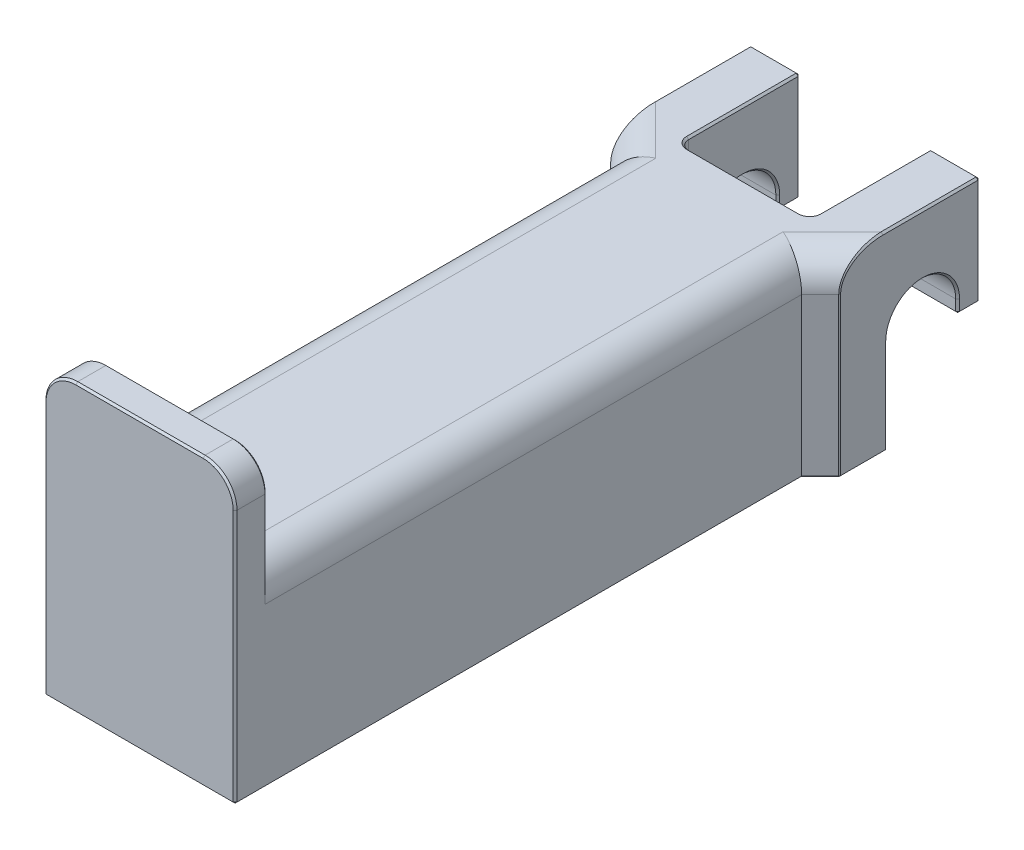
ISO-10303-21;
HEADER;
FILE_DESCRIPTION(('STEP AP214'),'2;1');
FILE_NAME('part.step','',(''),(''),'','','');
FILE_SCHEMA(('AUTOMOTIVE_DESIGN { 1 0 10303 214 1 1 1 1 }'));
ENDSEC;
DATA;
#1=APPLICATION_CONTEXT('core data for automotive mechanical design processes');
#2=APPLICATION_PROTOCOL_DEFINITION('international standard','automotive_design',2000,#1);
#3=PRODUCT_CONTEXT('',#1,'mechanical');
#4=PRODUCT('Part','Part','',(#3));
#5=PRODUCT_RELATED_PRODUCT_CATEGORY('part','',(#4));
#6=PRODUCT_DEFINITION_FORMATION('','',#4);
#7=PRODUCT_DEFINITION_CONTEXT('part definition',#1,'design');
#8=PRODUCT_DEFINITION('design','',#6,#7);
#9=PRODUCT_DEFINITION_SHAPE('','',#8);
#10=(LENGTH_UNIT() NAMED_UNIT(*) SI_UNIT(.MILLI.,.METRE.));
#11=(NAMED_UNIT(*) PLANE_ANGLE_UNIT() SI_UNIT($,.RADIAN.));
#12=(NAMED_UNIT(*) SI_UNIT($,.STERADIAN.) SOLID_ANGLE_UNIT());
#13=UNCERTAINTY_MEASURE_WITH_UNIT(LENGTH_MEASURE(1.E-05),#10,'distance_accuracy_value','');
#14=(GEOMETRIC_REPRESENTATION_CONTEXT(3) GLOBAL_UNCERTAINTY_ASSIGNED_CONTEXT((#13)) GLOBAL_UNIT_ASSIGNED_CONTEXT((#10,
#11,#12)) REPRESENTATION_CONTEXT('',''));
#15=CARTESIAN_POINT('',(0.,0.,0.));
#16=DIRECTION('',(0.,0.,1.));
#17=DIRECTION('',(1.,0.,0.));
#18=AXIS2_PLACEMENT_3D('',#15,#16,#17);
#19=CARTESIAN_POINT('',(15.,-15.,90.));
#20=DIRECTION('',(-1.,0.,0.));
#21=DIRECTION('',(0.,0.,1.));
#22=AXIS2_PLACEMENT_3D('',#19,#20,#21);
#23=PLANE('',#22);
#24=DIRECTION('',(0.,0.,-1.));
#25=VECTOR('',#24,1.);
#26=CARTESIAN_POINT('',(15.,25.,95.));
#27=LINE('',#26,#25);
#28=CARTESIAN_POINT('',(15.,25.,94.7));
#29=VERTEX_POINT('',#28);
#30=CARTESIAN_POINT('',(15.,25.,90.3));
#31=VERTEX_POINT('',#30);
#32=EDGE_CURVE('E1410',#29,#31,#27,.T.);
#33=ORIENTED_EDGE('',*,*,#32,.F.);
#34=DIRECTION('',(0.,-1.,0.));
#35=VECTOR('',#34,1.);
#36=CARTESIAN_POINT('',(15.,-15.,94.7));
#37=LINE('',#36,#35);
#38=CARTESIAN_POINT('',(15.,-14.7,94.7));
#39=VERTEX_POINT('',#38);
#40=EDGE_CURVE('E1865',#29,#39,#37,.T.);
#41=ORIENTED_EDGE('',*,*,#40,.T.);
#42=DIRECTION('',(0.,0.,-1.));
#43=VECTOR('',#42,1.);
#44=CARTESIAN_POINT('',(15.,-14.7,90.));
#45=LINE('',#44,#43);
#46=CARTESIAN_POINT('',(15.,-14.7,5.99999999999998));
#47=VERTEX_POINT('',#46);
#48=EDGE_CURVE('E1415',#39,#47,#45,.T.);
#49=ORIENTED_EDGE('',*,*,#48,.T.);
#50=DIRECTION('',(0.,1.,0.));
#51=VECTOR('',#50,1.);
#52=CARTESIAN_POINT('',(15.,15.,5.99999999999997));
#53=LINE('',#52,#51);
#54=CARTESIAN_POINT('',(15.,10.,5.99999999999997));
#55=VERTEX_POINT('',#54);
#56=EDGE_CURVE('E1443',#47,#55,#53,.T.);
#57=ORIENTED_EDGE('',*,*,#56,.T.);
#58=DIRECTION('',(0.,0.,-1.));
#59=VECTOR('',#58,1.);
#60=CARTESIAN_POINT('',(15.,10.,90.));
#61=LINE('',#60,#59);
#62=CARTESIAN_POINT('',(15.,10.,90.3));
#63=VERTEX_POINT('',#62);
#64=EDGE_CURVE('E1413',#55,#63,#61,.F.);
#65=ORIENTED_EDGE('',*,*,#64,.T.);
#66=DIRECTION('',(0.,1.,0.));
#67=VECTOR('',#66,1.);
#68=CARTESIAN_POINT('',(15.,25.,90.3));
#69=LINE('',#68,#67);
#70=EDGE_CURVE('E1398',#63,#31,#69,.T.);
#71=ORIENTED_EDGE('',*,*,#70,.T.);
#72=EDGE_LOOP('',(#33,#41,#49,#57,#65,#71));
#73=FACE_BOUND('',#72,.T.);
#74=ADVANCED_FACE('F45',(#73),#23,.F.);
#75=CARTESIAN_POINT('',(-15.,-15.,90.));
#76=DIRECTION('',(1.,0.,0.));
#77=DIRECTION('',(0.,0.,-1.));
#78=AXIS2_PLACEMENT_3D('',#75,#76,#77);
#79=PLANE('',#78);
#80=DIRECTION('',(0.,0.,1.));
#81=VECTOR('',#80,1.);
#82=CARTESIAN_POINT('',(-15.,-14.7,90.));
#83=LINE('',#82,#81);
#84=CARTESIAN_POINT('',(-15.,-14.7,5.99999999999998));
#85=VERTEX_POINT('',#84);
#86=CARTESIAN_POINT('',(-15.,-14.7,94.7));
#87=VERTEX_POINT('',#86);
#88=EDGE_CURVE('E2220',#85,#87,#83,.T.);
#89=ORIENTED_EDGE('',*,*,#88,.T.);
#90=DIRECTION('',(0.,1.,0.));
#91=VECTOR('',#90,1.);
#92=CARTESIAN_POINT('',(-15.,-15.,94.7));
#93=LINE('',#92,#91);
#94=CARTESIAN_POINT('',(-15.,25.,94.7));
#95=VERTEX_POINT('',#94);
#96=EDGE_CURVE('E2223',#87,#95,#93,.T.);
#97=ORIENTED_EDGE('',*,*,#96,.T.);
#98=DIRECTION('',(0.,0.,-1.));
#99=VECTOR('',#98,1.);
#100=CARTESIAN_POINT('',(-15.,25.,95.));
#101=LINE('',#100,#99);
#102=CARTESIAN_POINT('',(-15.,25.,90.3));
#103=VERTEX_POINT('',#102);
#104=EDGE_CURVE('E1825',#95,#103,#101,.T.);
#105=ORIENTED_EDGE('',*,*,#104,.T.);
#106=DIRECTION('',(0.,-1.,0.));
#107=VECTOR('',#106,1.);
#108=CARTESIAN_POINT('',(-15.,10.,90.3));
#109=LINE('',#108,#107);
#110=CARTESIAN_POINT('',(-15.,10.,90.3));
#111=VERTEX_POINT('',#110);
#112=EDGE_CURVE('E2217',#103,#111,#109,.T.);
#113=ORIENTED_EDGE('',*,*,#112,.T.);
#114=DIRECTION('',(0.,0.,-1.));
#115=VECTOR('',#114,1.);
#116=CARTESIAN_POINT('',(-15.,10.,90.));
#117=LINE('',#116,#115);
#118=CARTESIAN_POINT('',(-15.,10.,5.99999999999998));
#119=VERTEX_POINT('',#118);
#120=EDGE_CURVE('E473',#111,#119,#117,.T.);
#121=ORIENTED_EDGE('',*,*,#120,.T.);
#122=DIRECTION('',(0.,-1.,0.));
#123=VECTOR('',#122,1.);
#124=CARTESIAN_POINT('',(-15.,-15.,5.99999999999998));
#125=LINE('',#124,#123);
#126=EDGE_CURVE('E485',#119,#85,#125,.T.);
#127=ORIENTED_EDGE('',*,*,#126,.T.);
#128=EDGE_LOOP('',(#89,#97,#105,#113,#121,#127));
#129=FACE_BOUND('',#128,.T.);
#130=ADVANCED_FACE('F678',(#129),#79,.F.);
#131=CARTESIAN_POINT('',(0.,0.,0.));
#132=DIRECTION('',(0.,0.,-1.));
#133=DIRECTION('',(-1.,0.,0.));
#134=AXIS2_PLACEMENT_3D('',#131,#132,#133);
#135=PLANE('',#134);
#136=DIRECTION('',(0.,-1.,0.));
#137=VECTOR('',#136,1.);
#138=CARTESIAN_POINT('',(-8.75,0.,0.));
#139=LINE('',#138,#137);
#140=CARTESIAN_POINT('',(-8.75,-14.7,0.));
#141=VERTEX_POINT('',#140);
#142=CARTESIAN_POINT('',(-8.75,14.7,0.));
#143=VERTEX_POINT('',#142);
#144=EDGE_CURVE('E1494',#141,#143,#139,.F.);
#145=ORIENTED_EDGE('',*,*,#144,.T.);
#146=DIRECTION('',(1.,0.,0.));
#147=VECTOR('',#146,1.);
#148=CARTESIAN_POINT('',(8.75,14.7,0.));
#149=LINE('',#148,#147);
#150=CARTESIAN_POINT('',(8.75,14.7,0.));
#151=VERTEX_POINT('',#150);
#152=EDGE_CURVE('E605',#143,#151,#149,.T.);
#153=ORIENTED_EDGE('',*,*,#152,.T.);
#154=DIRECTION('',(0.,1.,0.));
#155=VECTOR('',#154,1.);
#156=CARTESIAN_POINT('',(8.75,0.,0.));
#157=LINE('',#156,#155);
#158=CARTESIAN_POINT('',(8.75,-14.7,0.));
#159=VERTEX_POINT('',#158);
#160=EDGE_CURVE('E1488',#151,#159,#157,.F.);
#161=ORIENTED_EDGE('',*,*,#160,.T.);
#162=DIRECTION('',(-1.,0.,0.));
#163=VECTOR('',#162,1.);
#164=CARTESIAN_POINT('',(-8.75,-14.7,0.));
#165=LINE('',#164,#163);
#166=EDGE_CURVE('E602',#159,#141,#165,.T.);
#167=ORIENTED_EDGE('',*,*,#166,.T.);
#168=EDGE_LOOP('',(#145,#153,#161,#167));
#169=FACE_BOUND('',#168,.T.);
#170=ADVANCED_FACE('F675',(#169),#135,.T.);
#171=CARTESIAN_POINT('',(-15.,15.,90.));
#172=DIRECTION('',(0.,-1.,0.));
#173=DIRECTION('',(0.,0.,-1.));
#174=AXIS2_PLACEMENT_3D('',#171,#172,#173);
#175=PLANE('',#174);
#176=DIRECTION('',(-0.70710678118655,0.,0.707106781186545));
#177=VECTOR('',#176,1.);
#178=CARTESIAN_POINT('',(-45.5355339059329,15.,59.4644660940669));
#179=LINE('',#178,#177);
#180=CARTESIAN_POINT('',(10.,15.,3.92893218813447));
#181=VERTEX_POINT('',#180);
#182=CARTESIAN_POINT('',(17.7,15.,-3.77106781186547));
#183=VERTEX_POINT('',#182);
#184=EDGE_CURVE('E494',#181,#183,#179,.F.);
#185=ORIENTED_EDGE('',*,*,#184,.T.);
#186=DIRECTION('',(0.,0.,-1.));
#187=VECTOR('',#186,1.);
#188=CARTESIAN_POINT('',(17.7,15.,-19.));
#189=LINE('',#188,#187);
#190=CARTESIAN_POINT('',(17.7,15.,-18.7));
#191=VERTEX_POINT('',#190);
#192=EDGE_CURVE('E542',#183,#191,#189,.T.);
#193=ORIENTED_EDGE('',*,*,#192,.T.);
#194=DIRECTION('',(-1.,0.,0.));
#195=VECTOR('',#194,1.);
#196=CARTESIAN_POINT('',(10.25,15.,-18.7));
#197=LINE('',#196,#195);
#198=CARTESIAN_POINT('',(10.55,15.,-18.7));
#199=VERTEX_POINT('',#198);
#200=EDGE_CURVE('E539',#191,#199,#197,.T.);
#201=ORIENTED_EDGE('',*,*,#200,.T.);
#202=DIRECTION('',(0.,0.,1.));
#203=VECTOR('',#202,1.);
#204=CARTESIAN_POINT('',(10.55,15.,90.));
#205=LINE('',#204,#203);
#206=CARTESIAN_POINT('',(10.55,15.,-1.5));
#207=VERTEX_POINT('',#206);
#208=EDGE_CURVE('E535',#199,#207,#205,.T.);
#209=ORIENTED_EDGE('',*,*,#208,.T.);
#210=CARTESIAN_POINT('',(8.75,15.,-1.5));
#211=DIRECTION('',(0.,-1.,0.));
#212=DIRECTION('',(0.,0.,-1.));
#213=AXIS2_PLACEMENT_3D('',#210,#211,#212);
#214=CIRCLE('',#213,1.79999999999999);
#215=CARTESIAN_POINT('',(8.75,15.,0.299999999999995));
#216=VERTEX_POINT('',#215);
#217=EDGE_CURVE('E532',#207,#216,#214,.T.);
#218=ORIENTED_EDGE('',*,*,#217,.T.);
#219=DIRECTION('',(-1.,0.,0.));
#220=VECTOR('',#219,1.);
#221=CARTESIAN_POINT('',(-8.75,15.,0.299999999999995));
#222=LINE('',#221,#220);
#223=CARTESIAN_POINT('',(-8.75,15.,0.299999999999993));
#224=VERTEX_POINT('',#223);
#225=EDGE_CURVE('E529',#216,#224,#222,.T.);
#226=ORIENTED_EDGE('',*,*,#225,.T.);
#227=CARTESIAN_POINT('',(-8.75,15.,-1.5));
#228=DIRECTION('',(0.,-1.,0.));
#229=DIRECTION('',(0.,0.,-1.));
#230=AXIS2_PLACEMENT_3D('',#227,#228,#229);
#231=CIRCLE('',#230,1.79999999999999);
#232=CARTESIAN_POINT('',(-10.55,15.,-1.5));
#233=VERTEX_POINT('',#232);
#234=EDGE_CURVE('E526',#224,#233,#231,.T.);
#235=ORIENTED_EDGE('',*,*,#234,.T.);
#236=DIRECTION('',(0.,0.,-1.));
#237=VECTOR('',#236,1.);
#238=CARTESIAN_POINT('',(-10.55,15.,90.));
#239=LINE('',#238,#237);
#240=CARTESIAN_POINT('',(-10.55,15.,-18.7));
#241=VERTEX_POINT('',#240);
#242=EDGE_CURVE('E521',#233,#241,#239,.T.);
#243=ORIENTED_EDGE('',*,*,#242,.T.);
#244=DIRECTION('',(-1.,0.,0.));
#245=VECTOR('',#244,1.);
#246=CARTESIAN_POINT('',(-18.,15.,-18.7));
#247=LINE('',#246,#245);
#248=CARTESIAN_POINT('',(-17.6999999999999,15.,-18.7));
#249=VERTEX_POINT('',#248);
#250=EDGE_CURVE('E515',#241,#249,#247,.T.);
#251=ORIENTED_EDGE('',*,*,#250,.T.);
#252=DIRECTION('',(0.,0.,1.));
#253=VECTOR('',#252,1.);
#254=CARTESIAN_POINT('',(-17.6999999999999,15.,-4.07106781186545));
#255=LINE('',#254,#253);
#256=CARTESIAN_POINT('',(-17.7,15.,-3.7710678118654));
#257=VERTEX_POINT('',#256);
#258=EDGE_CURVE('E518',#249,#257,#255,.T.);
#259=ORIENTED_EDGE('',*,*,#258,.T.);
#260=DIRECTION('',(-0.70710678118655,0.,-0.707106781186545));
#261=VECTOR('',#260,1.);
#262=CARTESIAN_POINT('',(30.5355339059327,15.,44.4644660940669));
#263=LINE('',#262,#261);
#264=CARTESIAN_POINT('',(-10.,15.,3.9289321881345));
#265=VERTEX_POINT('',#264);
#266=EDGE_CURVE('E495',#257,#265,#263,.F.);
#267=ORIENTED_EDGE('',*,*,#266,.T.);
#268=DIRECTION('',(0.,0.,-1.));
#269=VECTOR('',#268,1.);
#270=CARTESIAN_POINT('',(-10.,15.,90.));
#271=LINE('',#270,#269);
#272=CARTESIAN_POINT('',(-10.,15.,90.));
#273=VERTEX_POINT('',#272);
#274=EDGE_CURVE('E482',#265,#273,#271,.F.);
#275=ORIENTED_EDGE('',*,*,#274,.T.);
#276=DIRECTION('',(-1.,0.,0.));
#277=VECTOR('',#276,1.);
#278=CARTESIAN_POINT('',(-15.,15.,90.));
#279=LINE('',#278,#277);
#280=CARTESIAN_POINT('',(10.,15.,90.));
#281=VERTEX_POINT('',#280);
#282=EDGE_CURVE('E466',#281,#273,#279,.T.);
#283=ORIENTED_EDGE('',*,*,#282,.F.);
#284=DIRECTION('',(0.,0.,-1.));
#285=VECTOR('',#284,1.);
#286=CARTESIAN_POINT('',(10.,15.,90.));
#287=LINE('',#286,#285);
#288=EDGE_CURVE('E479',#281,#181,#287,.T.);
#289=ORIENTED_EDGE('',*,*,#288,.T.);
#290=EDGE_LOOP('',(#185,#193,#201,#209,#218,#226,#235,#243,#251,#259,#267,#275,#283,#289));
#291=FACE_BOUND('',#290,.T.);
#292=ADVANCED_FACE('F478',(#291),#175,.F.);
#293=CARTESIAN_POINT('',(-15.,-15.,90.));
#294=DIRECTION('',(0.,1.,0.));
#295=DIRECTION('',(0.,0.,1.));
#296=AXIS2_PLACEMENT_3D('',#293,#294,#295);
#297=PLANE('',#296);
#298=DIRECTION('',(0.,0.,1.));
#299=VECTOR('',#298,1.);
#300=CARTESIAN_POINT('',(14.7,-15.,90.));
#301=LINE('',#300,#299);
#302=CARTESIAN_POINT('',(14.7,-15.,5.87573593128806));
#303=VERTEX_POINT('',#302);
#304=CARTESIAN_POINT('',(14.7,-15.,94.7));
#305=VERTEX_POINT('',#304);
#306=EDGE_CURVE('E1904',#303,#305,#301,.T.);
#307=ORIENTED_EDGE('',*,*,#306,.T.);
#308=DIRECTION('',(-1.,0.,0.));
#309=VECTOR('',#308,1.);
#310=CARTESIAN_POINT('',(-15.,-15.,94.7));
#311=LINE('',#310,#309);
#312=CARTESIAN_POINT('',(-14.7,-15.,94.7));
#313=VERTEX_POINT('',#312);
#314=EDGE_CURVE('E1907',#305,#313,#311,.T.);
#315=ORIENTED_EDGE('',*,*,#314,.T.);
#316=DIRECTION('',(0.,0.,-1.));
#317=VECTOR('',#316,1.);
#318=CARTESIAN_POINT('',(-14.7,-15.,90.));
#319=LINE('',#318,#317);
#320=CARTESIAN_POINT('',(-14.7,-15.,5.87573593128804));
#321=VERTEX_POINT('',#320);
#322=EDGE_CURVE('E1895',#313,#321,#319,.T.);
#323=ORIENTED_EDGE('',*,*,#322,.T.);
#324=DIRECTION('',(-0.70710678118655,0.,-0.707106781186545));
#325=VECTOR('',#324,1.);
#326=CARTESIAN_POINT('',(27.212132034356,-15.,47.7878679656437));
#327=LINE('',#326,#325);
#328=CARTESIAN_POINT('',(-17.7,-15.,2.87573593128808));
#329=VERTEX_POINT('',#328);
#330=EDGE_CURVE('E1892',#321,#329,#327,.T.);
#331=ORIENTED_EDGE('',*,*,#330,.T.);
#332=DIRECTION('',(0.,0.,-1.));
#333=VECTOR('',#332,1.);
#334=CARTESIAN_POINT('',(-17.7,-15.,-4.5));
#335=LINE('',#334,#333);
#336=CARTESIAN_POINT('',(-17.7,-15.,-4.2));
#337=VERTEX_POINT('',#336);
#338=EDGE_CURVE('E1889',#329,#337,#335,.T.);
#339=ORIENTED_EDGE('',*,*,#338,.T.);
#340=DIRECTION('',(1.,0.,0.));
#341=VECTOR('',#340,1.);
#342=CARTESIAN_POINT('',(-15.,-15.,-4.2));
#343=LINE('',#342,#341);
#344=CARTESIAN_POINT('',(-10.55,-15.,-4.2));
#345=VERTEX_POINT('',#344);
#346=EDGE_CURVE('E1886',#337,#345,#343,.T.);
#347=ORIENTED_EDGE('',*,*,#346,.T.);
#348=DIRECTION('',(0.,0.,1.));
#349=VECTOR('',#348,1.);
#350=CARTESIAN_POINT('',(-10.55,-15.,90.));
#351=LINE('',#350,#349);
#352=CARTESIAN_POINT('',(-10.55,-15.,-1.5));
#353=VERTEX_POINT('',#352);
#354=EDGE_CURVE('E1883',#345,#353,#351,.T.);
#355=ORIENTED_EDGE('',*,*,#354,.T.);
#356=CARTESIAN_POINT('',(-8.75,-15.,-1.5));
#357=DIRECTION('',(0.,1.,0.));
#358=DIRECTION('',(0.,0.,1.));
#359=AXIS2_PLACEMENT_3D('',#356,#357,#358);
#360=CIRCLE('',#359,1.79999999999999);
#361=CARTESIAN_POINT('',(-8.75,-15.,0.299999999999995));
#362=VERTEX_POINT('',#361);
#363=EDGE_CURVE('E1880',#353,#362,#360,.T.);
#364=ORIENTED_EDGE('',*,*,#363,.T.);
#365=DIRECTION('',(1.,0.,0.));
#366=VECTOR('',#365,1.);
#367=CARTESIAN_POINT('',(8.75,-15.,0.299999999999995));
#368=LINE('',#367,#366);
#369=CARTESIAN_POINT('',(8.75,-15.,0.299999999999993));
#370=VERTEX_POINT('',#369);
#371=EDGE_CURVE('E1877',#362,#370,#368,.T.);
#372=ORIENTED_EDGE('',*,*,#371,.T.);
#373=CARTESIAN_POINT('',(8.75,-15.,-1.5));
#374=DIRECTION('',(0.,1.,0.));
#375=DIRECTION('',(0.,0.,1.));
#376=AXIS2_PLACEMENT_3D('',#373,#374,#375);
#377=CIRCLE('',#376,1.79999999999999);
#378=CARTESIAN_POINT('',(10.55,-15.,-1.5));
#379=VERTEX_POINT('',#378);
#380=EDGE_CURVE('E1874',#370,#379,#377,.T.);
#381=ORIENTED_EDGE('',*,*,#380,.T.);
#382=DIRECTION('',(0.,0.,-1.));
#383=VECTOR('',#382,1.);
#384=CARTESIAN_POINT('',(10.55,-15.,90.));
#385=LINE('',#384,#383);
#386=CARTESIAN_POINT('',(10.55,-15.,-4.20000000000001));
#387=VERTEX_POINT('',#386);
#388=EDGE_CURVE('E1871',#379,#387,#385,.T.);
#389=ORIENTED_EDGE('',*,*,#388,.T.);
#390=DIRECTION('',(1.,0.,0.));
#391=VECTOR('',#390,1.);
#392=CARTESIAN_POINT('',(-15.,-15.,-4.20000000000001));
#393=LINE('',#392,#391);
#394=CARTESIAN_POINT('',(17.7,-15.,-4.20000000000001));
#395=VERTEX_POINT('',#394);
#396=EDGE_CURVE('E1868',#387,#395,#393,.T.);
#397=ORIENTED_EDGE('',*,*,#396,.T.);
#398=DIRECTION('',(0.,0.,1.));
#399=VECTOR('',#398,1.);
#400=CARTESIAN_POINT('',(17.7,-15.,3.));
#401=LINE('',#400,#399);
#402=CARTESIAN_POINT('',(17.7,-15.,2.87573593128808));
#403=VERTEX_POINT('',#402);
#404=EDGE_CURVE('E1898',#395,#403,#401,.T.);
#405=ORIENTED_EDGE('',*,*,#404,.T.);
#406=DIRECTION('',(-0.70710678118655,0.,0.707106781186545));
#407=VECTOR('',#406,1.);
#408=CARTESIAN_POINT('',(-42.2121320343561,-15.,62.7878679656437));
#409=LINE('',#408,#407);
#410=EDGE_CURVE('E1901',#403,#303,#409,.T.);
#411=ORIENTED_EDGE('',*,*,#410,.T.);
#412=EDGE_LOOP('',(#307,#315,#323,#331,#339,#347,#355,#364,#372,#381,#389,#397,#405,#411));
#413=FACE_BOUND('',#412,.T.);
#414=ADVANCED_FACE('F673',(#413),#297,.F.);
#415=CARTESIAN_POINT('',(10.25,15.,-19.));
#416=DIRECTION('',(1.,0.,0.));
#417=DIRECTION('',(0.,0.,-1.));
#418=AXIS2_PLACEMENT_3D('',#415,#416,#417);
#419=PLANE('',#418);
#420=DIRECTION('',(0.,-1.,0.));
#421=VECTOR('',#420,1.);
#422=CARTESIAN_POINT('',(10.25,15.,-4.20000000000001));
#423=LINE('',#422,#421);
#424=CARTESIAN_POINT('',(10.25,0.,-4.20000000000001));
#425=VERTEX_POINT('',#424);
#426=CARTESIAN_POINT('',(10.25,-14.7,-4.20000000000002));
#427=VERTEX_POINT('',#426);
#428=EDGE_CURVE('E563',#425,#427,#423,.T.);
#429=ORIENTED_EDGE('',*,*,#428,.T.);
#430=DIRECTION('',(0.,0.,1.));
#431=VECTOR('',#430,1.);
#432=CARTESIAN_POINT('',(10.25,-14.7,-19.));
#433=LINE('',#432,#431);
#434=CARTESIAN_POINT('',(10.25,-14.7,-1.5));
#435=VERTEX_POINT('',#434);
#436=EDGE_CURVE('E566',#427,#435,#433,.T.);
#437=ORIENTED_EDGE('',*,*,#436,.T.);
#438=DIRECTION('',(0.,1.,0.));
#439=VECTOR('',#438,1.);
#440=CARTESIAN_POINT('',(10.25,15.,-1.5));
#441=LINE('',#440,#439);
#442=CARTESIAN_POINT('',(10.25,14.7,-1.5));
#443=VERTEX_POINT('',#442);
#444=EDGE_CURVE('E1498',#435,#443,#441,.T.);
#445=ORIENTED_EDGE('',*,*,#444,.T.);
#446=DIRECTION('',(0.,0.,-1.));
#447=VECTOR('',#446,1.);
#448=CARTESIAN_POINT('',(10.25,14.7,-19.));
#449=LINE('',#448,#447);
#450=CARTESIAN_POINT('',(10.25,14.7,-18.6999999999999));
#451=VERTEX_POINT('',#450);
#452=EDGE_CURVE('E556',#443,#451,#449,.T.);
#453=ORIENTED_EDGE('',*,*,#452,.T.);
#454=DIRECTION('',(0.,-1.,0.));
#455=VECTOR('',#454,1.);
#456=CARTESIAN_POINT('',(10.25,-2.,-18.6999999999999));
#457=LINE('',#456,#455);
#458=CARTESIAN_POINT('',(10.25,-1.69999999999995,-18.6999999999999));
#459=VERTEX_POINT('',#458);
#460=EDGE_CURVE('E545',#451,#459,#457,.T.);
#461=ORIENTED_EDGE('',*,*,#460,.T.);
#462=DIRECTION('',(0.,0.,1.));
#463=VECTOR('',#462,1.);
#464=CARTESIAN_POINT('',(10.25,-1.69999999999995,-19.));
#465=LINE('',#464,#463);
#466=CARTESIAN_POINT('',(10.25,-1.69999999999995,-15.8));
#467=VERTEX_POINT('',#466);
#468=EDGE_CURVE('E550',#459,#467,#465,.T.);
#469=ORIENTED_EDGE('',*,*,#468,.T.);
#470=DIRECTION('',(0.,1.,0.));
#471=VECTOR('',#470,1.);
#472=CARTESIAN_POINT('',(10.25,15.,-15.8));
#473=LINE('',#472,#471);
#474=CARTESIAN_POINT('',(10.25,0.,-15.8));
#475=VERTEX_POINT('',#474);
#476=EDGE_CURVE('E553',#467,#475,#473,.T.);
#477=ORIENTED_EDGE('',*,*,#476,.T.);
#478=CARTESIAN_POINT('',(10.25,0.,-10.));
#479=DIRECTION('',(1.,0.,0.));
#480=DIRECTION('',(0.,0.,-1.));
#481=AXIS2_PLACEMENT_3D('',#478,#479,#480);
#482=CIRCLE('',#481,5.79999999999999);
#483=EDGE_CURVE('E560',#475,#425,#482,.T.);
#484=ORIENTED_EDGE('',*,*,#483,.T.);
#485=EDGE_LOOP('',(#429,#437,#445,#453,#461,#469,#477,#484));
#486=FACE_BOUND('',#485,.T.);
#487=ADVANCED_FACE('F669',(#486),#419,.F.);
#488=CARTESIAN_POINT('',(0.,0.,-19.));
#489=DIRECTION('',(0.,0.,-1.));
#490=DIRECTION('',(-1.,0.,0.));
#491=AXIS2_PLACEMENT_3D('',#488,#489,#490);
#492=PLANE('',#491);
#493=DIRECTION('',(0.,-1.,0.));
#494=VECTOR('',#493,1.);
#495=CARTESIAN_POINT('',(17.7,0.,-19.));
#496=LINE('',#495,#494);
#497=CARTESIAN_POINT('',(17.7,14.7,-19.));
#498=VERTEX_POINT('',#497);
#499=CARTESIAN_POINT('',(17.7,-1.69999999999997,-19.));
#500=VERTEX_POINT('',#499);
#501=EDGE_CURVE('E744',#498,#500,#496,.T.);
#502=ORIENTED_EDGE('',*,*,#501,.T.);
#503=DIRECTION('',(-1.,0.,0.));
#504=VECTOR('',#503,1.);
#505=CARTESIAN_POINT('',(10.25,-1.69999999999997,-19.));
#506=LINE('',#505,#504);
#507=CARTESIAN_POINT('',(10.55,-1.69999999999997,-19.));
#508=VERTEX_POINT('',#507);
#509=EDGE_CURVE('E747',#500,#508,#506,.T.);
#510=ORIENTED_EDGE('',*,*,#509,.T.);
#511=DIRECTION('',(0.,1.,0.));
#512=VECTOR('',#511,1.);
#513=CARTESIAN_POINT('',(10.55,15.,-19.));
#514=LINE('',#513,#512);
#515=CARTESIAN_POINT('',(10.55,14.7,-19.));
#516=VERTEX_POINT('',#515);
#517=EDGE_CURVE('E738',#508,#516,#514,.T.);
#518=ORIENTED_EDGE('',*,*,#517,.T.);
#519=DIRECTION('',(1.,0.,0.));
#520=VECTOR('',#519,1.);
#521=CARTESIAN_POINT('',(18.,14.7,-19.));
#522=LINE('',#521,#520);
#523=EDGE_CURVE('E741',#516,#498,#522,.T.);
#524=ORIENTED_EDGE('',*,*,#523,.T.);
#525=EDGE_LOOP('',(#502,#510,#518,#524));
#526=FACE_BOUND('',#525,.T.);
#527=ADVANCED_FACE('F665',(#526),#492,.T.);
#528=CARTESIAN_POINT('',(-10.25,-15.,-19.));
#529=DIRECTION('',(-1.,0.,0.));
#530=DIRECTION('',(0.,-1.,0.));
#531=AXIS2_PLACEMENT_3D('',#528,#529,#530);
#532=PLANE('',#531);
#533=DIRECTION('',(0.,-1.,0.));
#534=VECTOR('',#533,1.);
#535=CARTESIAN_POINT('',(-10.25,-15.,-1.5));
#536=LINE('',#535,#534);
#537=CARTESIAN_POINT('',(-10.25,14.7,-1.5));
#538=VERTEX_POINT('',#537);
#539=CARTESIAN_POINT('',(-10.25,-14.7,-1.5));
#540=VERTEX_POINT('',#539);
#541=EDGE_CURVE('E512',#538,#540,#536,.T.);
#542=ORIENTED_EDGE('',*,*,#541,.T.);
#543=DIRECTION('',(0.,0.,-1.));
#544=VECTOR('',#543,1.);
#545=CARTESIAN_POINT('',(-10.25,-14.7,-19.));
#546=LINE('',#545,#544);
#547=CARTESIAN_POINT('',(-10.25,-14.7,-4.19999999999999));
#548=VERTEX_POINT('',#547);
#549=EDGE_CURVE('E587',#540,#548,#546,.T.);
#550=ORIENTED_EDGE('',*,*,#549,.T.);
#551=DIRECTION('',(0.,1.,0.));
#552=VECTOR('',#551,1.);
#553=CARTESIAN_POINT('',(-10.25,-15.,-4.19999999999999));
#554=LINE('',#553,#552);
#555=CARTESIAN_POINT('',(-10.25,0.,-4.19999999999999));
#556=VERTEX_POINT('',#555);
#557=EDGE_CURVE('E584',#548,#556,#554,.T.);
#558=ORIENTED_EDGE('',*,*,#557,.T.);
#559=CARTESIAN_POINT('',(-10.25,0.,-10.));
#560=DIRECTION('',(-1.,0.,0.));
#561=DIRECTION('',(0.,-1.,0.));
#562=AXIS2_PLACEMENT_3D('',#559,#560,#561);
#563=CIRCLE('',#562,5.80000000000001);
#564=CARTESIAN_POINT('',(-10.25,0.,-15.8));
#565=VERTEX_POINT('',#564);
#566=EDGE_CURVE('E581',#556,#565,#563,.T.);
#567=ORIENTED_EDGE('',*,*,#566,.T.);
#568=DIRECTION('',(0.,-1.,0.));
#569=VECTOR('',#568,1.);
#570=CARTESIAN_POINT('',(-10.25,-15.,-15.8));
#571=LINE('',#570,#569);
#572=CARTESIAN_POINT('',(-10.25,-1.69999999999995,-15.8));
#573=VERTEX_POINT('',#572);
#574=EDGE_CURVE('E575',#565,#573,#571,.T.);
#575=ORIENTED_EDGE('',*,*,#574,.T.);
#576=DIRECTION('',(0.,0.,-1.));
#577=VECTOR('',#576,1.);
#578=CARTESIAN_POINT('',(-10.25,-1.69999999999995,-19.));
#579=LINE('',#578,#577);
#580=CARTESIAN_POINT('',(-10.25,-1.69999999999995,-18.6999999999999));
#581=VERTEX_POINT('',#580);
#582=EDGE_CURVE('E572',#573,#581,#579,.T.);
#583=ORIENTED_EDGE('',*,*,#582,.T.);
#584=DIRECTION('',(0.,1.,0.));
#585=VECTOR('',#584,1.);
#586=CARTESIAN_POINT('',(-10.25,15.,-18.6999999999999));
#587=LINE('',#586,#585);
#588=CARTESIAN_POINT('',(-10.25,14.7,-18.6999999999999));
#589=VERTEX_POINT('',#588);
#590=EDGE_CURVE('E569',#581,#589,#587,.T.);
#591=ORIENTED_EDGE('',*,*,#590,.T.);
#592=DIRECTION('',(0.,0.,1.));
#593=VECTOR('',#592,1.);
#594=CARTESIAN_POINT('',(-10.25,14.7,-19.));
#595=LINE('',#594,#593);
#596=EDGE_CURVE('E578',#589,#538,#595,.T.);
#597=ORIENTED_EDGE('',*,*,#596,.T.);
#598=EDGE_LOOP('',(#542,#550,#558,#567,#575,#583,#591,#597));
#599=FACE_BOUND('',#598,.T.);
#600=ADVANCED_FACE('F661',(#599),#532,.F.);
#601=CARTESIAN_POINT('',(0.,0.,-19.));
#602=DIRECTION('',(0.,0.,-1.));
#603=DIRECTION('',(-1.,0.,0.));
#604=AXIS2_PLACEMENT_3D('',#601,#602,#603);
#605=PLANE('',#604);
#606=DIRECTION('',(0.,-1.,0.));
#607=VECTOR('',#606,1.);
#608=CARTESIAN_POINT('',(-10.55,-2.,-19.));
#609=LINE('',#608,#607);
#610=CARTESIAN_POINT('',(-10.55,14.7,-19.));
#611=VERTEX_POINT('',#610);
#612=CARTESIAN_POINT('',(-10.55,-1.69999999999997,-19.));
#613=VERTEX_POINT('',#612);
#614=EDGE_CURVE('E1987',#611,#613,#609,.T.);
#615=ORIENTED_EDGE('',*,*,#614,.T.);
#616=DIRECTION('',(-1.,0.,0.));
#617=VECTOR('',#616,1.);
#618=CARTESIAN_POINT('',(-18.,-1.69999999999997,-19.));
#619=LINE('',#618,#617);
#620=CARTESIAN_POINT('',(-17.7,-1.69999999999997,-19.));
#621=VERTEX_POINT('',#620);
#622=EDGE_CURVE('E2327',#613,#621,#619,.T.);
#623=ORIENTED_EDGE('',*,*,#622,.T.);
#624=DIRECTION('',(0.,1.,0.));
#625=VECTOR('',#624,1.);
#626=CARTESIAN_POINT('',(-17.7,0.,-19.));
#627=LINE('',#626,#625);
#628=CARTESIAN_POINT('',(-17.7,14.7,-19.));
#629=VERTEX_POINT('',#628);
#630=EDGE_CURVE('E2332',#621,#629,#627,.T.);
#631=ORIENTED_EDGE('',*,*,#630,.T.);
#632=DIRECTION('',(1.,0.,0.));
#633=VECTOR('',#632,1.);
#634=CARTESIAN_POINT('',(-10.25,14.7,-19.));
#635=LINE('',#634,#633);
#636=EDGE_CURVE('E2336',#629,#611,#635,.T.);
#637=ORIENTED_EDGE('',*,*,#636,.T.);
#638=EDGE_LOOP('',(#615,#623,#631,#637));
#639=FACE_BOUND('',#638,.T.);
#640=ADVANCED_FACE('F658',(#639),#605,.T.);
#641=CARTESIAN_POINT('',(15.,0.,-4.5));
#642=DIRECTION('',(0.,0.,1.));
#643=DIRECTION('',(0.,-1.,0.));
#644=AXIS2_PLACEMENT_3D('',#641,#642,#643);
#645=PLANE('',#644);
#646=DIRECTION('',(-1.,0.,0.));
#647=VECTOR('',#646,1.);
#648=CARTESIAN_POINT('',(15.,-14.7,-4.5));
#649=LINE('',#648,#647);
#650=CARTESIAN_POINT('',(-10.55,-14.7,-4.5));
#651=VERTEX_POINT('',#650);
#652=CARTESIAN_POINT('',(-17.7,-14.7,-4.5));
#653=VERTEX_POINT('',#652);
#654=EDGE_CURVE('E2092',#651,#653,#649,.T.);
#655=ORIENTED_EDGE('',*,*,#654,.T.);
#656=DIRECTION('',(0.,1.,0.));
#657=VECTOR('',#656,1.);
#658=CARTESIAN_POINT('',(-17.7,0.,-4.5));
#659=LINE('',#658,#657);
#660=CARTESIAN_POINT('',(-17.7,0.,-4.5));
#661=VERTEX_POINT('',#660);
#662=EDGE_CURVE('E2089',#653,#661,#659,.T.);
#663=ORIENTED_EDGE('',*,*,#662,.T.);
#664=DIRECTION('',(-1.,0.,0.));
#665=VECTOR('',#664,1.);
#666=CARTESIAN_POINT('',(15.,0.,-4.5));
#667=LINE('',#666,#665);
#668=CARTESIAN_POINT('',(-10.55,0.,-4.5));
#669=VERTEX_POINT('',#668);
#670=EDGE_CURVE('E1438',#669,#661,#667,.T.);
#671=ORIENTED_EDGE('',*,*,#670,.F.);
#672=DIRECTION('',(0.,-1.,0.));
#673=VECTOR('',#672,1.);
#674=CARTESIAN_POINT('',(-10.55,0.,-4.5));
#675=LINE('',#674,#673);
#676=EDGE_CURVE('E2095',#669,#651,#675,.T.);
#677=ORIENTED_EDGE('',*,*,#676,.T.);
#678=EDGE_LOOP('',(#655,#663,#671,#677));
#679=FACE_BOUND('',#678,.T.);
#680=ADVANCED_FACE('F657',(#679),#645,.F.);
#681=CARTESIAN_POINT('',(15.,0.,-10.));
#682=DIRECTION('',(-1.,0.,0.));
#683=DIRECTION('',(0.,0.,1.));
#684=AXIS2_PLACEMENT_3D('',#681,#682,#683);
#685=CYLINDRICAL_SURFACE('',#684,5.5);
#686=ORIENTED_EDGE('',*,*,#670,.T.);
#687=CARTESIAN_POINT('',(-17.7,0.,-10.));
#688=DIRECTION('',(-1.,0.,0.));
#689=DIRECTION('',(0.,0.,1.));
#690=AXIS2_PLACEMENT_3D('',#687,#688,#689);
#691=CIRCLE('',#690,5.5);
#692=CARTESIAN_POINT('',(-17.7,0.,-15.5));
#693=VERTEX_POINT('',#692);
#694=EDGE_CURVE('E2191',#661,#693,#691,.T.);
#695=ORIENTED_EDGE('',*,*,#694,.T.);
#696=DIRECTION('',(-1.,0.,0.));
#697=VECTOR('',#696,1.);
#698=CARTESIAN_POINT('',(15.,0.,-15.5));
#699=LINE('',#698,#697);
#700=CARTESIAN_POINT('',(-10.55,0.,-15.5));
#701=VERTEX_POINT('',#700);
#702=EDGE_CURVE('E1434',#701,#693,#699,.T.);
#703=ORIENTED_EDGE('',*,*,#702,.F.);
#704=CARTESIAN_POINT('',(-10.55,0.,-10.));
#705=DIRECTION('',(-1.,0.,0.));
#706=DIRECTION('',(0.,0.,1.));
#707=AXIS2_PLACEMENT_3D('',#704,#705,#706);
#708=CIRCLE('',#707,5.5);
#709=EDGE_CURVE('E1967',#701,#669,#708,.F.);
#710=ORIENTED_EDGE('',*,*,#709,.T.);
#711=EDGE_LOOP('',(#686,#695,#703,#710));
#712=FACE_BOUND('',#711,.T.);
#713=ADVANCED_FACE('F653',(#712),#685,.F.);
#714=CARTESIAN_POINT('',(15.,-15.,-15.5));
#715=DIRECTION('',(0.,0.,-1.));
#716=DIRECTION('',(0.,1.,0.));
#717=AXIS2_PLACEMENT_3D('',#714,#715,#716);
#718=PLANE('',#717);
#719=ORIENTED_EDGE('',*,*,#702,.T.);
#720=DIRECTION('',(0.,-1.,0.));
#721=VECTOR('',#720,1.);
#722=CARTESIAN_POINT('',(-17.7,-2.,-15.5));
#723=LINE('',#722,#721);
#724=CARTESIAN_POINT('',(-17.7,-1.69999999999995,-15.5));
#725=VERTEX_POINT('',#724);
#726=EDGE_CURVE('E2140',#693,#725,#723,.T.);
#727=ORIENTED_EDGE('',*,*,#726,.T.);
#728=DIRECTION('',(1.,0.,0.));
#729=VECTOR('',#728,1.);
#730=CARTESIAN_POINT('',(15.,-1.69999999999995,-15.5));
#731=LINE('',#730,#729);
#732=CARTESIAN_POINT('',(-10.55,-1.69999999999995,-15.5));
#733=VERTEX_POINT('',#732);
#734=EDGE_CURVE('E2135',#725,#733,#731,.T.);
#735=ORIENTED_EDGE('',*,*,#734,.T.);
#736=DIRECTION('',(0.,1.,0.));
#737=VECTOR('',#736,1.);
#738=CARTESIAN_POINT('',(-10.55,-15.,-15.5));
#739=LINE('',#738,#737);
#740=EDGE_CURVE('E1972',#733,#701,#739,.T.);
#741=ORIENTED_EDGE('',*,*,#740,.T.);
#742=EDGE_LOOP('',(#719,#727,#735,#741));
#743=FACE_BOUND('',#742,.T.);
#744=ADVANCED_FACE('F648',(#743),#718,.F.);
#745=DIRECTION('',(1.,0.,0.));
#746=VECTOR('',#745,1.);
#747=CARTESIAN_POINT('',(15.,-1.69999999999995,-15.5));
#748=LINE('',#747,#746);
#749=CARTESIAN_POINT('',(10.55,-1.69999999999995,-15.5));
#750=VERTEX_POINT('',#749);
#751=CARTESIAN_POINT('',(17.7,-1.69999999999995,-15.5));
#752=VERTEX_POINT('',#751);
#753=EDGE_CURVE('E2035',#750,#752,#748,.T.);
#754=ORIENTED_EDGE('',*,*,#753,.T.);
#755=DIRECTION('',(0.,1.,0.));
#756=VECTOR('',#755,1.);
#757=CARTESIAN_POINT('',(17.7,0.,-15.5));
#758=LINE('',#757,#756);
#759=CARTESIAN_POINT('',(17.7,0.,-15.5));
#760=VERTEX_POINT('',#759);
#761=EDGE_CURVE('E2185',#752,#760,#758,.T.);
#762=ORIENTED_EDGE('',*,*,#761,.T.);
#763=CARTESIAN_POINT('',(10.55,0.,-15.5));
#764=VERTEX_POINT('',#763);
#765=EDGE_CURVE('E486',#760,#764,#699,.T.);
#766=ORIENTED_EDGE('',*,*,#765,.T.);
#767=DIRECTION('',(0.,-1.,0.));
#768=VECTOR('',#767,1.);
#769=CARTESIAN_POINT('',(10.55,-15.,-15.5));
#770=LINE('',#769,#768);
#771=EDGE_CURVE('E2040',#764,#750,#770,.T.);
#772=ORIENTED_EDGE('',*,*,#771,.T.);
#773=EDGE_LOOP('',(#754,#762,#766,#772));
#774=FACE_BOUND('',#773,.T.);
#775=ADVANCED_FACE('F644',(#774),#718,.F.);
#776=ORIENTED_EDGE('',*,*,#765,.F.);
#777=CARTESIAN_POINT('',(17.7,0.,-10.));
#778=DIRECTION('',(1.,0.,0.));
#779=DIRECTION('',(0.,0.,-1.));
#780=AXIS2_PLACEMENT_3D('',#777,#778,#779);
#781=CIRCLE('',#780,5.5);
#782=CARTESIAN_POINT('',(17.7,0.,-4.5));
#783=VERTEX_POINT('',#782);
#784=EDGE_CURVE('E2196',#760,#783,#781,.T.);
#785=ORIENTED_EDGE('',*,*,#784,.T.);
#786=CARTESIAN_POINT('',(10.55,0.,-4.5));
#787=VERTEX_POINT('',#786);
#788=EDGE_CURVE('E1435',#783,#787,#667,.T.);
#789=ORIENTED_EDGE('',*,*,#788,.T.);
#790=CARTESIAN_POINT('',(10.55,0.,-10.));
#791=DIRECTION('',(1.,0.,0.));
#792=DIRECTION('',(0.,0.,-1.));
#793=AXIS2_PLACEMENT_3D('',#790,#791,#792);
#794=CIRCLE('',#793,5.5);
#795=EDGE_CURVE('E2046',#787,#764,#794,.F.);
#796=ORIENTED_EDGE('',*,*,#795,.T.);
#797=EDGE_LOOP('',(#776,#785,#789,#796));
#798=FACE_BOUND('',#797,.T.);
#799=ADVANCED_FACE('F647',(#798),#685,.F.);
#800=ORIENTED_EDGE('',*,*,#788,.F.);
#801=DIRECTION('',(0.,-1.,0.));
#802=VECTOR('',#801,1.);
#803=CARTESIAN_POINT('',(17.7,-15.,-4.5));
#804=LINE('',#803,#802);
#805=CARTESIAN_POINT('',(17.7,-14.7,-4.5));
#806=VERTEX_POINT('',#805);
#807=EDGE_CURVE('E2077',#783,#806,#804,.T.);
#808=ORIENTED_EDGE('',*,*,#807,.T.);
#809=DIRECTION('',(-1.,0.,0.));
#810=VECTOR('',#809,1.);
#811=CARTESIAN_POINT('',(15.,-14.7,-4.5));
#812=LINE('',#811,#810);
#813=CARTESIAN_POINT('',(10.55,-14.7,-4.5));
#814=VERTEX_POINT('',#813);
#815=EDGE_CURVE('E2058',#806,#814,#812,.T.);
#816=ORIENTED_EDGE('',*,*,#815,.T.);
#817=DIRECTION('',(0.,1.,0.));
#818=VECTOR('',#817,1.);
#819=CARTESIAN_POINT('',(10.55,0.,-4.5));
#820=LINE('',#819,#818);
#821=EDGE_CURVE('E2050',#814,#787,#820,.T.);
#822=ORIENTED_EDGE('',*,*,#821,.T.);
#823=EDGE_LOOP('',(#800,#808,#816,#822));
#824=FACE_BOUND('',#823,.T.);
#825=ADVANCED_FACE('F642',(#824),#645,.F.);
#826=CARTESIAN_POINT('',(15.,-2.,-15.5));
#827=DIRECTION('',(0.,1.,0.));
#828=DIRECTION('',(0.,0.,1.));
#829=AXIS2_PLACEMENT_3D('',#826,#827,#828);
#830=PLANE('',#829);
#831=DIRECTION('',(-1.,0.,0.));
#832=VECTOR('',#831,1.);
#833=CARTESIAN_POINT('',(15.,-2.,-15.8));
#834=LINE('',#833,#832);
#835=CARTESIAN_POINT('',(17.6999999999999,-2.,-15.8));
#836=VERTEX_POINT('',#835);
#837=CARTESIAN_POINT('',(10.55,-2.,-15.8));
#838=VERTEX_POINT('',#837);
#839=EDGE_CURVE('E731',#836,#838,#834,.T.);
#840=ORIENTED_EDGE('',*,*,#839,.T.);
#841=DIRECTION('',(0.,0.,-1.));
#842=VECTOR('',#841,1.);
#843=CARTESIAN_POINT('',(10.55,-2.,-15.5));
#844=LINE('',#843,#842);
#845=CARTESIAN_POINT('',(10.55,-2.,-18.6999999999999));
#846=VERTEX_POINT('',#845);
#847=EDGE_CURVE('E734',#838,#846,#844,.T.);
#848=ORIENTED_EDGE('',*,*,#847,.T.);
#849=DIRECTION('',(1.,0.,0.));
#850=VECTOR('',#849,1.);
#851=CARTESIAN_POINT('',(18.,-2.,-18.6999999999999));
#852=LINE('',#851,#850);
#853=CARTESIAN_POINT('',(17.6999999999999,-2.,-18.6999999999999));
#854=VERTEX_POINT('',#853);
#855=EDGE_CURVE('E719',#846,#854,#852,.T.);
#856=ORIENTED_EDGE('',*,*,#855,.T.);
#857=DIRECTION('',(0.,0.,1.));
#858=VECTOR('',#857,1.);
#859=CARTESIAN_POINT('',(17.6999999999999,-2.,-15.5));
#860=LINE('',#859,#858);
#861=EDGE_CURVE('E727',#854,#836,#860,.T.);
#862=ORIENTED_EDGE('',*,*,#861,.T.);
#863=EDGE_LOOP('',(#840,#848,#856,#862));
#864=FACE_BOUND('',#863,.T.);
#865=ADVANCED_FACE('F639',(#864),#830,.F.);
#866=DIRECTION('',(1.,0.,0.));
#867=VECTOR('',#866,1.);
#868=CARTESIAN_POINT('',(-10.25,-2.,-18.6999999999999));
#869=LINE('',#868,#867);
#870=CARTESIAN_POINT('',(-17.7,-2.,-18.6999999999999));
#871=VERTEX_POINT('',#870);
#872=CARTESIAN_POINT('',(-10.55,-2.,-18.6999999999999));
#873=VERTEX_POINT('',#872);
#874=EDGE_CURVE('E2348',#871,#873,#869,.T.);
#875=ORIENTED_EDGE('',*,*,#874,.T.);
#876=DIRECTION('',(0.,0.,1.));
#877=VECTOR('',#876,1.);
#878=CARTESIAN_POINT('',(-10.55,-2.,-15.5));
#879=LINE('',#878,#877);
#880=CARTESIAN_POINT('',(-10.55,-2.,-15.8));
#881=VERTEX_POINT('',#880);
#882=EDGE_CURVE('E2343',#873,#881,#879,.T.);
#883=ORIENTED_EDGE('',*,*,#882,.T.);
#884=DIRECTION('',(-1.,0.,0.));
#885=VECTOR('',#884,1.);
#886=CARTESIAN_POINT('',(15.,-2.,-15.8));
#887=LINE('',#886,#885);
#888=CARTESIAN_POINT('',(-17.7,-2.,-15.8));
#889=VERTEX_POINT('',#888);
#890=EDGE_CURVE('E2352',#881,#889,#887,.T.);
#891=ORIENTED_EDGE('',*,*,#890,.T.);
#892=DIRECTION('',(0.,0.,-1.));
#893=VECTOR('',#892,1.);
#894=CARTESIAN_POINT('',(-17.7,-2.,-19.));
#895=LINE('',#894,#893);
#896=EDGE_CURVE('E761',#889,#871,#895,.T.);
#897=ORIENTED_EDGE('',*,*,#896,.T.);
#898=EDGE_LOOP('',(#875,#883,#891,#897));
#899=FACE_BOUND('',#898,.T.);
#900=ADVANCED_FACE('F636',(#899),#830,.F.);
#901=CARTESIAN_POINT('',(-18.,0.,-10.));
#902=DIRECTION('',(-1.,0.,0.));
#903=DIRECTION('',(0.,0.,1.));
#904=AXIS2_PLACEMENT_3D('',#901,#902,#903);
#905=PLANE('',#904);
#906=DIRECTION('',(0.,1.,0.));
#907=VECTOR('',#906,1.);
#908=CARTESIAN_POINT('',(-18.,0.,-15.8));
#909=LINE('',#908,#907);
#910=CARTESIAN_POINT('',(-18.,-1.69999999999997,-15.8));
#911=VERTEX_POINT('',#910);
#912=CARTESIAN_POINT('',(-18.,0.,-15.8));
#913=VERTEX_POINT('',#912);
#914=EDGE_CURVE('E2120',#911,#913,#909,.T.);
#915=ORIENTED_EDGE('',*,*,#914,.T.);
#916=CARTESIAN_POINT('',(-18.,0.,-10.));
#917=DIRECTION('',(-1.,0.,0.));
#918=DIRECTION('',(0.,0.,1.));
#919=AXIS2_PLACEMENT_3D('',#916,#917,#918);
#920=CIRCLE('',#919,5.79999999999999);
#921=CARTESIAN_POINT('',(-18.,0.,-4.20000000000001));
#922=VERTEX_POINT('',#921);
#923=EDGE_CURVE('E2132',#913,#922,#920,.F.);
#924=ORIENTED_EDGE('',*,*,#923,.T.);
#925=DIRECTION('',(0.,-1.,0.));
#926=VECTOR('',#925,1.);
#927=CARTESIAN_POINT('',(-18.,-15.,-4.20000000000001));
#928=LINE('',#927,#926);
#929=CARTESIAN_POINT('',(-18.,-14.7,-4.20000000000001));
#930=VERTEX_POINT('',#929);
#931=EDGE_CURVE('E2129',#922,#930,#928,.T.);
#932=ORIENTED_EDGE('',*,*,#931,.T.);
#933=DIRECTION('',(0.,0.,1.));
#934=VECTOR('',#933,1.);
#935=CARTESIAN_POINT('',(-18.,-14.7,3.));
#936=LINE('',#935,#934);
#937=CARTESIAN_POINT('',(-18.,-14.7,2.87573593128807));
#938=VERTEX_POINT('',#937);
#939=EDGE_CURVE('E2114',#930,#938,#936,.T.);
#940=ORIENTED_EDGE('',*,*,#939,.T.);
#941=DIRECTION('',(0.,1.,0.));
#942=VECTOR('',#941,1.);
#943=CARTESIAN_POINT('',(-18.,10.,2.87573593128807));
#944=LINE('',#943,#942);
#945=CARTESIAN_POINT('',(-18.,10.,2.87573593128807));
#946=VERTEX_POINT('',#945);
#947=EDGE_CURVE('E2112',#938,#946,#944,.T.);
#948=ORIENTED_EDGE('',*,*,#947,.T.);
#949=CARTESIAN_POINT('',(-18.,14.7,-3.7710678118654));
#950=CARTESIAN_POINT('',(-18.,14.700020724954,-3.33603309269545));
#951=CARTESIAN_POINT('',(-18.,14.6697027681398,-2.90101587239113));
#952=CARTESIAN_POINT('',(-18.,14.5796848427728,-2.2610031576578));
#953=CARTESIAN_POINT('',(-18.,14.5422674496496,-2.04975257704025));
#954=CARTESIAN_POINT('',(-18.,14.4529717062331,-1.63345248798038));
#955=CARTESIAN_POINT('',(-18.,14.4010932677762,-1.42840492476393));
#956=CARTESIAN_POINT('',(-18.,14.2833743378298,-1.02648735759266));
#957=CARTESIAN_POINT('',(-18.,14.217534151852,-0.82961839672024));
#958=CARTESIAN_POINT('',(-18.,14.0725257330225,-0.445954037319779));
#959=CARTESIAN_POINT('',(-18.,13.9933578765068,-0.259159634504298));
#960=CARTESIAN_POINT('',(-18.,13.822456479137,0.102556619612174));
#961=CARTESIAN_POINT('',(-18.,13.7307233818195,0.277477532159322));
#962=CARTESIAN_POINT('',(-18.,13.5355748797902,0.613762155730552));
#963=CARTESIAN_POINT('',(-18.,13.4321599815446,0.775124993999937));
#964=CARTESIAN_POINT('',(-18.,13.2146437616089,1.08273938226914));
#965=CARTESIAN_POINT('',(-18.,13.1005430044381,1.22899013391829));
#966=CARTESIAN_POINT('',(-18.,12.8627538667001,1.5049717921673));
#967=CARTESIAN_POINT('',(-18.,12.7390661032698,1.63470198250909));
#968=CARTESIAN_POINT('',(-18.,12.4832940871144,1.87639305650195));
#969=CARTESIAN_POINT('',(-18.,12.3512104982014,1.98835331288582));
#970=CARTESIAN_POINT('',(-18.,12.0799188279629,2.19342618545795));
#971=CARTESIAN_POINT('',(-18.,11.9407114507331,2.28653826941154));
#972=CARTESIAN_POINT('',(-18.,11.6565128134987,2.45301797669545));
#973=CARTESIAN_POINT('',(-18.,11.5115222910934,2.52638516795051));
#974=CARTESIAN_POINT('',(-18.,11.2171536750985,2.65266841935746));
#975=CARTESIAN_POINT('',(-18.,11.0677763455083,2.70558415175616));
#976=CARTESIAN_POINT('',(-18.,10.7660726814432,2.79045477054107));
#977=CARTESIAN_POINT('',(-18.,10.6137471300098,2.82240943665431));
#978=CARTESIAN_POINT('',(-18.,10.307613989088,2.86505007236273));
#979=CARTESIAN_POINT('',(-18.,10.1538071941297,2.87573776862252));
#980=CARTESIAN_POINT('',(-18.,10.,2.87573593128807));
#981=B_SPLINE_CURVE_WITH_KNOTS('',3,(#949,#950,#951,#952,#953,#954,#955,#956,#957,#958,#959,
#960,#961,#962,#963,#964,#965,#966,#967,#968,#969,#970,#971,#972,#973,#974,#975,#976,#977,#978,
#979,#980),.UNSPECIFIED.,.F.,.F.,(4,2,2,2,2,2,2,2,2,2,2,2,2,2,2,4),(3.14159265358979,
3.33794219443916,3.43611696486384,3.53429173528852,3.6324665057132,3.73064127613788,
3.82881604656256,3.92699081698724,4.02516558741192,4.1233403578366,4.22151512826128,
4.31968989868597,4.41786466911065,4.51603943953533,4.61421420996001,4.71238898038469),.UNSPECIFIED.);
#982=CARTESIAN_POINT('',(-18.,14.7,-3.7710678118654));
#983=VERTEX_POINT('',#982);
#984=EDGE_CURVE('E615',#946,#983,#981,.F.);
#985=ORIENTED_EDGE('',*,*,#984,.T.);
#986=DIRECTION('',(0.,0.,-1.));
#987=VECTOR('',#986,1.);
#988=CARTESIAN_POINT('',(-18.,14.7,-19.));
#989=LINE('',#988,#987);
#990=CARTESIAN_POINT('',(-18.,14.7,-18.6999999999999));
#991=VERTEX_POINT('',#990);
#992=EDGE_CURVE('E608',#983,#991,#989,.T.);
#993=ORIENTED_EDGE('',*,*,#992,.T.);
#994=DIRECTION('',(0.,-1.,0.));
#995=VECTOR('',#994,1.);
#996=CARTESIAN_POINT('',(-18.,0.,-18.6999999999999));
#997=LINE('',#996,#995);
#998=CARTESIAN_POINT('',(-18.,-1.69999999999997,-18.6999999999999));
#999=VERTEX_POINT('',#998);
#1000=EDGE_CURVE('E609',#991,#999,#997,.T.);
#1001=ORIENTED_EDGE('',*,*,#1000,.T.);
#1002=DIRECTION('',(0.,0.,1.));
#1003=VECTOR('',#1002,1.);
#1004=CARTESIAN_POINT('',(-18.,-1.69999999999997,-15.5));
#1005=LINE('',#1004,#1003);
#1006=EDGE_CURVE('E612',#999,#911,#1005,.T.);
#1007=ORIENTED_EDGE('',*,*,#1006,.T.);
#1008=EDGE_LOOP('',(#915,#924,#932,#940,#948,#985,#993,#1001,#1007));
#1009=FACE_BOUND('',#1008,.T.);
#1010=ADVANCED_FACE('F625',(#1009),#905,.T.);
#1011=CARTESIAN_POINT('',(18.,0.,-10.));
#1012=DIRECTION('',(1.,0.,0.));
#1013=DIRECTION('',(0.,0.,-1.));
#1014=AXIS2_PLACEMENT_3D('',#1011,#1012,#1013);
#1015=PLANE('',#1014);
#1016=DIRECTION('',(0.,1.,0.));
#1017=VECTOR('',#1016,1.);
#1018=CARTESIAN_POINT('',(18.,0.,-4.20000000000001));
#1019=LINE('',#1018,#1017);
#1020=CARTESIAN_POINT('',(18.,-14.7,-4.20000000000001));
#1021=VERTEX_POINT('',#1020);
#1022=CARTESIAN_POINT('',(18.,0.,-4.20000000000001));
#1023=VERTEX_POINT('',#1022);
#1024=EDGE_CURVE('E2175',#1021,#1023,#1019,.T.);
#1025=ORIENTED_EDGE('',*,*,#1024,.T.);
#1026=CARTESIAN_POINT('',(18.,0.,-10.));
#1027=DIRECTION('',(1.,0.,0.));
#1028=DIRECTION('',(0.,0.,-1.));
#1029=AXIS2_PLACEMENT_3D('',#1026,#1027,#1028);
#1030=CIRCLE('',#1029,5.79999999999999);
#1031=CARTESIAN_POINT('',(18.,0.,-15.8));
#1032=VERTEX_POINT('',#1031);
#1033=EDGE_CURVE('E2178',#1023,#1032,#1030,.F.);
#1034=ORIENTED_EDGE('',*,*,#1033,.T.);
#1035=DIRECTION('',(0.,-1.,0.));
#1036=VECTOR('',#1035,1.);
#1037=CARTESIAN_POINT('',(18.,-2.00000000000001,-15.8));
#1038=LINE('',#1037,#1036);
#1039=CARTESIAN_POINT('',(18.,-1.69999999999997,-15.8));
#1040=VERTEX_POINT('',#1039);
#1041=EDGE_CURVE('E2171',#1032,#1040,#1038,.T.);
#1042=ORIENTED_EDGE('',*,*,#1041,.T.);
#1043=DIRECTION('',(0.,0.,-1.));
#1044=VECTOR('',#1043,1.);
#1045=CARTESIAN_POINT('',(18.,-1.69999999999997,-19.));
#1046=LINE('',#1045,#1044);
#1047=CARTESIAN_POINT('',(18.,-1.69999999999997,-18.6999999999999));
#1048=VERTEX_POINT('',#1047);
#1049=EDGE_CURVE('E2029',#1040,#1048,#1046,.T.);
#1050=ORIENTED_EDGE('',*,*,#1049,.T.);
#1051=DIRECTION('',(0.,1.,0.));
#1052=VECTOR('',#1051,1.);
#1053=CARTESIAN_POINT('',(18.,0.,-18.6999999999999));
#1054=LINE('',#1053,#1052);
#1055=CARTESIAN_POINT('',(18.,14.7,-18.6999999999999));
#1056=VERTEX_POINT('',#1055);
#1057=EDGE_CURVE('E2025',#1048,#1056,#1054,.T.);
#1058=ORIENTED_EDGE('',*,*,#1057,.T.);
#1059=DIRECTION('',(0.,0.,1.));
#1060=VECTOR('',#1059,1.);
#1061=CARTESIAN_POINT('',(18.,14.7,-4.07106781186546));
#1062=LINE('',#1061,#1060);
#1063=CARTESIAN_POINT('',(18.,14.7,-3.77106781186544));
#1064=VERTEX_POINT('',#1063);
#1065=EDGE_CURVE('E2144',#1056,#1064,#1062,.T.);
#1066=ORIENTED_EDGE('',*,*,#1065,.T.);
#1067=CARTESIAN_POINT('',(18.,10.,2.87573593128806));
#1068=CARTESIAN_POINT('',(18.,10.1538071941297,2.87573776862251));
#1069=CARTESIAN_POINT('',(18.,10.307613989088,2.86505007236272));
#1070=CARTESIAN_POINT('',(18.,10.6137471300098,2.8224094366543));
#1071=CARTESIAN_POINT('',(18.,10.7660726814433,2.79045477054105));
#1072=CARTESIAN_POINT('',(18.,11.0677763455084,2.70558415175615));
#1073=CARTESIAN_POINT('',(18.,11.2171536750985,2.65266841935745));
#1074=CARTESIAN_POINT('',(18.,11.5115222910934,2.5263851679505));
#1075=CARTESIAN_POINT('',(18.,11.6565128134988,2.45301797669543));
#1076=CARTESIAN_POINT('',(18.,11.9407114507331,2.28653826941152));
#1077=CARTESIAN_POINT('',(18.,12.0799188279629,2.19342618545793));
#1078=CARTESIAN_POINT('',(18.,12.3512104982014,1.98835331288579));
#1079=CARTESIAN_POINT('',(18.,12.4832940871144,1.87639305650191));
#1080=CARTESIAN_POINT('',(18.,12.7390661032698,1.63470198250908));
#1081=CARTESIAN_POINT('',(18.,12.8627538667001,1.50497179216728));
#1082=CARTESIAN_POINT('',(18.,13.1005430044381,1.2289901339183));
#1083=CARTESIAN_POINT('',(18.,13.2146437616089,1.08273938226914));
#1084=CARTESIAN_POINT('',(18.,13.4321599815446,0.775124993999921));
#1085=CARTESIAN_POINT('',(18.,13.5355748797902,0.613762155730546));
#1086=CARTESIAN_POINT('',(18.,13.7307233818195,0.277477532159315));
#1087=CARTESIAN_POINT('',(18.,13.8224564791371,0.102556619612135));
#1088=CARTESIAN_POINT('',(18.,13.9933578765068,-0.259159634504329));
#1089=CARTESIAN_POINT('',(18.,14.0725257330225,-0.445954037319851));
#1090=CARTESIAN_POINT('',(18.,14.217534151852,-0.829618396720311));
#1091=CARTESIAN_POINT('',(18.,14.2833743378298,-1.02648735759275));
#1092=CARTESIAN_POINT('',(18.,14.4010932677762,-1.42840492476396));
#1093=CARTESIAN_POINT('',(18.,14.4529717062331,-1.63345248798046));
#1094=CARTESIAN_POINT('',(18.,14.5422674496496,-2.04975257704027));
#1095=CARTESIAN_POINT('',(18.,14.5796848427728,-2.26100315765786));
#1096=CARTESIAN_POINT('',(18.,14.6697027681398,-2.90101587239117));
#1097=CARTESIAN_POINT('',(18.,14.700020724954,-3.33603309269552));
#1098=CARTESIAN_POINT('',(18.,14.7,-3.77106781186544));
#1099=B_SPLINE_CURVE_WITH_KNOTS('',3,(#1067,#1068,#1069,#1070,#1071,#1072,#1073,#1074,#1075,
#1076,#1077,#1078,#1079,#1080,#1081,#1082,#1083,#1084,#1085,#1086,#1087,#1088,#1089,#1090,#1091,
#1092,#1093,#1094,#1095,#1096,#1097,#1098),.UNSPECIFIED.,.F.,.F.,(4,2,2,2,2,2,2,2,2,2,2,2,2,2,2,
4),(4.71238898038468,4.81056375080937,4.90873852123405,5.00691329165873,5.10508806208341,
5.20326283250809,5.30143760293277,5.39961237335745,5.49778714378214,5.59596191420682,
5.6941366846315,5.79231145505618,5.89048622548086,5.98866099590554,6.08683576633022,
6.28318530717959),.UNSPECIFIED.);
#1100=CARTESIAN_POINT('',(18.,10.,2.87573593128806));
#1101=VERTEX_POINT('',#1100);
#1102=EDGE_CURVE('E2149',#1064,#1101,#1099,.F.);
#1103=ORIENTED_EDGE('',*,*,#1102,.T.);
#1104=DIRECTION('',(0.,-1.,0.));
#1105=VECTOR('',#1104,1.);
#1106=CARTESIAN_POINT('',(18.,-15.,2.87573593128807));
#1107=LINE('',#1106,#1105);
#1108=CARTESIAN_POINT('',(18.,-14.7,2.87573593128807));
#1109=VERTEX_POINT('',#1108);
#1110=EDGE_CURVE('E2164',#1101,#1109,#1107,.T.);
#1111=ORIENTED_EDGE('',*,*,#1110,.T.);
#1112=DIRECTION('',(0.,0.,-1.));
#1113=VECTOR('',#1112,1.);
#1114=CARTESIAN_POINT('',(18.,-14.7,-4.5));
#1115=LINE('',#1114,#1113);
#1116=EDGE_CURVE('E2073',#1109,#1021,#1115,.T.);
#1117=ORIENTED_EDGE('',*,*,#1116,.T.);
#1118=EDGE_LOOP('',(#1025,#1034,#1042,#1050,#1058,#1066,#1103,#1111,#1117));
#1119=FACE_BOUND('',#1118,.T.);
#1120=ADVANCED_FACE('F635',(#1119),#1015,.T.);
#1121=CARTESIAN_POINT('',(-18.,-15.,3.));
#1122=DIRECTION('',(-0.707106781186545,0.,0.70710678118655));
#1123=DIRECTION('',(0.,-1.,0.));
#1124=AXIS2_PLACEMENT_3D('',#1121,#1122,#1123);
#1125=PLANE('',#1124);
#1126=DIRECTION('',(0.,1.,0.));
#1127=VECTOR('',#1126,1.);
#1128=CARTESIAN_POINT('',(-17.9121320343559,-15.,3.08786796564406));
#1129=LINE('',#1128,#1127);
#1130=CARTESIAN_POINT('',(-17.9121320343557,10.,3.08786796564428));
#1131=VERTEX_POINT('',#1130);
#1132=CARTESIAN_POINT('',(-17.9121320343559,-14.7,3.08786796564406));
#1133=VERTEX_POINT('',#1132);
#1134=EDGE_CURVE('E1922',#1131,#1133,#1129,.F.);
#1135=ORIENTED_EDGE('',*,*,#1134,.T.);
#1136=DIRECTION('',(-0.70710678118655,0.,-0.707106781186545));
#1137=VECTOR('',#1136,1.);
#1138=CARTESIAN_POINT('',(-18.,-14.7,3.));
#1139=LINE('',#1138,#1137);
#1140=EDGE_CURVE('E2098',#1133,#85,#1139,.F.);
#1141=ORIENTED_EDGE('',*,*,#1140,.T.);
#1142=ORIENTED_EDGE('',*,*,#126,.F.);
#1143=DIRECTION('',(0.70710678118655,0.,0.707106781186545));
#1144=VECTOR('',#1143,1.);
#1145=CARTESIAN_POINT('',(-18.,10.,3.));
#1146=LINE('',#1145,#1144);
#1147=EDGE_CURVE('E1914',#119,#1131,#1146,.F.);
#1148=ORIENTED_EDGE('',*,*,#1147,.T.);
#1149=EDGE_LOOP('',(#1135,#1141,#1142,#1148));
#1150=FACE_BOUND('',#1149,.T.);
#1151=ADVANCED_FACE('F692',(#1150),#1125,.T.);
#1152=CARTESIAN_POINT('',(18.,-15.,3.));
#1153=DIRECTION('',(0.707106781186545,0.,0.70710678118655));
#1154=DIRECTION('',(0.,1.,0.));
#1155=AXIS2_PLACEMENT_3D('',#1152,#1153,#1154);
#1156=PLANE('',#1155);
#1157=ORIENTED_EDGE('',*,*,#56,.F.);
#1158=DIRECTION('',(-0.70710678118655,0.,0.707106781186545));
#1159=VECTOR('',#1158,1.);
#1160=CARTESIAN_POINT('',(18.,-14.7,3.));
#1161=LINE('',#1160,#1159);
#1162=CARTESIAN_POINT('',(17.9121320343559,-14.7,3.08786796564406));
#1163=VERTEX_POINT('',#1162);
#1164=EDGE_CURVE('E1917',#47,#1163,#1161,.F.);
#1165=ORIENTED_EDGE('',*,*,#1164,.T.);
#1166=DIRECTION('',(0.,-1.,0.));
#1167=VECTOR('',#1166,1.);
#1168=CARTESIAN_POINT('',(17.9121320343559,9.99999999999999,3.08786796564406));
#1169=LINE('',#1168,#1167);
#1170=CARTESIAN_POINT('',(17.912132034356,10.,3.08786796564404));
#1171=VERTEX_POINT('',#1170);
#1172=EDGE_CURVE('E1911',#1163,#1171,#1169,.F.);
#1173=ORIENTED_EDGE('',*,*,#1172,.T.);
#1174=DIRECTION('',(0.70710678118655,0.,-0.707106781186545));
#1175=VECTOR('',#1174,1.);
#1176=CARTESIAN_POINT('',(18.,10.,3.));
#1177=LINE('',#1176,#1175);
#1178=EDGE_CURVE('E500',#1171,#55,#1177,.F.);
#1179=ORIENTED_EDGE('',*,*,#1178,.T.);
#1180=EDGE_LOOP('',(#1157,#1165,#1173,#1179));
#1181=FACE_BOUND('',#1180,.T.);
#1182=ADVANCED_FACE('F698',(#1181),#1156,.T.);
#1183=CARTESIAN_POINT('',(10.,10.,90.));
#1184=DIRECTION('',(0.,0.,-1.));
#1185=DIRECTION('',(-1.,0.,0.));
#1186=AXIS2_PLACEMENT_3D('',#1183,#1184,#1185);
#1187=CYLINDRICAL_SURFACE('',#1186,5.);
#1188=CARTESIAN_POINT('',(10.,10.,90.));
#1189=DIRECTION('',(0.,0.,-1.));
#1190=DIRECTION('',(-1.,0.,0.));
#1191=AXIS2_PLACEMENT_3D('',#1188,#1189,#1190);
#1192=CIRCLE('',#1191,5.);
#1193=CARTESIAN_POINT('',(14.7,11.7058722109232,90.));
#1194=VERTEX_POINT('',#1193);
#1195=EDGE_CURVE('E463',#1194,#281,#1192,.F.);
#1196=ORIENTED_EDGE('',*,*,#1195,.F.);
#1197=CARTESIAN_POINT('',(10.,10.,85.2999999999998));
#1198=DIRECTION('',(0.707106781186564,0.,-0.707106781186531));
#1199=DIRECTION('',(-0.707106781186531,0.,-0.707106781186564));
#1200=AXIS2_PLACEMENT_3D('',#1197,#1198,#1199);
#1201=ELLIPSE('',#1200,7.07106781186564,5.);
#1202=EDGE_CURVE('E56',#1194,#63,#1201,.T.);
#1203=ORIENTED_EDGE('',*,*,#1202,.T.);
#1204=ORIENTED_EDGE('',*,*,#64,.F.);
#1205=CARTESIAN_POINT('',(10.,10.,3.92893218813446));
#1206=DIRECTION('',(-0.382683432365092,0.,0.923879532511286));
#1207=DIRECTION('',(-0.923879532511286,0.,-0.382683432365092));
#1208=AXIS2_PLACEMENT_3D('',#1205,#1206,#1207);
#1209=ELLIPSE('',#1208,5.41196100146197,5.);
#1210=EDGE_CURVE('E491',#181,#55,#1209,.F.);
#1211=ORIENTED_EDGE('',*,*,#1210,.F.);
#1212=ORIENTED_EDGE('',*,*,#288,.F.);
#1213=EDGE_LOOP('',(#1196,#1203,#1204,#1211,#1212));
#1214=FACE_BOUND('',#1213,.T.);
#1215=ADVANCED_FACE('F488',(#1214),#1187,.T.);
#1216=CARTESIAN_POINT('',(-45.5355339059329,10.,59.4644660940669));
#1217=DIRECTION('',(-0.70710678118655,0.,0.707106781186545));
#1218=DIRECTION('',(0.707106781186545,0.,0.70710678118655));
#1219=AXIS2_PLACEMENT_3D('',#1216,#1217,#1218);
#1220=CYLINDRICAL_SURFACE('',#1219,5.);
#1221=ORIENTED_EDGE('',*,*,#1178,.F.);
#1222=CARTESIAN_POINT('',(17.7,15.,-3.77106781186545));
#1223=CARTESIAN_POINT('',(17.713884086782,15.0000220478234,-3.32214900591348));
#1224=CARTESIAN_POINT('',(17.7277676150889,14.9677689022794,-2.87324825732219));
#1225=CARTESIAN_POINT('',(17.7481935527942,14.8720051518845,-2.21280960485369));
#1226=CARTESIAN_POINT('',(17.7549355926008,14.8321994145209,-1.99481698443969));
#1227=CARTESIAN_POINT('',(17.7682217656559,14.7372039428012,-1.56523072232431));
#1228=CARTESIAN_POINT('',(17.7747658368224,14.6820141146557,-1.3536390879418));
#1229=CARTESIAN_POINT('',(17.7875929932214,14.5567812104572,-0.938894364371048));
#1230=CARTESIAN_POINT('',(17.7938760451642,14.4867384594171,-0.735742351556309));
#1231=CARTESIAN_POINT('',(17.8061206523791,14.3324741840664,-0.339833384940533));
#1232=CARTESIAN_POINT('',(17.8120821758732,14.2482530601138,-0.147077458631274));
#1233=CARTESIAN_POINT('',(17.8236263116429,14.0664430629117,0.226182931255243));
#1234=CARTESIAN_POINT('',(17.8292088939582,13.9688546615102,0.406686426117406));
#1235=CARTESIAN_POINT('',(17.8399413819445,13.7612498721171,0.753703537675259));
#1236=CARTESIAN_POINT('',(17.8450912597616,13.6512340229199,0.920216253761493));
#1237=CARTESIAN_POINT('',(17.8549087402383,13.4198337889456,1.2376481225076));
#1238=CARTESIAN_POINT('',(17.8595763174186,13.2984500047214,1.38856645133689));
#1239=CARTESIAN_POINT('',(17.8683842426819,13.045482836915,1.67335603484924));
#1240=CARTESIAN_POINT('',(17.8725245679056,12.9139001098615,1.80722655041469));
#1241=CARTESIAN_POINT('',(17.8802381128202,12.6418022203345,2.05663116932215));
#1242=CARTESIAN_POINT('',(17.8838113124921,12.501287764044,2.17216462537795));
#1243=CARTESIAN_POINT('',(17.8903561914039,12.212679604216,2.38378237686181));
#1244=CARTESIAN_POINT('',(17.8933278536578,12.0645866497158,2.47986612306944));
#1245=CARTESIAN_POINT('',(17.8986410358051,11.7622476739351,2.65165901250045));
#1246=CARTESIAN_POINT('',(17.900982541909,11.608002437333,2.72736770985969));
#1247=CARTESIAN_POINT('',(17.9050128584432,11.2948443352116,2.85768127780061));
#1248=CARTESIAN_POINT('',(17.9067016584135,11.1359322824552,2.91228581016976));
#1249=CARTESIAN_POINT('',(17.9094102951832,10.8149709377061,2.99986506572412));
#1250=CARTESIAN_POINT('',(17.9104301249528,10.6529224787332,3.03283956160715));
#1251=CARTESIAN_POINT('',(17.9117909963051,10.3272489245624,3.0768410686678));
#1252=CARTESIAN_POINT('',(17.9121320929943,10.1636246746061,3.08786986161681));
#1253=CARTESIAN_POINT('',(17.912132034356,10.,3.08786796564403));
#1254=B_SPLINE_CURVE_WITH_KNOTS('',3,(#1222,#1223,#1224,#1225,#1226,#1227,#1228,#1229,#1230,
#1231,#1232,#1233,#1234,#1235,#1236,#1237,#1238,#1239,#1240,#1241,#1242,#1243,#1244,#1245,#1246,
#1247,#1248,#1249,#1250,#1251,#1252,#1253),.UNSPECIFIED.,.F.,.F.,(4,2,2,2,2,2,2,2,2,2,2,2,2,2,2,
4),(4.71238898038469,4.90873852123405,5.00691329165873,5.10508806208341,5.20326283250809,
5.30143760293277,5.39961237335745,5.49778714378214,5.59596191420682,5.6941366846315,
5.79231145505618,5.89048622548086,5.98866099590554,6.08683576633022,6.1850105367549,
6.28318530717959),.UNSPECIFIED.);
#1255=EDGE_CURVE('E728',#1171,#183,#1254,.F.);
#1256=ORIENTED_EDGE('',*,*,#1255,.T.);
#1257=ORIENTED_EDGE('',*,*,#184,.F.);
#1258=ORIENTED_EDGE('',*,*,#1210,.T.);
#1259=EDGE_LOOP('',(#1221,#1256,#1257,#1258));
#1260=FACE_BOUND('',#1259,.T.);
#1261=ADVANCED_FACE('F706',(#1260),#1220,.T.);
#1262=CARTESIAN_POINT('',(-10.,10.,90.));
#1263=DIRECTION('',(0.,0.,-1.));
#1264=DIRECTION('',(-1.,0.,0.));
#1265=AXIS2_PLACEMENT_3D('',#1262,#1263,#1264);
#1266=CYLINDRICAL_SURFACE('',#1265,5.);
#1267=CARTESIAN_POINT('',(-10.,10.,90.));
#1268=DIRECTION('',(0.,0.,-1.));
#1269=DIRECTION('',(-1.,0.,0.));
#1270=AXIS2_PLACEMENT_3D('',#1267,#1268,#1269);
#1271=CIRCLE('',#1270,5.);
#1272=CARTESIAN_POINT('',(-14.7,11.7058722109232,90.));
#1273=VERTEX_POINT('',#1272);
#1274=EDGE_CURVE('E474',#273,#1273,#1271,.F.);
#1275=ORIENTED_EDGE('',*,*,#1274,.F.);
#1276=ORIENTED_EDGE('',*,*,#274,.F.);
#1277=CARTESIAN_POINT('',(-10.,10.,3.9289321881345));
#1278=DIRECTION('',(-0.382683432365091,0.,-0.923879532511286));
#1279=DIRECTION('',(-0.923879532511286,0.,0.382683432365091));
#1280=AXIS2_PLACEMENT_3D('',#1277,#1278,#1279);
#1281=ELLIPSE('',#1280,5.41196100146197,5.);
#1282=EDGE_CURVE('E1419',#119,#265,#1281,.T.);
#1283=ORIENTED_EDGE('',*,*,#1282,.F.);
#1284=ORIENTED_EDGE('',*,*,#120,.F.);
#1285=CARTESIAN_POINT('',(-10.,10.,85.2999999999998));
#1286=DIRECTION('',(-0.707106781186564,0.,-0.707106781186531));
#1287=DIRECTION('',(0.707106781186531,0.,-0.707106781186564));
#1288=AXIS2_PLACEMENT_3D('',#1285,#1286,#1287);
#1289=ELLIPSE('',#1288,7.07106781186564,5.);
#1290=EDGE_CURVE('E11',#111,#1273,#1289,.T.);
#1291=ORIENTED_EDGE('',*,*,#1290,.T.);
#1292=EDGE_LOOP('',(#1275,#1276,#1283,#1284,#1291));
#1293=FACE_BOUND('',#1292,.T.);
#1294=ADVANCED_FACE('F710',(#1293),#1266,.T.);
#1295=CARTESIAN_POINT('',(30.5355339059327,10.,44.4644660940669));
#1296=DIRECTION('',(-0.70710678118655,0.,-0.707106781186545));
#1297=DIRECTION('',(-0.707106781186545,0.,0.70710678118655));
#1298=AXIS2_PLACEMENT_3D('',#1295,#1296,#1297);
#1299=CYLINDRICAL_SURFACE('',#1298,5.);
#1300=ORIENTED_EDGE('',*,*,#266,.F.);
#1301=CARTESIAN_POINT('',(-17.9121320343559,10.,3.08786796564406));
#1302=CARTESIAN_POINT('',(-17.9121320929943,10.1636246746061,3.08786986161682));
#1303=CARTESIAN_POINT('',(-17.9117909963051,10.3272489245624,3.07684106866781));
#1304=CARTESIAN_POINT('',(-17.9104301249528,10.6529224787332,3.03283956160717));
#1305=CARTESIAN_POINT('',(-17.9094102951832,10.8149709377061,2.99986506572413));
#1306=CARTESIAN_POINT('',(-17.9067016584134,11.1359322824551,2.91228581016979));
#1307=CARTESIAN_POINT('',(-17.9050128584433,11.2948443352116,2.85768127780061));
#1308=CARTESIAN_POINT('',(-17.900982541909,11.608002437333,2.72736770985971));
#1309=CARTESIAN_POINT('',(-17.8986410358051,11.7622476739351,2.65165901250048));
#1310=CARTESIAN_POINT('',(-17.8933278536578,12.0645866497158,2.47986612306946));
#1311=CARTESIAN_POINT('',(-17.8903561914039,12.212679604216,2.3837823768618));
#1312=CARTESIAN_POINT('',(-17.883811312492,12.501287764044,2.17216462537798));
#1313=CARTESIAN_POINT('',(-17.8802381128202,12.6418022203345,2.05663116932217));
#1314=CARTESIAN_POINT('',(-17.8725245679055,12.9139001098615,1.80722655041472));
#1315=CARTESIAN_POINT('',(-17.8683842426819,13.045482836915,1.67335603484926));
#1316=CARTESIAN_POINT('',(-17.8595763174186,13.2984500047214,1.38856645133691));
#1317=CARTESIAN_POINT('',(-17.8549087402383,13.4198337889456,1.23764812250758));
#1318=CARTESIAN_POINT('',(-17.8450912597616,13.6512340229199,0.920216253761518));
#1319=CARTESIAN_POINT('',(-17.8399413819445,13.7612498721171,0.753703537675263));
#1320=CARTESIAN_POINT('',(-17.8292088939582,13.9688546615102,0.40668642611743));
#1321=CARTESIAN_POINT('',(-17.8236263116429,14.0664430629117,0.226182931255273));
#1322=CARTESIAN_POINT('',(-17.8120821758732,14.2482530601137,-0.147077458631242));
#1323=CARTESIAN_POINT('',(-17.8061206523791,14.3324741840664,-0.339833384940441));
#1324=CARTESIAN_POINT('',(-17.7938760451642,14.4867384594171,-0.735742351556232));
#1325=CARTESIAN_POINT('',(-17.7875929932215,14.5567812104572,-0.938894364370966));
#1326=CARTESIAN_POINT('',(-17.7747658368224,14.6820141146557,-1.35363908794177));
#1327=CARTESIAN_POINT('',(-17.7682217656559,14.7372039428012,-1.56523072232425));
#1328=CARTESIAN_POINT('',(-17.7549355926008,14.8321994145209,-1.99481698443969));
#1329=CARTESIAN_POINT('',(-17.7481935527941,14.8720051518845,-2.21280960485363));
#1330=CARTESIAN_POINT('',(-17.7277676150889,14.9677689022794,-2.87324825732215));
#1331=CARTESIAN_POINT('',(-17.713884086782,15.0000220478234,-3.32214900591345));
#1332=CARTESIAN_POINT('',(-17.7,15.,-3.7710678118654));
#1333=B_SPLINE_CURVE_WITH_KNOTS('',3,(#1301,#1302,#1303,#1304,#1305,#1306,#1307,#1308,#1309,
#1310,#1311,#1312,#1313,#1314,#1315,#1316,#1317,#1318,#1319,#1320,#1321,#1322,#1323,#1324,#1325,
#1326,#1327,#1328,#1329,#1330,#1331,#1332),.UNSPECIFIED.,.F.,.F.,(4,2,2,2,2,2,2,2,2,2,2,2,2,2,2,
4),(3.14159265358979,3.23976742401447,3.33794219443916,3.43611696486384,3.53429173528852,
3.6324665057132,3.73064127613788,3.82881604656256,3.92699081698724,4.02516558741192,
4.1233403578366,4.22151512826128,4.31968989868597,4.41786466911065,4.51603943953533,
4.71238898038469),.UNSPECIFIED.);
#1334=EDGE_CURVE('E751',#257,#1131,#1333,.F.);
#1335=ORIENTED_EDGE('',*,*,#1334,.T.);
#1336=ORIENTED_EDGE('',*,*,#1147,.F.);
#1337=ORIENTED_EDGE('',*,*,#1282,.T.);
#1338=EDGE_LOOP('',(#1300,#1335,#1336,#1337));
#1339=FACE_BOUND('',#1338,.T.);
#1340=ADVANCED_FACE('F763',(#1339),#1299,.T.);
#1341=CARTESIAN_POINT('',(9.99999999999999,25.,95.));
#1342=DIRECTION('',(0.,0.,-1.));
#1343=DIRECTION('',(-1.,0.,0.));
#1344=AXIS2_PLACEMENT_3D('',#1341,#1342,#1343);
#1345=CYLINDRICAL_SURFACE('',#1344,5.);
#1346=DIRECTION('',(0.,0.,-1.));
#1347=VECTOR('',#1346,1.);
#1348=CARTESIAN_POINT('',(9.99999999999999,30.,95.));
#1349=LINE('',#1348,#1347);
#1350=CARTESIAN_POINT('',(9.99999999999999,30.,94.7));
#1351=VERTEX_POINT('',#1350);
#1352=CARTESIAN_POINT('',(9.99999999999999,30.,90.3));
#1353=VERTEX_POINT('',#1352);
#1354=EDGE_CURVE('E1420',#1351,#1353,#1349,.T.);
#1355=ORIENTED_EDGE('',*,*,#1354,.F.);
#1356=CARTESIAN_POINT('',(9.99999999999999,25.,94.7));
#1357=DIRECTION('',(0.,0.,-1.));
#1358=DIRECTION('',(-1.,0.,0.));
#1359=AXIS2_PLACEMENT_3D('',#1356,#1357,#1358);
#1360=CIRCLE('',#1359,5.);
#1361=EDGE_CURVE('E1406',#1351,#29,#1360,.T.);
#1362=ORIENTED_EDGE('',*,*,#1361,.T.);
#1363=ORIENTED_EDGE('',*,*,#32,.T.);
#1364=CARTESIAN_POINT('',(9.99999999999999,25.,90.3));
#1365=DIRECTION('',(0.,0.,-1.));
#1366=DIRECTION('',(-1.,0.,0.));
#1367=AXIS2_PLACEMENT_3D('',#1364,#1365,#1366);
#1368=CIRCLE('',#1367,5.);
#1369=EDGE_CURVE('E1399',#31,#1353,#1368,.F.);
#1370=ORIENTED_EDGE('',*,*,#1369,.T.);
#1371=EDGE_LOOP('',(#1355,#1362,#1363,#1370));
#1372=FACE_BOUND('',#1371,.T.);
#1373=ADVANCED_FACE('F772',(#1372),#1345,.T.);
#1374=CARTESIAN_POINT('',(-10.,30.,95.));
#1375=DIRECTION('',(0.,-1.,0.));
#1376=DIRECTION('',(1.,0.,0.));
#1377=AXIS2_PLACEMENT_3D('',#1374,#1375,#1376);
#1378=PLANE('',#1377);
#1379=DIRECTION('',(0.,0.,-1.));
#1380=VECTOR('',#1379,1.);
#1381=CARTESIAN_POINT('',(-10.,30.,95.));
#1382=LINE('',#1381,#1380);
#1383=CARTESIAN_POINT('',(-10.,30.,94.7));
#1384=VERTEX_POINT('',#1383);
#1385=CARTESIAN_POINT('',(-10.,30.,90.3));
#1386=VERTEX_POINT('',#1385);
#1387=EDGE_CURVE('E1427',#1384,#1386,#1382,.T.);
#1388=ORIENTED_EDGE('',*,*,#1387,.F.);
#1389=DIRECTION('',(1.,0.,0.));
#1390=VECTOR('',#1389,1.);
#1391=CARTESIAN_POINT('',(-10.,30.,94.7));
#1392=LINE('',#1391,#1390);
#1393=EDGE_CURVE('E1407',#1384,#1351,#1392,.T.);
#1394=ORIENTED_EDGE('',*,*,#1393,.T.);
#1395=ORIENTED_EDGE('',*,*,#1354,.T.);
#1396=DIRECTION('',(-1.,0.,0.));
#1397=VECTOR('',#1396,1.);
#1398=CARTESIAN_POINT('',(-10.,30.,90.3));
#1399=LINE('',#1398,#1397);
#1400=EDGE_CURVE('E1848',#1353,#1386,#1399,.T.);
#1401=ORIENTED_EDGE('',*,*,#1400,.T.);
#1402=EDGE_LOOP('',(#1388,#1394,#1395,#1401));
#1403=FACE_BOUND('',#1402,.T.);
#1404=ADVANCED_FACE('F1846',(#1403),#1378,.F.);
#1405=CARTESIAN_POINT('',(-10.,25.,95.));
#1406=DIRECTION('',(0.,0.,-1.));
#1407=DIRECTION('',(-1.,0.,0.));
#1408=AXIS2_PLACEMENT_3D('',#1405,#1406,#1407);
#1409=CYLINDRICAL_SURFACE('',#1408,5.);
#1410=ORIENTED_EDGE('',*,*,#104,.F.);
#1411=CARTESIAN_POINT('',(-10.,25.,94.7));
#1412=DIRECTION('',(0.,0.,-1.));
#1413=DIRECTION('',(-1.,0.,0.));
#1414=AXIS2_PLACEMENT_3D('',#1411,#1412,#1413);
#1415=CIRCLE('',#1414,5.);
#1416=EDGE_CURVE('E1843',#95,#1384,#1415,.T.);
#1417=ORIENTED_EDGE('',*,*,#1416,.T.);
#1418=ORIENTED_EDGE('',*,*,#1387,.T.);
#1419=CARTESIAN_POINT('',(-10.,25.,90.3));
#1420=DIRECTION('',(0.,0.,-1.));
#1421=DIRECTION('',(-1.,0.,0.));
#1422=AXIS2_PLACEMENT_3D('',#1419,#1420,#1421);
#1423=CIRCLE('',#1422,5.);
#1424=EDGE_CURVE('E1364',#1386,#103,#1423,.F.);
#1425=ORIENTED_EDGE('',*,*,#1424,.T.);
#1426=EDGE_LOOP('',(#1410,#1417,#1418,#1425));
#1427=FACE_BOUND('',#1426,.T.);
#1428=ADVANCED_FACE('F1841',(#1427),#1409,.T.);
#1429=CARTESIAN_POINT('',(-10.,25.,95.));
#1430=DIRECTION('',(0.,0.,-1.));
#1431=DIRECTION('',(-1.,0.,0.));
#1432=AXIS2_PLACEMENT_3D('',#1429,#1430,#1431);
#1433=PLANE('',#1432);
#1434=CARTESIAN_POINT('',(-10.,25.,95.));
#1435=DIRECTION('',(0.,0.,-1.));
#1436=DIRECTION('',(-1.,0.,0.));
#1437=AXIS2_PLACEMENT_3D('',#1434,#1435,#1436);
#1438=CIRCLE('',#1437,4.70000000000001);
#1439=CARTESIAN_POINT('',(-10.,29.7,95.));
#1440=VERTEX_POINT('',#1439);
#1441=CARTESIAN_POINT('',(-14.7,25.,95.));
#1442=VERTEX_POINT('',#1441);
#1443=EDGE_CURVE('E1851',#1440,#1442,#1438,.F.);
#1444=ORIENTED_EDGE('',*,*,#1443,.T.);
#1445=DIRECTION('',(0.,-1.,0.));
#1446=VECTOR('',#1445,1.);
#1447=CARTESIAN_POINT('',(-14.7,25.,95.));
#1448=LINE('',#1447,#1446);
#1449=CARTESIAN_POINT('',(-14.7,-14.7,95.));
#1450=VERTEX_POINT('',#1449);
#1451=EDGE_CURVE('E2213',#1442,#1450,#1448,.T.);
#1452=ORIENTED_EDGE('',*,*,#1451,.T.);
#1453=DIRECTION('',(1.,0.,0.));
#1454=VECTOR('',#1453,1.);
#1455=CARTESIAN_POINT('',(-10.,-14.7,95.));
#1456=LINE('',#1455,#1454);
#1457=CARTESIAN_POINT('',(14.7,-14.7,95.));
#1458=VERTEX_POINT('',#1457);
#1459=EDGE_CURVE('E2199',#1450,#1458,#1456,.T.);
#1460=ORIENTED_EDGE('',*,*,#1459,.T.);
#1461=DIRECTION('',(0.,1.,0.));
#1462=VECTOR('',#1461,1.);
#1463=CARTESIAN_POINT('',(14.7,25.,95.));
#1464=LINE('',#1463,#1462);
#1465=CARTESIAN_POINT('',(14.7,25.,95.));
#1466=VERTEX_POINT('',#1465);
#1467=EDGE_CURVE('E2202',#1458,#1466,#1464,.T.);
#1468=ORIENTED_EDGE('',*,*,#1467,.T.);
#1469=CARTESIAN_POINT('',(9.99999999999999,25.,95.));
#1470=DIRECTION('',(0.,0.,-1.));
#1471=DIRECTION('',(-1.,0.,0.));
#1472=AXIS2_PLACEMENT_3D('',#1469,#1470,#1471);
#1473=CIRCLE('',#1472,4.70000000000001);
#1474=CARTESIAN_POINT('',(9.99999999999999,29.7,95.));
#1475=VERTEX_POINT('',#1474);
#1476=EDGE_CURVE('E2205',#1466,#1475,#1473,.F.);
#1477=ORIENTED_EDGE('',*,*,#1476,.T.);
#1478=DIRECTION('',(-1.,0.,0.));
#1479=VECTOR('',#1478,1.);
#1480=CARTESIAN_POINT('',(-10.,29.7,95.));
#1481=LINE('',#1480,#1479);
#1482=EDGE_CURVE('E2208',#1475,#1440,#1481,.T.);
#1483=ORIENTED_EDGE('',*,*,#1482,.T.);
#1484=EDGE_LOOP('',(#1444,#1452,#1460,#1468,#1477,#1483));
#1485=FACE_BOUND('',#1484,.T.);
#1486=ADVANCED_FACE('F2602',(#1485),#1433,.F.);
#1487=CARTESIAN_POINT('',(-10.,25.,90.));
#1488=DIRECTION('',(0.,0.,-1.));
#1489=DIRECTION('',(-1.,0.,0.));
#1490=AXIS2_PLACEMENT_3D('',#1487,#1488,#1489);
#1491=PLANE('',#1490);
#1492=CARTESIAN_POINT('',(9.99999999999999,25.,90.));
#1493=DIRECTION('',(0.,0.,-1.));
#1494=DIRECTION('',(-1.,0.,0.));
#1495=AXIS2_PLACEMENT_3D('',#1492,#1493,#1494);
#1496=CIRCLE('',#1495,4.70000000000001);
#1497=CARTESIAN_POINT('',(9.99999999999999,29.7,90.));
#1498=VERTEX_POINT('',#1497);
#1499=CARTESIAN_POINT('',(14.7,25.,90.));
#1500=VERTEX_POINT('',#1499);
#1501=EDGE_CURVE('E64',#1498,#1500,#1496,.T.);
#1502=ORIENTED_EDGE('',*,*,#1501,.T.);
#1503=DIRECTION('',(0.,-1.,0.));
#1504=VECTOR('',#1503,1.);
#1505=CARTESIAN_POINT('',(14.7,10.,90.));
#1506=LINE('',#1505,#1504);
#1507=EDGE_CURVE('E467',#1500,#1194,#1506,.T.);
#1508=ORIENTED_EDGE('',*,*,#1507,.T.);
#1509=ORIENTED_EDGE('',*,*,#1195,.T.);
#1510=ORIENTED_EDGE('',*,*,#282,.T.);
#1511=ORIENTED_EDGE('',*,*,#1274,.T.);
#1512=DIRECTION('',(0.,1.,0.));
#1513=VECTOR('',#1512,1.);
#1514=CARTESIAN_POINT('',(-14.7,25.,90.));
#1515=LINE('',#1514,#1513);
#1516=CARTESIAN_POINT('',(-14.7,25.,90.));
#1517=VERTEX_POINT('',#1516);
#1518=EDGE_CURVE('E71',#1273,#1517,#1515,.T.);
#1519=ORIENTED_EDGE('',*,*,#1518,.T.);
#1520=CARTESIAN_POINT('',(-10.,25.,90.));
#1521=DIRECTION('',(0.,0.,-1.));
#1522=DIRECTION('',(-1.,0.,0.));
#1523=AXIS2_PLACEMENT_3D('',#1520,#1521,#1522);
#1524=CIRCLE('',#1523,4.70000000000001);
#1525=CARTESIAN_POINT('',(-10.,29.7,90.));
#1526=VERTEX_POINT('',#1525);
#1527=EDGE_CURVE('E1366',#1517,#1526,#1524,.T.);
#1528=ORIENTED_EDGE('',*,*,#1527,.T.);
#1529=DIRECTION('',(1.,0.,0.));
#1530=VECTOR('',#1529,1.);
#1531=CARTESIAN_POINT('',(9.99999999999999,29.7,90.));
#1532=LINE('',#1531,#1530);
#1533=EDGE_CURVE('E2323',#1526,#1498,#1532,.T.);
#1534=ORIENTED_EDGE('',*,*,#1533,.T.);
#1535=EDGE_LOOP('',(#1502,#1508,#1509,#1510,#1511,#1519,#1528,#1534));
#1536=FACE_BOUND('',#1535,.T.);
#1537=ADVANCED_FACE('F465',(#1536),#1491,.T.);
#1538=CARTESIAN_POINT('',(8.75,15.,-1.5));
#1539=DIRECTION('',(0.,1.,0.));
#1540=DIRECTION('',(0.,0.,1.));
#1541=AXIS2_PLACEMENT_3D('',#1538,#1539,#1540);
#1542=CYLINDRICAL_SURFACE('',#1541,1.5);
#1543=ORIENTED_EDGE('',*,*,#160,.F.);
#1544=CARTESIAN_POINT('',(8.75,14.7,-1.5));
#1545=DIRECTION('',(0.,-1.,0.));
#1546=DIRECTION('',(0.,0.,-1.));
#1547=AXIS2_PLACEMENT_3D('',#1544,#1545,#1546);
#1548=CIRCLE('',#1547,1.5);
#1549=EDGE_CURVE('E593',#151,#443,#1548,.F.);
#1550=ORIENTED_EDGE('',*,*,#1549,.T.);
#1551=ORIENTED_EDGE('',*,*,#444,.F.);
#1552=CARTESIAN_POINT('',(8.75,-14.7,-1.5));
#1553=DIRECTION('',(0.,1.,0.));
#1554=DIRECTION('',(0.,0.,1.));
#1555=AXIS2_PLACEMENT_3D('',#1552,#1553,#1554);
#1556=CIRCLE('',#1555,1.5);
#1557=EDGE_CURVE('E590',#435,#159,#1556,.F.);
#1558=ORIENTED_EDGE('',*,*,#1557,.T.);
#1559=EDGE_LOOP('',(#1543,#1550,#1551,#1558));
#1560=FACE_BOUND('',#1559,.T.);
#1561=ADVANCED_FACE('F776',(#1560),#1542,.F.);
#1562=CARTESIAN_POINT('',(-8.75,-15.,-1.5));
#1563=DIRECTION('',(0.,-1.,0.));
#1564=DIRECTION('',(1.,0.,0.));
#1565=AXIS2_PLACEMENT_3D('',#1562,#1563,#1564);
#1566=CYLINDRICAL_SURFACE('',#1565,1.5);
#1567=ORIENTED_EDGE('',*,*,#541,.F.);
#1568=CARTESIAN_POINT('',(-8.75,14.7,-1.5));
#1569=DIRECTION('',(0.,-1.,0.));
#1570=DIRECTION('',(0.,0.,-1.));
#1571=AXIS2_PLACEMENT_3D('',#1568,#1569,#1570);
#1572=CIRCLE('',#1571,1.5);
#1573=EDGE_CURVE('E599',#538,#143,#1572,.F.);
#1574=ORIENTED_EDGE('',*,*,#1573,.T.);
#1575=ORIENTED_EDGE('',*,*,#144,.F.);
#1576=CARTESIAN_POINT('',(-8.75,-14.7,-1.5));
#1577=DIRECTION('',(0.,1.,0.));
#1578=DIRECTION('',(0.,0.,1.));
#1579=AXIS2_PLACEMENT_3D('',#1576,#1577,#1578);
#1580=CIRCLE('',#1579,1.5);
#1581=EDGE_CURVE('E596',#141,#540,#1580,.F.);
#1582=ORIENTED_EDGE('',*,*,#1581,.T.);
#1583=EDGE_LOOP('',(#1567,#1574,#1575,#1582));
#1584=FACE_BOUND('',#1583,.T.);
#1585=ADVANCED_FACE('F779',(#1584),#1566,.F.);
#1586=CARTESIAN_POINT('',(-18.,0.,-4.20000000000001));
#1587=DIRECTION('',(-0.707106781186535,0.,-0.70710678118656));
#1588=DIRECTION('',(0.,1.,0.));
#1589=AXIS2_PLACEMENT_3D('',#1586,#1587,#1588);
#1590=PLANE('',#1589);
#1591=DIRECTION('',(-0.70710678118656,0.,0.707106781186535));
#1592=VECTOR('',#1591,1.);
#1593=CARTESIAN_POINT('',(-17.7,0.,-4.5));
#1594=LINE('',#1593,#1592);
#1595=EDGE_CURVE('E1803',#661,#922,#1594,.T.);
#1596=ORIENTED_EDGE('',*,*,#1595,.F.);
#1597=ORIENTED_EDGE('',*,*,#662,.F.);
#1598=DIRECTION('',(0.70710678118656,0.,-0.707106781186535));
#1599=VECTOR('',#1598,1.);
#1600=CARTESIAN_POINT('',(-17.85,-14.7,-4.35000000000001));
#1601=LINE('',#1600,#1599);
#1602=EDGE_CURVE('E1807',#930,#653,#1601,.T.);
#1603=ORIENTED_EDGE('',*,*,#1602,.F.);
#1604=ORIENTED_EDGE('',*,*,#931,.F.);
#1605=EDGE_LOOP('',(#1596,#1597,#1603,#1604));
#1606=FACE_BOUND('',#1605,.T.);
#1607=ADVANCED_FACE('F783',(#1606),#1590,.T.);
#1608=CARTESIAN_POINT('',(15.,-14.7,-4.5));
#1609=DIRECTION('',(0.,0.707106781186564,0.707106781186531));
#1610=DIRECTION('',(-1.,0.,0.));
#1611=AXIS2_PLACEMENT_3D('',#1608,#1609,#1610);
#1612=PLANE('',#1611);
#1613=DIRECTION('',(0.,-0.707106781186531,0.707106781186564));
#1614=VECTOR('',#1613,1.);
#1615=CARTESIAN_POINT('',(-10.55,-15.,-4.2));
#1616=LINE('',#1615,#1614);
#1617=EDGE_CURVE('E1799',#345,#651,#1616,.F.);
#1618=ORIENTED_EDGE('',*,*,#1617,.F.);
#1619=ORIENTED_EDGE('',*,*,#346,.F.);
#1620=DIRECTION('',(0.,0.707106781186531,-0.707106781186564));
#1621=VECTOR('',#1620,1.);
#1622=CARTESIAN_POINT('',(-17.7,-15.,-4.2));
#1623=LINE('',#1622,#1621);
#1624=EDGE_CURVE('E1811',#653,#337,#1623,.F.);
#1625=ORIENTED_EDGE('',*,*,#1624,.F.);
#1626=ORIENTED_EDGE('',*,*,#654,.F.);
#1627=EDGE_LOOP('',(#1618,#1619,#1625,#1626));
#1628=FACE_BOUND('',#1627,.T.);
#1629=ADVANCED_FACE('F1312',(#1628),#1612,.F.);
#1630=CARTESIAN_POINT('',(-10.55,-15.,90.));
#1631=DIRECTION('',(-0.707106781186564,0.707106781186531,0.));
#1632=DIRECTION('',(0.,0.,1.));
#1633=AXIS2_PLACEMENT_3D('',#1630,#1631,#1632);
#1634=PLANE('',#1633);
#1635=DIRECTION('',(0.707106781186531,0.707106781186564,0.));
#1636=VECTOR('',#1635,1.);
#1637=CARTESIAN_POINT('',(-10.55,-15.,-4.2));
#1638=LINE('',#1637,#1636);
#1639=EDGE_CURVE('E1795',#548,#345,#1638,.F.);
#1640=ORIENTED_EDGE('',*,*,#1639,.F.);
#1641=ORIENTED_EDGE('',*,*,#549,.F.);
#1642=DIRECTION('',(0.707106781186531,0.707106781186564,0.));
#1643=VECTOR('',#1642,1.);
#1644=CARTESIAN_POINT('',(-10.55,-15.,-1.5));
#1645=LINE('',#1644,#1643);
#1646=EDGE_CURVE('E1822',#353,#540,#1645,.T.);
#1647=ORIENTED_EDGE('',*,*,#1646,.F.);
#1648=ORIENTED_EDGE('',*,*,#354,.F.);
#1649=EDGE_LOOP('',(#1640,#1641,#1647,#1648));
#1650=FACE_BOUND('',#1649,.T.);
#1651=ADVANCED_FACE('F1306',(#1650),#1634,.F.);
#1652=CARTESIAN_POINT('',(-10.,25.,95.));
#1653=DIRECTION('',(0.,0.,-1.));
#1654=DIRECTION('',(-1.,0.,0.));
#1655=AXIS2_PLACEMENT_3D('',#1652,#1653,#1654);
#1656=CONICAL_SURFACE('',#1655,4.70000000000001,0.785398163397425);
#1657=DIRECTION('',(0.,-0.707106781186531,0.707106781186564));
#1658=VECTOR('',#1657,1.);
#1659=CARTESIAN_POINT('',(-10.,30.,94.7));
#1660=LINE('',#1659,#1658);
#1661=EDGE_CURVE('E1815',#1384,#1440,#1660,.T.);
#1662=ORIENTED_EDGE('',*,*,#1661,.F.);
#1663=ORIENTED_EDGE('',*,*,#1416,.F.);
#1664=DIRECTION('',(-0.707106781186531,0.,-0.707106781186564));
#1665=VECTOR('',#1664,1.);
#1666=CARTESIAN_POINT('',(-14.7,25.,95.));
#1667=LINE('',#1666,#1665);
#1668=EDGE_CURVE('E1819',#1442,#95,#1667,.T.);
#1669=ORIENTED_EDGE('',*,*,#1668,.F.);
#1670=ORIENTED_EDGE('',*,*,#1443,.F.);
#1671=EDGE_LOOP('',(#1662,#1663,#1669,#1670));
#1672=FACE_BOUND('',#1671,.T.);
#1673=ADVANCED_FACE('F1298',(#1672),#1656,.T.);
#1674=CARTESIAN_POINT('',(-14.7,25.,95.));
#1675=DIRECTION('',(0.707106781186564,0.,-0.707106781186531));
#1676=DIRECTION('',(0.,-1.,0.));
#1677=AXIS2_PLACEMENT_3D('',#1674,#1675,#1676);
#1678=PLANE('',#1677);
#1679=ORIENTED_EDGE('',*,*,#1668,.T.);
#1680=ORIENTED_EDGE('',*,*,#96,.F.);
#1681=DIRECTION('',(0.707106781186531,0.,0.707106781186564));
#1682=VECTOR('',#1681,1.);
#1683=CARTESIAN_POINT('',(-14.7,-14.7,95.));
#1684=LINE('',#1683,#1682);
#1685=EDGE_CURVE('E1783',#1450,#87,#1684,.F.);
#1686=ORIENTED_EDGE('',*,*,#1685,.F.);
#1687=ORIENTED_EDGE('',*,*,#1451,.F.);
#1688=EDGE_LOOP('',(#1679,#1680,#1686,#1687));
#1689=FACE_BOUND('',#1688,.T.);
#1690=ADVANCED_FACE('F1291',(#1689),#1678,.F.);
#1691=CARTESIAN_POINT('',(-10.,29.7,95.));
#1692=DIRECTION('',(0.,-0.707106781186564,-0.707106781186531));
#1693=DIRECTION('',(-1.,0.,0.));
#1694=AXIS2_PLACEMENT_3D('',#1691,#1692,#1693);
#1695=PLANE('',#1694);
#1696=ORIENTED_EDGE('',*,*,#1661,.T.);
#1697=ORIENTED_EDGE('',*,*,#1482,.F.);
#1698=DIRECTION('',(0.,-0.707106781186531,0.707106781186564));
#1699=VECTOR('',#1698,1.);
#1700=CARTESIAN_POINT('',(9.99999999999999,30.,94.7));
#1701=LINE('',#1700,#1699);
#1702=EDGE_CURVE('E1779',#1351,#1475,#1701,.T.);
#1703=ORIENTED_EDGE('',*,*,#1702,.F.);
#1704=ORIENTED_EDGE('',*,*,#1393,.F.);
#1705=EDGE_LOOP('',(#1696,#1697,#1703,#1704));
#1706=FACE_BOUND('',#1705,.T.);
#1707=ADVANCED_FACE('F1285',(#1706),#1695,.F.);
#1708=CARTESIAN_POINT('',(-8.75,-15.,-1.5));
#1709=DIRECTION('',(0.,-1.,0.));
#1710=DIRECTION('',(0.,0.,-1.));
#1711=AXIS2_PLACEMENT_3D('',#1708,#1709,#1710);
#1712=CONICAL_SURFACE('',#1711,1.79999999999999,0.785398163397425);
#1713=ORIENTED_EDGE('',*,*,#1646,.T.);
#1714=ORIENTED_EDGE('',*,*,#1581,.F.);
#1715=DIRECTION('',(0.,0.707106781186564,-0.707106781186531));
#1716=VECTOR('',#1715,1.);
#1717=CARTESIAN_POINT('',(-8.75,-15.,0.299999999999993));
#1718=LINE('',#1717,#1716);
#1719=EDGE_CURVE('E1791',#362,#141,#1718,.T.);
#1720=ORIENTED_EDGE('',*,*,#1719,.F.);
#1721=ORIENTED_EDGE('',*,*,#363,.F.);
#1722=EDGE_LOOP('',(#1713,#1714,#1720,#1721));
#1723=FACE_BOUND('',#1722,.T.);
#1724=ADVANCED_FACE('F1283',(#1723),#1712,.F.);
#1725=CARTESIAN_POINT('',(-14.7,-15.,90.));
#1726=DIRECTION('',(0.707106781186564,0.707106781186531,0.));
#1727=DIRECTION('',(0.,0.,-1.));
#1728=AXIS2_PLACEMENT_3D('',#1725,#1726,#1727);
#1729=PLANE('',#1728);
#1730=DIRECTION('',(0.678598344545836,-0.678598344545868,-0.281084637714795));
#1731=VECTOR('',#1730,1.);
#1732=CARTESIAN_POINT('',(-30.746162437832,1.04616243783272,12.5222740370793));
#1733=LINE('',#1732,#1731);
#1734=EDGE_CURVE('E1775',#321,#85,#1733,.F.);
#1735=ORIENTED_EDGE('',*,*,#1734,.F.);
#1736=ORIENTED_EDGE('',*,*,#322,.F.);
#1737=DIRECTION('',(-0.707106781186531,0.707106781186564,0.));
#1738=VECTOR('',#1737,1.);
#1739=CARTESIAN_POINT('',(-14.85,-14.85,94.7));
#1740=LINE('',#1739,#1738);
#1741=EDGE_CURVE('E1787',#87,#313,#1740,.F.);
#1742=ORIENTED_EDGE('',*,*,#1741,.F.);
#1743=ORIENTED_EDGE('',*,*,#88,.F.);
#1744=EDGE_LOOP('',(#1735,#1736,#1742,#1743));
#1745=FACE_BOUND('',#1744,.T.);
#1746=ADVANCED_FACE('F1276',(#1745),#1729,.F.);
#1747=CARTESIAN_POINT('',(-17.7,-15.,-4.2));
#1748=DIRECTION('',(-0.577350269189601,-0.577350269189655,-0.577350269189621));
#1749=DIRECTION('',(0.,0.707106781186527,-0.707106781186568));
#1750=AXIS2_PLACEMENT_3D('',#1747,#1748,#1749);
#1751=PLANE('',#1750);
#1752=ORIENTED_EDGE('',*,*,#1602,.T.);
#1753=ORIENTED_EDGE('',*,*,#1624,.T.);
#1754=DIRECTION('',(-0.707106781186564,0.707106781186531,0.));
#1755=VECTOR('',#1754,1.);
#1756=CARTESIAN_POINT('',(-17.7,-15.,-4.2));
#1757=LINE('',#1756,#1755);
#1758=EDGE_CURVE('E1771',#930,#337,#1757,.F.);
#1759=ORIENTED_EDGE('',*,*,#1758,.F.);
#1760=EDGE_LOOP('',(#1752,#1753,#1759));
#1761=FACE_BOUND('',#1760,.T.);
#1762=ADVANCED_FACE('F1269',(#1761),#1751,.T.);
#1763=CARTESIAN_POINT('',(-18.,0.,-10.));
#1764=DIRECTION('',(-1.,0.,0.));
#1765=DIRECTION('',(0.,0.,1.));
#1766=AXIS2_PLACEMENT_3D('',#1763,#1764,#1765);
#1767=CONICAL_SURFACE('',#1766,5.8,0.785398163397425);
#1768=ORIENTED_EDGE('',*,*,#1595,.T.);
#1769=ORIENTED_EDGE('',*,*,#923,.F.);
#1770=DIRECTION('',(-0.707106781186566,0.,-0.707106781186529));
#1771=VECTOR('',#1770,1.);
#1772=CARTESIAN_POINT('',(-17.7,0.,-15.5));
#1773=LINE('',#1772,#1771);
#1774=EDGE_CURVE('E1768',#693,#913,#1773,.T.);
#1775=ORIENTED_EDGE('',*,*,#1774,.F.);
#1776=ORIENTED_EDGE('',*,*,#694,.F.);
#1777=EDGE_LOOP('',(#1768,#1769,#1775,#1776));
#1778=FACE_BOUND('',#1777,.T.);
#1779=ADVANCED_FACE('F1262',(#1778),#1767,.F.);
#1780=CARTESIAN_POINT('',(-10.55,-15.,-4.2));
#1781=DIRECTION('',(0.577350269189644,-0.57735026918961,-0.577350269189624));
#1782=DIRECTION('',(-0.707106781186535,0.,-0.70710678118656));
#1783=AXIS2_PLACEMENT_3D('',#1780,#1781,#1782);
#1784=PLANE('',#1783);
#1785=ORIENTED_EDGE('',*,*,#1639,.T.);
#1786=ORIENTED_EDGE('',*,*,#1617,.T.);
#1787=DIRECTION('',(-0.707106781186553,0.,-0.707106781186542));
#1788=VECTOR('',#1787,1.);
#1789=CARTESIAN_POINT('',(-10.4,-14.7,-4.35));
#1790=LINE('',#1789,#1788);
#1791=EDGE_CURVE('E1764',#548,#651,#1790,.T.);
#1792=ORIENTED_EDGE('',*,*,#1791,.F.);
#1793=EDGE_LOOP('',(#1785,#1786,#1792));
#1794=FACE_BOUND('',#1793,.T.);
#1795=ADVANCED_FACE('F1255',(#1794),#1784,.T.);
#1796=CARTESIAN_POINT('',(-15.,-15.,0.299999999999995));
#1797=DIRECTION('',(0.,-0.707106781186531,-0.707106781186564));
#1798=DIRECTION('',(-1.,0.,0.));
#1799=AXIS2_PLACEMENT_3D('',#1796,#1797,#1798);
#1800=PLANE('',#1799);
#1801=ORIENTED_EDGE('',*,*,#1719,.T.);
#1802=ORIENTED_EDGE('',*,*,#166,.F.);
#1803=DIRECTION('',(0.,0.707106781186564,-0.707106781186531));
#1804=VECTOR('',#1803,1.);
#1805=CARTESIAN_POINT('',(8.75,-15.,0.299999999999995));
#1806=LINE('',#1805,#1804);
#1807=EDGE_CURVE('E1760',#370,#159,#1806,.T.);
#1808=ORIENTED_EDGE('',*,*,#1807,.F.);
#1809=ORIENTED_EDGE('',*,*,#371,.F.);
#1810=EDGE_LOOP('',(#1801,#1802,#1808,#1809));
#1811=FACE_BOUND('',#1810,.T.);
#1812=ADVANCED_FACE('F1248',(#1811),#1800,.T.);
#1813=CARTESIAN_POINT('',(-14.7,-14.7,95.));
#1814=DIRECTION('',(-0.577350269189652,-0.577350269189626,0.577350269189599));
#1815=DIRECTION('',(0.707106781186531,-0.707106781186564,0.));
#1816=AXIS2_PLACEMENT_3D('',#1813,#1814,#1815);
#1817=PLANE('',#1816);
#1818=ORIENTED_EDGE('',*,*,#1685,.T.);
#1819=ORIENTED_EDGE('',*,*,#1741,.T.);
#1820=DIRECTION('',(0.,-0.707106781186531,-0.707106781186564));
#1821=VECTOR('',#1820,1.);
#1822=CARTESIAN_POINT('',(-14.7,-14.7,95.));
#1823=LINE('',#1822,#1821);
#1824=EDGE_CURVE('E1757',#1450,#313,#1823,.T.);
#1825=ORIENTED_EDGE('',*,*,#1824,.F.);
#1826=EDGE_LOOP('',(#1818,#1819,#1825));
#1827=FACE_BOUND('',#1826,.T.);
#1828=ADVANCED_FACE('F1241',(#1827),#1817,.T.);
#1829=CARTESIAN_POINT('',(9.99999999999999,25.,95.));
#1830=DIRECTION('',(0.,0.,-1.));
#1831=DIRECTION('',(-1.,0.,0.));
#1832=AXIS2_PLACEMENT_3D('',#1829,#1830,#1831);
#1833=CONICAL_SURFACE('',#1832,4.70000000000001,0.785398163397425);
#1834=ORIENTED_EDGE('',*,*,#1702,.T.);
#1835=ORIENTED_EDGE('',*,*,#1476,.F.);
#1836=DIRECTION('',(-0.707106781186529,0.,0.707106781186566));
#1837=VECTOR('',#1836,1.);
#1838=CARTESIAN_POINT('',(15.,25.,94.7));
#1839=LINE('',#1838,#1837);
#1840=EDGE_CURVE('E1753',#29,#1466,#1839,.T.);
#1841=ORIENTED_EDGE('',*,*,#1840,.F.);
#1842=ORIENTED_EDGE('',*,*,#1361,.F.);
#1843=EDGE_LOOP('',(#1834,#1835,#1841,#1842));
#1844=FACE_BOUND('',#1843,.T.);
#1845=ADVANCED_FACE('F1234',(#1844),#1833,.T.);
#1846=CARTESIAN_POINT('',(27.212132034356,-15.,47.7878679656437));
#1847=DIRECTION('',(-0.500000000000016,-0.707106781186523,0.500000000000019));
#1848=DIRECTION('',(0.70710678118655,0.,0.707106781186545));
#1849=AXIS2_PLACEMENT_3D('',#1846,#1847,#1848);
#1850=PLANE('',#1849);
#1851=ORIENTED_EDGE('',*,*,#1734,.T.);
#1852=ORIENTED_EDGE('',*,*,#1140,.F.);
#1853=DIRECTION('',(-0.499999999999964,0.707106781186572,0.500000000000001));
#1854=VECTOR('',#1853,1.);
#1855=CARTESIAN_POINT('',(-17.7,-15.,2.87573593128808));
#1856=LINE('',#1855,#1854);
#1857=EDGE_CURVE('E1749',#329,#1133,#1856,.T.);
#1858=ORIENTED_EDGE('',*,*,#1857,.F.);
#1859=ORIENTED_EDGE('',*,*,#330,.F.);
#1860=EDGE_LOOP('',(#1851,#1852,#1858,#1859));
#1861=FACE_BOUND('',#1860,.T.);
#1862=ADVANCED_FACE('F1227',(#1861),#1850,.T.);
#1863=CARTESIAN_POINT('',(-18.,-14.7,-10.));
#1864=DIRECTION('',(-0.707106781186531,-0.707106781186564,0.));
#1865=DIRECTION('',(0.,0.,-1.));
#1866=AXIS2_PLACEMENT_3D('',#1863,#1864,#1865);
#1867=PLANE('',#1866);
#1868=ORIENTED_EDGE('',*,*,#1758,.T.);
#1869=ORIENTED_EDGE('',*,*,#338,.F.);
#1870=DIRECTION('',(0.707106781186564,-0.707106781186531,0.));
#1871=VECTOR('',#1870,1.);
#1872=CARTESIAN_POINT('',(-17.7,-15.,2.87573593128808));
#1873=LINE('',#1872,#1871);
#1874=EDGE_CURVE('E1745',#938,#329,#1873,.T.);
#1875=ORIENTED_EDGE('',*,*,#1874,.F.);
#1876=ORIENTED_EDGE('',*,*,#939,.F.);
#1877=EDGE_LOOP('',(#1868,#1869,#1875,#1876));
#1878=FACE_BOUND('',#1877,.T.);
#1879=ADVANCED_FACE('F1220',(#1878),#1867,.T.);
#1880=CARTESIAN_POINT('',(-18.,0.,-15.8));
#1881=DIRECTION('',(-0.707106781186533,0.,0.707106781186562));
#1882=DIRECTION('',(0.,-1.,0.));
#1883=AXIS2_PLACEMENT_3D('',#1880,#1881,#1882);
#1884=PLANE('',#1883);
#1885=ORIENTED_EDGE('',*,*,#1774,.T.);
#1886=ORIENTED_EDGE('',*,*,#914,.F.);
#1887=DIRECTION('',(-0.707106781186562,0.,-0.707106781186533));
#1888=VECTOR('',#1887,1.);
#1889=CARTESIAN_POINT('',(-17.7,-1.69999999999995,-15.5));
#1890=LINE('',#1889,#1888);
#1891=EDGE_CURVE('E1741',#725,#911,#1890,.T.);
#1892=ORIENTED_EDGE('',*,*,#1891,.F.);
#1893=ORIENTED_EDGE('',*,*,#726,.F.);
#1894=EDGE_LOOP('',(#1885,#1886,#1892,#1893));
#1895=FACE_BOUND('',#1894,.T.);
#1896=ADVANCED_FACE('F1213',(#1895),#1884,.T.);
#1897=CARTESIAN_POINT('',(-10.25,-15.,-4.19999999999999));
#1898=DIRECTION('',(-0.707106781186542,0.,0.707106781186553));
#1899=DIRECTION('',(0.,1.,0.));
#1900=AXIS2_PLACEMENT_3D('',#1897,#1898,#1899);
#1901=PLANE('',#1900);
#1902=ORIENTED_EDGE('',*,*,#1791,.T.);
#1903=ORIENTED_EDGE('',*,*,#676,.F.);
#1904=DIRECTION('',(-0.707106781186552,0.,-0.707106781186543));
#1905=VECTOR('',#1904,1.);
#1906=CARTESIAN_POINT('',(-10.25,0.,-4.19999999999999));
#1907=LINE('',#1906,#1905);
#1908=EDGE_CURVE('E1737',#556,#669,#1907,.T.);
#1909=ORIENTED_EDGE('',*,*,#1908,.F.);
#1910=ORIENTED_EDGE('',*,*,#557,.F.);
#1911=EDGE_LOOP('',(#1902,#1903,#1909,#1910));
#1912=FACE_BOUND('',#1911,.T.);
#1913=ADVANCED_FACE('F1206',(#1912),#1901,.F.);
#1914=CARTESIAN_POINT('',(8.75,-15.,-1.5));
#1915=DIRECTION('',(0.,-1.,0.));
#1916=DIRECTION('',(0.,0.,-1.));
#1917=AXIS2_PLACEMENT_3D('',#1914,#1915,#1916);
#1918=CONICAL_SURFACE('',#1917,1.79999999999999,0.785398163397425);
#1919=ORIENTED_EDGE('',*,*,#1807,.T.);
#1920=ORIENTED_EDGE('',*,*,#1557,.F.);
#1921=DIRECTION('',(-0.707106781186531,0.707106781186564,0.));
#1922=VECTOR('',#1921,1.);
#1923=CARTESIAN_POINT('',(10.55,-15.,-1.5));
#1924=LINE('',#1923,#1922);
#1925=EDGE_CURVE('E1733',#379,#435,#1924,.T.);
#1926=ORIENTED_EDGE('',*,*,#1925,.F.);
#1927=ORIENTED_EDGE('',*,*,#380,.F.);
#1928=EDGE_LOOP('',(#1919,#1920,#1926,#1927));
#1929=FACE_BOUND('',#1928,.T.);
#1930=ADVANCED_FACE('F1199',(#1929),#1918,.F.);
#1931=CARTESIAN_POINT('',(-10.,-14.7,95.));
#1932=DIRECTION('',(0.,0.707106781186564,-0.707106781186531));
#1933=DIRECTION('',(1.,0.,0.));
#1934=AXIS2_PLACEMENT_3D('',#1931,#1932,#1933);
#1935=PLANE('',#1934);
#1936=ORIENTED_EDGE('',*,*,#1824,.T.);
#1937=ORIENTED_EDGE('',*,*,#314,.F.);
#1938=DIRECTION('',(0.,0.707106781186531,0.707106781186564));
#1939=VECTOR('',#1938,1.);
#1940=CARTESIAN_POINT('',(14.7,-14.85,94.85));
#1941=LINE('',#1940,#1939);
#1942=EDGE_CURVE('E1729',#1458,#305,#1941,.F.);
#1943=ORIENTED_EDGE('',*,*,#1942,.F.);
#1944=ORIENTED_EDGE('',*,*,#1459,.F.);
#1945=EDGE_LOOP('',(#1936,#1937,#1943,#1944));
#1946=FACE_BOUND('',#1945,.T.);
#1947=ADVANCED_FACE('F1192',(#1946),#1935,.F.);
#1948=CARTESIAN_POINT('',(14.7,25.,95.));
#1949=DIRECTION('',(-0.707106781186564,0.,-0.707106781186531));
#1950=DIRECTION('',(0.,1.,0.));
#1951=AXIS2_PLACEMENT_3D('',#1948,#1949,#1950);
#1952=PLANE('',#1951);
#1953=ORIENTED_EDGE('',*,*,#1840,.T.);
#1954=ORIENTED_EDGE('',*,*,#1467,.F.);
#1955=DIRECTION('',(0.707106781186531,0.,-0.707106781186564));
#1956=VECTOR('',#1955,1.);
#1957=CARTESIAN_POINT('',(15.,-14.7,94.7));
#1958=LINE('',#1957,#1956);
#1959=EDGE_CURVE('E1725',#39,#1458,#1958,.F.);
#1960=ORIENTED_EDGE('',*,*,#1959,.F.);
#1961=ORIENTED_EDGE('',*,*,#40,.F.);
#1962=EDGE_LOOP('',(#1953,#1954,#1960,#1961));
#1963=FACE_BOUND('',#1962,.T.);
#1964=ADVANCED_FACE('F1185',(#1963),#1952,.F.);
#1965=CARTESIAN_POINT('',(-17.7,-15.,2.87573593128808));
#1966=DIRECTION('',(-0.678598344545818,-0.678598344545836,0.281084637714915));
#1967=DIRECTION('',(0.707106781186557,-0.707106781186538,0.));
#1968=AXIS2_PLACEMENT_3D('',#1965,#1966,#1967);
#1969=PLANE('',#1968);
#1970=ORIENTED_EDGE('',*,*,#1874,.T.);
#1971=ORIENTED_EDGE('',*,*,#1857,.T.);
#1972=DIRECTION('',(0.382683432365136,0.,0.923879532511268));
#1973=VECTOR('',#1972,1.);
#1974=CARTESIAN_POINT('',(-17.956066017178,-14.7,2.98180194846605));
#1975=LINE('',#1974,#1973);
#1976=EDGE_CURVE('E1721',#938,#1133,#1975,.T.);
#1977=ORIENTED_EDGE('',*,*,#1976,.F.);
#1978=EDGE_LOOP('',(#1970,#1971,#1977));
#1979=FACE_BOUND('',#1978,.T.);
#1980=ADVANCED_FACE('F1178',(#1979),#1969,.T.);
#1981=CARTESIAN_POINT('',(-17.7,-1.69999999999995,-15.5));
#1982=DIRECTION('',(-0.577350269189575,-0.577350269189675,0.577350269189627));
#1983=DIRECTION('',(0.,-0.707106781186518,-0.707106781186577));
#1984=AXIS2_PLACEMENT_3D('',#1981,#1982,#1983);
#1985=PLANE('',#1984);
#1986=DIRECTION('',(0.,-0.707106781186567,-0.707106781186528));
#1987=VECTOR('',#1986,1.);
#1988=CARTESIAN_POINT('',(-17.7,-1.69999999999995,-15.5));
#1989=LINE('',#1988,#1987);
#1990=EDGE_CURVE('E1713',#725,#889,#1989,.T.);
#1991=ORIENTED_EDGE('',*,*,#1990,.F.);
#1992=ORIENTED_EDGE('',*,*,#1891,.T.);
#1993=DIRECTION('',(0.70710678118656,-0.707106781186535,0.));
#1994=VECTOR('',#1993,1.);
#1995=CARTESIAN_POINT('',(-17.85,-1.84999999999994,-15.8));
#1996=LINE('',#1995,#1994);
#1997=EDGE_CURVE('E1717',#889,#911,#1996,.F.);
#1998=ORIENTED_EDGE('',*,*,#1997,.F.);
#1999=EDGE_LOOP('',(#1991,#1992,#1998));
#2000=FACE_BOUND('',#1999,.T.);
#2001=ADVANCED_FACE('F1171',(#2000),#1985,.T.);
#2002=CARTESIAN_POINT('',(-10.25,0.,-10.));
#2003=DIRECTION('',(1.,0.,0.));
#2004=DIRECTION('',(0.,0.,-1.));
#2005=AXIS2_PLACEMENT_3D('',#2002,#2003,#2004);
#2006=CONICAL_SURFACE('',#2005,5.80000000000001,0.785398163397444);
#2007=ORIENTED_EDGE('',*,*,#1908,.T.);
#2008=ORIENTED_EDGE('',*,*,#709,.F.);
#2009=DIRECTION('',(-0.707106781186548,0.,0.707106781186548));
#2010=VECTOR('',#2009,1.);
#2011=CARTESIAN_POINT('',(-10.25,0.,-15.8));
#2012=LINE('',#2011,#2010);
#2013=EDGE_CURVE('E1709',#565,#701,#2012,.T.);
#2014=ORIENTED_EDGE('',*,*,#2013,.F.);
#2015=ORIENTED_EDGE('',*,*,#566,.F.);
#2016=EDGE_LOOP('',(#2007,#2008,#2014,#2015));
#2017=FACE_BOUND('',#2016,.T.);
#2018=ADVANCED_FACE('F1158',(#2017),#2006,.F.);
#2019=CARTESIAN_POINT('',(18.,0.,-4.20000000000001));
#2020=DIRECTION('',(0.707106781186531,0.,-0.707106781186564));
#2021=DIRECTION('',(0.,-1.,0.));
#2022=AXIS2_PLACEMENT_3D('',#2019,#2020,#2021);
#2023=PLANE('',#2022);
#2024=DIRECTION('',(0.707106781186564,0.,0.707106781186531));
#2025=VECTOR('',#2024,1.);
#2026=CARTESIAN_POINT('',(18.,-14.7,-4.20000000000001));
#2027=LINE('',#2026,#2025);
#2028=EDGE_CURVE('E1693',#806,#1021,#2027,.T.);
#2029=ORIENTED_EDGE('',*,*,#2028,.F.);
#2030=ORIENTED_EDGE('',*,*,#807,.F.);
#2031=DIRECTION('',(-0.707106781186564,0.,-0.707106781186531));
#2032=VECTOR('',#2031,1.);
#2033=CARTESIAN_POINT('',(18.,0.,-4.20000000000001));
#2034=LINE('',#2033,#2032);
#2035=EDGE_CURVE('E1697',#1023,#783,#2034,.T.);
#2036=ORIENTED_EDGE('',*,*,#2035,.F.);
#2037=ORIENTED_EDGE('',*,*,#1024,.F.);
#2038=EDGE_LOOP('',(#2029,#2030,#2036,#2037));
#2039=FACE_BOUND('',#2038,.T.);
#2040=ADVANCED_FACE('F1152',(#2039),#2023,.T.);
#2041=CARTESIAN_POINT('',(10.25,-14.7,-19.));
#2042=DIRECTION('',(0.707106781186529,0.707106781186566,0.));
#2043=DIRECTION('',(0.,0.,1.));
#2044=AXIS2_PLACEMENT_3D('',#2041,#2042,#2043);
#2045=PLANE('',#2044);
#2046=ORIENTED_EDGE('',*,*,#1925,.T.);
#2047=ORIENTED_EDGE('',*,*,#436,.F.);
#2048=DIRECTION('',(0.707106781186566,-0.707106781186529,0.));
#2049=VECTOR('',#2048,1.);
#2050=CARTESIAN_POINT('',(10.55,-15.,-4.20000000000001));
#2051=LINE('',#2050,#2049);
#2052=EDGE_CURVE('E1705',#387,#427,#2051,.F.);
#2053=ORIENTED_EDGE('',*,*,#2052,.F.);
#2054=ORIENTED_EDGE('',*,*,#388,.F.);
#2055=EDGE_LOOP('',(#2046,#2047,#2053,#2054));
#2056=FACE_BOUND('',#2055,.T.);
#2057=ADVANCED_FACE('F1150',(#2056),#2045,.F.);
#2058=CARTESIAN_POINT('',(15.,-14.7,-4.5));
#2059=DIRECTION('',(0.,0.707106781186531,0.707106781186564));
#2060=DIRECTION('',(-1.,0.,0.));
#2061=AXIS2_PLACEMENT_3D('',#2058,#2059,#2060);
#2062=PLANE('',#2061);
#2063=DIRECTION('',(0.,-0.707106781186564,0.707106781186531));
#2064=VECTOR('',#2063,1.);
#2065=CARTESIAN_POINT('',(17.7,-14.85,-4.35));
#2066=LINE('',#2065,#2064);
#2067=EDGE_CURVE('E1689',#395,#806,#2066,.F.);
#2068=ORIENTED_EDGE('',*,*,#2067,.F.);
#2069=ORIENTED_EDGE('',*,*,#396,.F.);
#2070=DIRECTION('',(0.,0.707106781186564,-0.707106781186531));
#2071=VECTOR('',#2070,1.);
#2072=CARTESIAN_POINT('',(10.55,-15.,-4.20000000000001));
#2073=LINE('',#2072,#2071);
#2074=EDGE_CURVE('E1701',#814,#387,#2073,.F.);
#2075=ORIENTED_EDGE('',*,*,#2074,.F.);
#2076=ORIENTED_EDGE('',*,*,#815,.F.);
#2077=EDGE_LOOP('',(#2068,#2069,#2075,#2076));
#2078=FACE_BOUND('',#2077,.T.);
#2079=ADVANCED_FACE('F1143',(#2078),#2062,.F.);
#2080=CARTESIAN_POINT('',(15.,-14.7,94.7));
#2081=DIRECTION('',(0.577350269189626,-0.577350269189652,0.577350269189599));
#2082=DIRECTION('',(0.707106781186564,0.707106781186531,0.));
#2083=AXIS2_PLACEMENT_3D('',#2080,#2081,#2082);
#2084=PLANE('',#2083);
#2085=ORIENTED_EDGE('',*,*,#1959,.T.);
#2086=ORIENTED_EDGE('',*,*,#1942,.T.);
#2087=DIRECTION('',(-0.707106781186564,-0.707106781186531,0.));
#2088=VECTOR('',#2087,1.);
#2089=CARTESIAN_POINT('',(15.,-14.7,94.7));
#2090=LINE('',#2089,#2088);
#2091=EDGE_CURVE('E1685',#39,#305,#2090,.T.);
#2092=ORIENTED_EDGE('',*,*,#2091,.F.);
#2093=EDGE_LOOP('',(#2085,#2086,#2092));
#2094=FACE_BOUND('',#2093,.T.);
#2095=ADVANCED_FACE('F1136',(#2094),#2084,.T.);
#2096=CARTESIAN_POINT('',(-18.,0.,2.87573593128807));
#2097=DIRECTION('',(0.923879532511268,0.,-0.382683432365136));
#2098=DIRECTION('',(0.,1.,0.));
#2099=AXIS2_PLACEMENT_3D('',#2096,#2097,#2098);
#2100=PLANE('',#2099);
#2101=ORIENTED_EDGE('',*,*,#1976,.T.);
#2102=ORIENTED_EDGE('',*,*,#1134,.F.);
#2103=CARTESIAN_POINT('',(-18.,10.,2.87573593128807));
#2104=CARTESIAN_POINT('',(-17.9121320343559,10.,3.08786796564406));
#2105=B_SPLINE_CURVE_WITH_KNOTS('',1,(#2103,#2104),.UNSPECIFIED.,.F.,.F.,(2,2),(0.,1.),.UNSPECIFIED.);
#2106=EDGE_CURVE('E1115',#946,#1131,#2105,.T.);
#2107=ORIENTED_EDGE('',*,*,#2106,.F.);
#2108=ORIENTED_EDGE('',*,*,#947,.F.);
#2109=EDGE_LOOP('',(#2101,#2102,#2107,#2108));
#2110=FACE_BOUND('',#2109,.T.);
#2111=ADVANCED_FACE('F1121',(#2110),#2100,.F.);
#2112=CARTESIAN_POINT('',(-18.,-1.69999999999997,-10.));
#2113=DIRECTION('',(-0.707106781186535,-0.70710678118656,0.));
#2114=DIRECTION('',(0.,0.,-1.));
#2115=AXIS2_PLACEMENT_3D('',#2112,#2113,#2114);
#2116=PLANE('',#2115);
#2117=ORIENTED_EDGE('',*,*,#1997,.T.);
#2118=ORIENTED_EDGE('',*,*,#1006,.F.);
#2119=DIRECTION('',(-0.70710678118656,0.707106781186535,0.));
#2120=VECTOR('',#2119,1.);
#2121=CARTESIAN_POINT('',(-17.85,-1.84999999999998,-18.6999999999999));
#2122=LINE('',#2121,#2120);
#2123=EDGE_CURVE('E1681',#871,#999,#2122,.T.);
#2124=ORIENTED_EDGE('',*,*,#2123,.F.);
#2125=ORIENTED_EDGE('',*,*,#896,.F.);
#2126=EDGE_LOOP('',(#2117,#2118,#2124,#2125));
#2127=FACE_BOUND('',#2126,.T.);
#2128=ADVANCED_FACE('F1135',(#2127),#2116,.T.);
#2129=CARTESIAN_POINT('',(15.,-2.,-15.8));
#2130=DIRECTION('',(0.,0.707106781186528,-0.707106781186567));
#2131=DIRECTION('',(-1.,0.,0.));
#2132=AXIS2_PLACEMENT_3D('',#2129,#2130,#2131);
#2133=PLANE('',#2132);
#2134=ORIENTED_EDGE('',*,*,#1990,.T.);
#2135=ORIENTED_EDGE('',*,*,#890,.F.);
#2136=DIRECTION('',(0.,0.707106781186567,0.707106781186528));
#2137=VECTOR('',#2136,1.);
#2138=CARTESIAN_POINT('',(-10.55,-1.84999999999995,-15.65));
#2139=LINE('',#2138,#2137);
#2140=EDGE_CURVE('E1677',#733,#881,#2139,.F.);
#2141=ORIENTED_EDGE('',*,*,#2140,.F.);
#2142=ORIENTED_EDGE('',*,*,#734,.F.);
#2143=EDGE_LOOP('',(#2134,#2135,#2141,#2142));
#2144=FACE_BOUND('',#2143,.T.);
#2145=ADVANCED_FACE('F2386',(#2144),#2133,.F.);
#2146=CARTESIAN_POINT('',(-10.25,-15.,-15.8));
#2147=DIRECTION('',(-0.707106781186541,0.,-0.707106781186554));
#2148=DIRECTION('',(0.,-1.,0.));
#2149=AXIS2_PLACEMENT_3D('',#2146,#2147,#2148);
#2150=PLANE('',#2149);
#2151=ORIENTED_EDGE('',*,*,#2013,.T.);
#2152=ORIENTED_EDGE('',*,*,#740,.F.);
#2153=DIRECTION('',(0.707106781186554,0.,-0.707106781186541));
#2154=VECTOR('',#2153,1.);
#2155=CARTESIAN_POINT('',(-10.25,-1.69999999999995,-15.8));
#2156=LINE('',#2155,#2154);
#2157=EDGE_CURVE('E1673',#573,#733,#2156,.F.);
#2158=ORIENTED_EDGE('',*,*,#2157,.F.);
#2159=ORIENTED_EDGE('',*,*,#574,.F.);
#2160=EDGE_LOOP('',(#2151,#2152,#2158,#2159));
#2161=FACE_BOUND('',#2160,.T.);
#2162=ADVANCED_FACE('F1970',(#2161),#2150,.F.);
#2163=CARTESIAN_POINT('',(10.55,-15.,-4.20000000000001));
#2164=DIRECTION('',(-0.577350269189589,-0.577350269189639,-0.577350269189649));
#2165=DIRECTION('',(0.,0.707106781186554,-0.707106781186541));
#2166=AXIS2_PLACEMENT_3D('',#2163,#2164,#2165);
#2167=PLANE('',#2166);
#2168=ORIENTED_EDGE('',*,*,#2074,.T.);
#2169=ORIENTED_EDGE('',*,*,#2052,.T.);
#2170=DIRECTION('',(-0.707106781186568,0.,0.707106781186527));
#2171=VECTOR('',#2170,1.);
#2172=CARTESIAN_POINT('',(10.4,-14.7,-4.35000000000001));
#2173=LINE('',#2172,#2171);
#2174=EDGE_CURVE('E1669',#814,#427,#2173,.T.);
#2175=ORIENTED_EDGE('',*,*,#2174,.F.);
#2176=EDGE_LOOP('',(#2168,#2169,#2175));
#2177=FACE_BOUND('',#2176,.T.);
#2178=ADVANCED_FACE('F2054',(#2177),#2167,.T.);
#2179=CARTESIAN_POINT('',(18.,0.,-10.));
#2180=DIRECTION('',(1.,0.,0.));
#2181=DIRECTION('',(0.,0.,-1.));
#2182=AXIS2_PLACEMENT_3D('',#2179,#2180,#2181);
#2183=CONICAL_SURFACE('',#2182,5.79999999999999,0.785398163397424);
#2184=ORIENTED_EDGE('',*,*,#2035,.T.);
#2185=ORIENTED_EDGE('',*,*,#784,.F.);
#2186=DIRECTION('',(-0.707106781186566,0.,0.707106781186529));
#2187=VECTOR('',#2186,1.);
#2188=CARTESIAN_POINT('',(18.,0.,-15.8));
#2189=LINE('',#2188,#2187);
#2190=EDGE_CURVE('E1666',#1032,#760,#2189,.T.);
#2191=ORIENTED_EDGE('',*,*,#2190,.F.);
#2192=ORIENTED_EDGE('',*,*,#1033,.F.);
#2193=EDGE_LOOP('',(#2184,#2185,#2191,#2192));
#2194=FACE_BOUND('',#2193,.T.);
#2195=ADVANCED_FACE('F2824',(#2194),#2183,.F.);
#2196=CARTESIAN_POINT('',(18.,-14.7,-4.20000000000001));
#2197=DIRECTION('',(0.577350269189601,-0.577350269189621,-0.577350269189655));
#2198=DIRECTION('',(0.,0.707106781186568,-0.707106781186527));
#2199=AXIS2_PLACEMENT_3D('',#2196,#2197,#2198);
#2200=PLANE('',#2199);
#2201=ORIENTED_EDGE('',*,*,#2067,.T.);
#2202=ORIENTED_EDGE('',*,*,#2028,.T.);
#2203=DIRECTION('',(-0.70710678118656,-0.707106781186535,0.));
#2204=VECTOR('',#2203,1.);
#2205=CARTESIAN_POINT('',(18.,-14.7,-4.20000000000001));
#2206=LINE('',#2205,#2204);
#2207=EDGE_CURVE('E1662',#395,#1021,#2206,.F.);
#2208=ORIENTED_EDGE('',*,*,#2207,.F.);
#2209=EDGE_LOOP('',(#2201,#2202,#2208));
#2210=FACE_BOUND('',#2209,.T.);
#2211=ADVANCED_FACE('F2833',(#2210),#2200,.T.);
#2212=CARTESIAN_POINT('',(15.,-14.7,90.));
#2213=DIRECTION('',(-0.707106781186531,0.707106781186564,0.));
#2214=DIRECTION('',(0.,0.,-1.));
#2215=AXIS2_PLACEMENT_3D('',#2212,#2213,#2214);
#2216=PLANE('',#2215);
#2217=ORIENTED_EDGE('',*,*,#2091,.T.);
#2218=ORIENTED_EDGE('',*,*,#306,.F.);
#2219=DIRECTION('',(0.678598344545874,0.678598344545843,0.281084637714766));
#2220=VECTOR('',#2219,1.);
#2221=CARTESIAN_POINT('',(31.0224598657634,1.3224598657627,12.6367201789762));
#2222=LINE('',#2221,#2220);
#2223=EDGE_CURVE('E1658',#47,#303,#2222,.F.);
#2224=ORIENTED_EDGE('',*,*,#2223,.F.);
#2225=ORIENTED_EDGE('',*,*,#48,.F.);
#2226=EDGE_LOOP('',(#2217,#2218,#2224,#2225));
#2227=FACE_BOUND('',#2226,.T.);
#2228=ADVANCED_FACE('F1085',(#2227),#2216,.F.);
#2229=CARTESIAN_POINT('',(-18.,10.,2.87573593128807));
#2230=CARTESIAN_POINT('',(-18.,10.1538071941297,2.87573776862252));
#2231=CARTESIAN_POINT('',(-18.,10.307613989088,2.86505007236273));
#2232=CARTESIAN_POINT('',(-18.,10.6137471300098,2.82240943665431));
#2233=CARTESIAN_POINT('',(-18.,10.7660726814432,2.79045477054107));
#2234=CARTESIAN_POINT('',(-18.,11.0677763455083,2.70558415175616));
#2235=CARTESIAN_POINT('',(-18.,11.2171536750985,2.65266841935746));
#2236=CARTESIAN_POINT('',(-18.,11.5115222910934,2.52638516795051));
#2237=CARTESIAN_POINT('',(-18.,11.6565128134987,2.45301797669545));
#2238=CARTESIAN_POINT('',(-18.,11.9407114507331,2.28653826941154));
#2239=CARTESIAN_POINT('',(-18.,12.0799188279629,2.19342618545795));
#2240=CARTESIAN_POINT('',(-18.,12.3512104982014,1.98835331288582));
#2241=CARTESIAN_POINT('',(-18.,12.4832940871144,1.87639305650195));
#2242=CARTESIAN_POINT('',(-18.,12.7390661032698,1.63470198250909));
#2243=CARTESIAN_POINT('',(-18.,12.8627538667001,1.5049717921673));
#2244=CARTESIAN_POINT('',(-18.,13.1005430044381,1.22899013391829));
#2245=CARTESIAN_POINT('',(-18.,13.2146437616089,1.08273938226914));
#2246=CARTESIAN_POINT('',(-18.,13.4321599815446,0.775124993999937));
#2247=CARTESIAN_POINT('',(-18.,13.5355748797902,0.613762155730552));
#2248=CARTESIAN_POINT('',(-18.,13.7307233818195,0.277477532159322));
#2249=CARTESIAN_POINT('',(-18.,13.822456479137,0.102556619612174));
#2250=CARTESIAN_POINT('',(-18.,13.9933578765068,-0.259159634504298));
#2251=CARTESIAN_POINT('',(-18.,14.0725257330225,-0.445954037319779));
#2252=CARTESIAN_POINT('',(-18.,14.217534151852,-0.82961839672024));
#2253=CARTESIAN_POINT('',(-18.,14.2833743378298,-1.02648735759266));
#2254=CARTESIAN_POINT('',(-18.,14.4010932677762,-1.42840492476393));
#2255=CARTESIAN_POINT('',(-18.,14.4529717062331,-1.63345248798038));
#2256=CARTESIAN_POINT('',(-18.,14.5422674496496,-2.04975257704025));
#2257=CARTESIAN_POINT('',(-18.,14.5796848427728,-2.2610031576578));
#2258=CARTESIAN_POINT('',(-18.,14.6697027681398,-2.90101587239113));
#2259=CARTESIAN_POINT('',(-18.,14.700020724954,-3.33603309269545));
#2260=CARTESIAN_POINT('',(-18.,14.7,-3.7710678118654));
#2261=CARTESIAN_POINT('',(-17.9121320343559,10.,3.08786796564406));
#2262=CARTESIAN_POINT('',(-17.9121320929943,10.1636246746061,3.08786986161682));
#2263=CARTESIAN_POINT('',(-17.9117909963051,10.3272489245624,3.07684106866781));
#2264=CARTESIAN_POINT('',(-17.9104301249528,10.6529224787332,3.03283956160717));
#2265=CARTESIAN_POINT('',(-17.9094102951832,10.8149709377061,2.99986506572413));
#2266=CARTESIAN_POINT('',(-17.9067016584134,11.1359322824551,2.91228581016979));
#2267=CARTESIAN_POINT('',(-17.9050128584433,11.2948443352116,2.85768127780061));
#2268=CARTESIAN_POINT('',(-17.900982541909,11.608002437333,2.72736770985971));
#2269=CARTESIAN_POINT('',(-17.8986410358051,11.7622476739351,2.65165901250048));
#2270=CARTESIAN_POINT('',(-17.8933278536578,12.0645866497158,2.47986612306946));
#2271=CARTESIAN_POINT('',(-17.8903561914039,12.212679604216,2.3837823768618));
#2272=CARTESIAN_POINT('',(-17.883811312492,12.501287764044,2.17216462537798));
#2273=CARTESIAN_POINT('',(-17.8802381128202,12.6418022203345,2.05663116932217));
#2274=CARTESIAN_POINT('',(-17.8725245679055,12.9139001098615,1.80722655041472));
#2275=CARTESIAN_POINT('',(-17.8683842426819,13.045482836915,1.67335603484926));
#2276=CARTESIAN_POINT('',(-17.8595763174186,13.2984500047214,1.38856645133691));
#2277=CARTESIAN_POINT('',(-17.8549087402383,13.4198337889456,1.23764812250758));
#2278=CARTESIAN_POINT('',(-17.8450912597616,13.6512340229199,0.920216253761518));
#2279=CARTESIAN_POINT('',(-17.8399413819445,13.7612498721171,0.753703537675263));
#2280=CARTESIAN_POINT('',(-17.8292088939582,13.9688546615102,0.40668642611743));
#2281=CARTESIAN_POINT('',(-17.8236263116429,14.0664430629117,0.226182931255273));
#2282=CARTESIAN_POINT('',(-17.8120821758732,14.2482530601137,-0.147077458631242));
#2283=CARTESIAN_POINT('',(-17.8061206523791,14.3324741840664,-0.339833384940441));
#2284=CARTESIAN_POINT('',(-17.7938760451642,14.4867384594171,-0.735742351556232));
#2285=CARTESIAN_POINT('',(-17.7875929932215,14.5567812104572,-0.938894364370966));
#2286=CARTESIAN_POINT('',(-17.7747658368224,14.6820141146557,-1.35363908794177));
#2287=CARTESIAN_POINT('',(-17.7682217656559,14.7372039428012,-1.56523072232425));
#2288=CARTESIAN_POINT('',(-17.7549355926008,14.8321994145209,-1.99481698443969));
#2289=CARTESIAN_POINT('',(-17.7481935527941,14.8720051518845,-2.21280960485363));
#2290=CARTESIAN_POINT('',(-17.7277676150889,14.9677689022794,-2.87324825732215));
#2291=CARTESIAN_POINT('',(-17.713884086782,15.0000220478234,-3.32214900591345));
#2292=CARTESIAN_POINT('',(-17.7,15.,-3.7710678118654));
#2293=B_SPLINE_SURFACE_WITH_KNOTS('',1,3,((#2229,#2230,#2231,#2232,#2233,#2234,#2235,#2236,
#2237,#2238,#2239,#2240,#2241,#2242,#2243,#2244,#2245,#2246,#2247,#2248,#2249,#2250,#2251,#2252,
#2253,#2254,#2255,#2256,#2257,#2258,#2259,#2260),(#2261,#2262,#2263,#2264,#2265,#2266,#2267,
#2268,#2269,#2270,#2271,#2272,#2273,#2274,#2275,#2276,#2277,#2278,#2279,#2280,#2281,#2282,#2283,
#2284,#2285,#2286,#2287,#2288,#2289,#2290,#2291,#2292)),.UNSPECIFIED.,.F.,.F.,.F.,(2,2),(4,2,2,
2,2,2,2,2,2,2,2,2,2,2,2,4),(0.,1.),(3.14159265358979,3.23976742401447,3.33794219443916,
3.43611696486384,3.53429173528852,3.6324665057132,3.73064127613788,3.82881604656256,
3.92699081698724,4.02516558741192,4.1233403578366,4.22151512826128,4.31968989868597,
4.41786466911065,4.51603943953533,4.71238898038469),.UNSPECIFIED.);
#2294=CARTESIAN_POINT('',(-17.7,15.,-3.7710678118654));
#2295=CARTESIAN_POINT('',(-18.,14.7,-3.7710678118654));
#2296=B_SPLINE_CURVE_WITH_KNOTS('',1,(#2294,#2295),.UNSPECIFIED.,.F.,.F.,(2,2),(0.,1.),.UNSPECIFIED.);
#2297=EDGE_CURVE('E1060',#983,#257,#2296,.F.);
#2298=ORIENTED_EDGE('',*,*,#2106,.T.);
#2299=ORIENTED_EDGE('',*,*,#1334,.F.);
#2300=ORIENTED_EDGE('',*,*,#2297,.F.);
#2301=ORIENTED_EDGE('',*,*,#984,.F.);
#2302=EDGE_LOOP('',(#2298,#2299,#2300,#2301));
#2303=FACE_BOUND('',#2302,.T.);
#2304=ADVANCED_FACE('F1068',(#2303),#2293,.T.);
#2305=CARTESIAN_POINT('',(-17.7,-1.69999999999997,-19.));
#2306=DIRECTION('',(-0.577350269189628,-0.577350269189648,-0.577350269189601));
#2307=DIRECTION('',(0.70710678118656,-0.707106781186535,0.));
#2308=AXIS2_PLACEMENT_3D('',#2305,#2306,#2307);
#2309=PLANE('',#2308);
#2310=DIRECTION('',(0.,-0.707106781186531,0.707106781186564));
#2311=VECTOR('',#2310,1.);
#2312=CARTESIAN_POINT('',(-17.7,-1.69999999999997,-19.));
#2313=LINE('',#2312,#2311);
#2314=EDGE_CURVE('E1650',#871,#621,#2313,.F.);
#2315=ORIENTED_EDGE('',*,*,#2314,.F.);
#2316=ORIENTED_EDGE('',*,*,#2123,.T.);
#2317=DIRECTION('',(-0.707106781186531,0.,0.707106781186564));
#2318=VECTOR('',#2317,1.);
#2319=CARTESIAN_POINT('',(-17.7,-1.69999999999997,-19.));
#2320=LINE('',#2319,#2318);
#2321=EDGE_CURVE('E1654',#621,#999,#2320,.T.);
#2322=ORIENTED_EDGE('',*,*,#2321,.F.);
#2323=EDGE_LOOP('',(#2315,#2316,#2322));
#2324=FACE_BOUND('',#2323,.T.);
#2325=ADVANCED_FACE('F1084',(#2324),#2309,.T.);
#2326=CARTESIAN_POINT('',(-10.25,-1.69999999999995,-15.8));
#2327=DIRECTION('',(0.577350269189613,-0.577350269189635,0.57735026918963));
#2328=DIRECTION('',(0.,-0.707106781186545,-0.70710678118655));
#2329=AXIS2_PLACEMENT_3D('',#2326,#2327,#2328);
#2330=PLANE('',#2329);
#2331=ORIENTED_EDGE('',*,*,#2157,.T.);
#2332=ORIENTED_EDGE('',*,*,#2140,.T.);
#2333=DIRECTION('',(-0.707106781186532,-0.707106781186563,0.));
#2334=VECTOR('',#2333,1.);
#2335=CARTESIAN_POINT('',(-10.25,-1.69999999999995,-15.8));
#2336=LINE('',#2335,#2334);
#2337=EDGE_CURVE('E1647',#573,#881,#2336,.T.);
#2338=ORIENTED_EDGE('',*,*,#2337,.F.);
#2339=EDGE_LOOP('',(#2331,#2332,#2338));
#2340=FACE_BOUND('',#2339,.T.);
#2341=ADVANCED_FACE('F1976',(#2340),#2330,.T.);
#2342=CARTESIAN_POINT('',(10.25,15.,-4.20000000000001));
#2343=DIRECTION('',(0.707106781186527,0.,0.707106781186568));
#2344=DIRECTION('',(0.,-1.,0.));
#2345=AXIS2_PLACEMENT_3D('',#2342,#2343,#2344);
#2346=PLANE('',#2345);
#2347=ORIENTED_EDGE('',*,*,#2174,.T.);
#2348=ORIENTED_EDGE('',*,*,#428,.F.);
#2349=DIRECTION('',(-0.707106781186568,0.,0.707106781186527));
#2350=VECTOR('',#2349,1.);
#2351=CARTESIAN_POINT('',(10.55,0.,-4.5));
#2352=LINE('',#2351,#2350);
#2353=EDGE_CURVE('E1643',#787,#425,#2352,.T.);
#2354=ORIENTED_EDGE('',*,*,#2353,.F.);
#2355=ORIENTED_EDGE('',*,*,#821,.F.);
#2356=EDGE_LOOP('',(#2347,#2348,#2354,#2355));
#2357=FACE_BOUND('',#2356,.T.);
#2358=ADVANCED_FACE('F2049',(#2357),#2346,.F.);
#2359=CARTESIAN_POINT('',(18.,0.,-15.8));
#2360=DIRECTION('',(0.707106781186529,0.,0.707106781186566));
#2361=DIRECTION('',(0.,1.,0.));
#2362=AXIS2_PLACEMENT_3D('',#2359,#2360,#2361);
#2363=PLANE('',#2362);
#2364=ORIENTED_EDGE('',*,*,#2190,.T.);
#2365=ORIENTED_EDGE('',*,*,#761,.F.);
#2366=DIRECTION('',(-0.707106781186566,0.,0.707106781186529));
#2367=VECTOR('',#2366,1.);
#2368=CARTESIAN_POINT('',(18.,-1.69999999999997,-15.8));
#2369=LINE('',#2368,#2367);
#2370=EDGE_CURVE('E1639',#1040,#752,#2369,.T.);
#2371=ORIENTED_EDGE('',*,*,#2370,.F.);
#2372=ORIENTED_EDGE('',*,*,#1041,.F.);
#2373=EDGE_LOOP('',(#2364,#2365,#2371,#2372));
#2374=FACE_BOUND('',#2373,.T.);
#2375=ADVANCED_FACE('F2879',(#2374),#2363,.T.);
#2376=CARTESIAN_POINT('',(18.,-14.7,-10.));
#2377=DIRECTION('',(0.707106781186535,-0.70710678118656,0.));
#2378=DIRECTION('',(0.,0.,1.));
#2379=AXIS2_PLACEMENT_3D('',#2376,#2377,#2378);
#2380=PLANE('',#2379);
#2381=ORIENTED_EDGE('',*,*,#2207,.T.);
#2382=ORIENTED_EDGE('',*,*,#1116,.F.);
#2383=DIRECTION('',(0.70710678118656,0.707106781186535,0.));
#2384=VECTOR('',#2383,1.);
#2385=CARTESIAN_POINT('',(17.956066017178,-14.743933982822,2.87573593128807));
#2386=LINE('',#2385,#2384);
#2387=EDGE_CURVE('E1635',#403,#1109,#2386,.T.);
#2388=ORIENTED_EDGE('',*,*,#2387,.F.);
#2389=ORIENTED_EDGE('',*,*,#404,.F.);
#2390=EDGE_LOOP('',(#2381,#2382,#2388,#2389));
#2391=FACE_BOUND('',#2390,.T.);
#2392=ADVANCED_FACE('F2072',(#2391),#2380,.T.);
#2393=CARTESIAN_POINT('',(-42.2121320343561,-15.,62.7878679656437));
#2394=DIRECTION('',(0.500000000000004,-0.707106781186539,0.500000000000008));
#2395=DIRECTION('',(0.70710678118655,0.,-0.707106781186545));
#2396=AXIS2_PLACEMENT_3D('',#2393,#2394,#2395);
#2397=PLANE('',#2396);
#2398=ORIENTED_EDGE('',*,*,#2223,.T.);
#2399=ORIENTED_EDGE('',*,*,#410,.F.);
#2400=DIRECTION('',(-0.499999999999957,-0.707106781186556,-0.500000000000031));
#2401=VECTOR('',#2400,1.);
#2402=CARTESIAN_POINT('',(17.9121320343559,-14.7,3.08786796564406));
#2403=LINE('',#2402,#2401);
#2404=EDGE_CURVE('E1631',#1163,#403,#2403,.T.);
#2405=ORIENTED_EDGE('',*,*,#2404,.F.);
#2406=ORIENTED_EDGE('',*,*,#1164,.F.);
#2407=EDGE_LOOP('',(#2398,#2399,#2405,#2406));
#2408=FACE_BOUND('',#2407,.T.);
#2409=ADVANCED_FACE('F1044',(#2408),#2397,.T.);
#2410=CARTESIAN_POINT('',(-18.,14.7,-10.));
#2411=DIRECTION('',(-0.707106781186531,0.707106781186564,0.));
#2412=DIRECTION('',(0.,0.,1.));
#2413=AXIS2_PLACEMENT_3D('',#2410,#2411,#2412);
#2414=PLANE('',#2413);
#2415=ORIENTED_EDGE('',*,*,#2297,.T.);
#2416=ORIENTED_EDGE('',*,*,#258,.F.);
#2417=DIRECTION('',(0.707106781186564,0.707106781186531,0.));
#2418=VECTOR('',#2417,1.);
#2419=CARTESIAN_POINT('',(-17.85,14.85,-18.6999999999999));
#2420=LINE('',#2419,#2418);
#2421=EDGE_CURVE('E1627',#991,#249,#2420,.T.);
#2422=ORIENTED_EDGE('',*,*,#2421,.F.);
#2423=ORIENTED_EDGE('',*,*,#992,.F.);
#2424=EDGE_LOOP('',(#2415,#2416,#2422,#2423));
#2425=FACE_BOUND('',#2424,.T.);
#2426=ADVANCED_FACE('F1036',(#2425),#2414,.T.);
#2427=CARTESIAN_POINT('',(-18.,0.,-18.6999999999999));
#2428=DIRECTION('',(0.707106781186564,0.,0.707106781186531));
#2429=DIRECTION('',(0.,-1.,0.));
#2430=AXIS2_PLACEMENT_3D('',#2427,#2428,#2429);
#2431=PLANE('',#2430);
#2432=ORIENTED_EDGE('',*,*,#2321,.T.);
#2433=ORIENTED_EDGE('',*,*,#1000,.F.);
#2434=DIRECTION('',(0.707106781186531,0.,-0.707106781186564));
#2435=VECTOR('',#2434,1.);
#2436=CARTESIAN_POINT('',(-17.7,14.7,-19.));
#2437=LINE('',#2436,#2435);
#2438=EDGE_CURVE('E1623',#629,#991,#2437,.F.);
#2439=ORIENTED_EDGE('',*,*,#2438,.F.);
#2440=ORIENTED_EDGE('',*,*,#630,.F.);
#2441=EDGE_LOOP('',(#2432,#2433,#2439,#2440));
#2442=FACE_BOUND('',#2441,.T.);
#2443=ADVANCED_FACE('F1029',(#2442),#2431,.F.);
#2444=CARTESIAN_POINT('',(0.,-1.69999999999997,-19.));
#2445=DIRECTION('',(0.,-0.707106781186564,-0.707106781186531));
#2446=DIRECTION('',(1.,0.,0.));
#2447=AXIS2_PLACEMENT_3D('',#2444,#2445,#2446);
#2448=PLANE('',#2447);
#2449=ORIENTED_EDGE('',*,*,#2314,.T.);
#2450=ORIENTED_EDGE('',*,*,#622,.F.);
#2451=DIRECTION('',(0.,0.707106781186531,-0.707106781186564));
#2452=VECTOR('',#2451,1.);
#2453=CARTESIAN_POINT('',(-10.55,-1.84999999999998,-18.85));
#2454=LINE('',#2453,#2452);
#2455=EDGE_CURVE('E1619',#873,#613,#2454,.T.);
#2456=ORIENTED_EDGE('',*,*,#2455,.F.);
#2457=ORIENTED_EDGE('',*,*,#874,.F.);
#2458=EDGE_LOOP('',(#2449,#2450,#2456,#2457));
#2459=FACE_BOUND('',#2458,.T.);
#2460=ADVANCED_FACE('F1022',(#2459),#2448,.T.);
#2461=CARTESIAN_POINT('',(-10.25,-1.69999999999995,-19.));
#2462=DIRECTION('',(-0.707106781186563,0.707106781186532,0.));
#2463=DIRECTION('',(0.,0.,-1.));
#2464=AXIS2_PLACEMENT_3D('',#2461,#2462,#2463);
#2465=PLANE('',#2464);
#2466=ORIENTED_EDGE('',*,*,#2337,.T.);
#2467=ORIENTED_EDGE('',*,*,#882,.F.);
#2468=DIRECTION('',(0.707106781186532,0.707106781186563,0.));
#2469=VECTOR('',#2468,1.);
#2470=CARTESIAN_POINT('',(-10.25,-1.69999999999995,-18.6999999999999));
#2471=LINE('',#2470,#2469);
#2472=EDGE_CURVE('E1615',#581,#873,#2471,.F.);
#2473=ORIENTED_EDGE('',*,*,#2472,.F.);
#2474=ORIENTED_EDGE('',*,*,#582,.F.);
#2475=EDGE_LOOP('',(#2466,#2467,#2473,#2474));
#2476=FACE_BOUND('',#2475,.T.);
#2477=ADVANCED_FACE('F1015',(#2476),#2465,.F.);
#2478=CARTESIAN_POINT('',(10.25,0.,-10.));
#2479=DIRECTION('',(-1.,0.,0.));
#2480=DIRECTION('',(0.,0.,1.));
#2481=AXIS2_PLACEMENT_3D('',#2478,#2479,#2480);
#2482=CONICAL_SURFACE('',#2481,5.79999999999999,0.785398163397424);
#2483=ORIENTED_EDGE('',*,*,#2353,.T.);
#2484=ORIENTED_EDGE('',*,*,#483,.F.);
#2485=DIRECTION('',(-0.707106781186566,0.,-0.707106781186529));
#2486=VECTOR('',#2485,1.);
#2487=CARTESIAN_POINT('',(10.55,0.,-15.5));
#2488=LINE('',#2487,#2486);
#2489=EDGE_CURVE('E1611',#764,#475,#2488,.T.);
#2490=ORIENTED_EDGE('',*,*,#2489,.F.);
#2491=ORIENTED_EDGE('',*,*,#795,.F.);
#2492=EDGE_LOOP('',(#2483,#2484,#2490,#2491));
#2493=FACE_BOUND('',#2492,.T.);
#2494=ADVANCED_FACE('F1008',(#2493),#2482,.F.);
#2495=CARTESIAN_POINT('',(18.,-1.69999999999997,-15.8));
#2496=DIRECTION('',(0.577350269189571,-0.577350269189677,0.577350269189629));
#2497=DIRECTION('',(0.,-0.707106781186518,-0.707106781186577));
#2498=AXIS2_PLACEMENT_3D('',#2495,#2496,#2497);
#2499=PLANE('',#2498);
#2500=DIRECTION('',(0.707106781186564,0.707106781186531,0.));
#2501=VECTOR('',#2500,1.);
#2502=CARTESIAN_POINT('',(18.,-1.69999999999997,-15.8));
#2503=LINE('',#2502,#2501);
#2504=EDGE_CURVE('E1603',#1040,#836,#2503,.F.);
#2505=ORIENTED_EDGE('',*,*,#2504,.F.);
#2506=ORIENTED_EDGE('',*,*,#2370,.T.);
#2507=DIRECTION('',(0.,0.707106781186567,0.707106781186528));
#2508=VECTOR('',#2507,1.);
#2509=CARTESIAN_POINT('',(17.7,-1.84999999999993,-15.65));
#2510=LINE('',#2509,#2508);
#2511=EDGE_CURVE('E1607',#836,#752,#2510,.T.);
#2512=ORIENTED_EDGE('',*,*,#2511,.F.);
#2513=EDGE_LOOP('',(#2505,#2506,#2512));
#2514=FACE_BOUND('',#2513,.T.);
#2515=ADVANCED_FACE('F1001',(#2514),#2499,.T.);
#2516=CARTESIAN_POINT('',(17.9121320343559,-14.7,3.08786796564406));
#2517=DIRECTION('',(0.678598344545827,-0.678598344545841,0.281084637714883));
#2518=DIRECTION('',(0.707106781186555,0.70710678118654,0.));
#2519=AXIS2_PLACEMENT_3D('',#2516,#2517,#2518);
#2520=PLANE('',#2519);
#2521=ORIENTED_EDGE('',*,*,#2404,.T.);
#2522=ORIENTED_EDGE('',*,*,#2387,.T.);
#2523=DIRECTION('',(0.38268343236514,0.,-0.923879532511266));
#2524=VECTOR('',#2523,1.);
#2525=CARTESIAN_POINT('',(17.9121320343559,-14.7,3.08786796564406));
#2526=LINE('',#2525,#2524);
#2527=EDGE_CURVE('E1599',#1163,#1109,#2526,.T.);
#2528=ORIENTED_EDGE('',*,*,#2527,.F.);
#2529=EDGE_LOOP('',(#2521,#2522,#2528));
#2530=FACE_BOUND('',#2529,.T.);
#2531=ADVANCED_FACE('F994',(#2530),#2520,.T.);
#2532=CARTESIAN_POINT('',(-17.7,14.7,-19.));
#2533=DIRECTION('',(-0.577350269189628,0.577350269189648,-0.577350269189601));
#2534=DIRECTION('',(-0.70710678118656,-0.707106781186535,0.));
#2535=AXIS2_PLACEMENT_3D('',#2532,#2533,#2534);
#2536=PLANE('',#2535);
#2537=ORIENTED_EDGE('',*,*,#2438,.T.);
#2538=ORIENTED_EDGE('',*,*,#2421,.T.);
#2539=DIRECTION('',(0.,-0.707106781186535,-0.70710678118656));
#2540=VECTOR('',#2539,1.);
#2541=CARTESIAN_POINT('',(-17.7,14.7,-19.));
#2542=LINE('',#2541,#2540);
#2543=EDGE_CURVE('E1595',#629,#249,#2542,.F.);
#2544=ORIENTED_EDGE('',*,*,#2543,.F.);
#2545=EDGE_LOOP('',(#2537,#2538,#2544));
#2546=FACE_BOUND('',#2545,.T.);
#2547=ADVANCED_FACE('F987',(#2546),#2536,.T.);
#2548=CARTESIAN_POINT('',(-10.25,-1.69999999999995,-18.6999999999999));
#2549=DIRECTION('',(0.577350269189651,-0.577350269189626,-0.5773502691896));
#2550=DIRECTION('',(0.707106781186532,0.707106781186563,0.));
#2551=AXIS2_PLACEMENT_3D('',#2548,#2549,#2550);
#2552=PLANE('',#2551);
#2553=ORIENTED_EDGE('',*,*,#2472,.T.);
#2554=ORIENTED_EDGE('',*,*,#2455,.T.);
#2555=DIRECTION('',(0.707106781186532,0.,0.707106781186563));
#2556=VECTOR('',#2555,1.);
#2557=CARTESIAN_POINT('',(-10.25,-1.69999999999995,-18.6999999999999));
#2558=LINE('',#2557,#2556);
#2559=EDGE_CURVE('E1591',#581,#613,#2558,.F.);
#2560=ORIENTED_EDGE('',*,*,#2559,.F.);
#2561=EDGE_LOOP('',(#2553,#2554,#2560));
#2562=FACE_BOUND('',#2561,.T.);
#2563=ADVANCED_FACE('F980',(#2562),#2552,.T.);
#2564=CARTESIAN_POINT('',(10.25,15.,-15.8));
#2565=DIRECTION('',(0.707106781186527,0.,-0.707106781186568));
#2566=DIRECTION('',(0.,1.,0.));
#2567=AXIS2_PLACEMENT_3D('',#2564,#2565,#2566);
#2568=PLANE('',#2567);
#2569=ORIENTED_EDGE('',*,*,#2489,.T.);
#2570=ORIENTED_EDGE('',*,*,#476,.F.);
#2571=DIRECTION('',(0.707106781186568,0.,0.707106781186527));
#2572=VECTOR('',#2571,1.);
#2573=CARTESIAN_POINT('',(10.55,-1.69999999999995,-15.5));
#2574=LINE('',#2573,#2572);
#2575=EDGE_CURVE('E1587',#750,#467,#2574,.F.);
#2576=ORIENTED_EDGE('',*,*,#2575,.F.);
#2577=ORIENTED_EDGE('',*,*,#771,.F.);
#2578=EDGE_LOOP('',(#2569,#2570,#2576,#2577));
#2579=FACE_BOUND('',#2578,.T.);
#2580=ADVANCED_FACE('F973',(#2579),#2568,.F.);
#2581=CARTESIAN_POINT('',(15.,-2.,-15.8));
#2582=DIRECTION('',(0.,0.707106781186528,-0.707106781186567));
#2583=DIRECTION('',(-1.,0.,0.));
#2584=AXIS2_PLACEMENT_3D('',#2581,#2582,#2583);
#2585=PLANE('',#2584);
#2586=ORIENTED_EDGE('',*,*,#2511,.T.);
#2587=ORIENTED_EDGE('',*,*,#753,.F.);
#2588=DIRECTION('',(0.,-0.707106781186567,-0.707106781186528));
#2589=VECTOR('',#2588,1.);
#2590=CARTESIAN_POINT('',(10.55,-1.69999999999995,-15.5));
#2591=LINE('',#2590,#2589);
#2592=EDGE_CURVE('E1583',#838,#750,#2591,.F.);
#2593=ORIENTED_EDGE('',*,*,#2592,.F.);
#2594=ORIENTED_EDGE('',*,*,#839,.F.);
#2595=EDGE_LOOP('',(#2586,#2587,#2593,#2594));
#2596=FACE_BOUND('',#2595,.T.);
#2597=ADVANCED_FACE('F966',(#2596),#2585,.F.);
#2598=CARTESIAN_POINT('',(18.,-1.69999999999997,-10.));
#2599=DIRECTION('',(0.707106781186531,-0.707106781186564,0.));
#2600=DIRECTION('',(0.,0.,1.));
#2601=AXIS2_PLACEMENT_3D('',#2598,#2599,#2600);
#2602=PLANE('',#2601);
#2603=ORIENTED_EDGE('',*,*,#2504,.T.);
#2604=ORIENTED_EDGE('',*,*,#861,.F.);
#2605=DIRECTION('',(-0.707106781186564,-0.707106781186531,0.));
#2606=VECTOR('',#2605,1.);
#2607=CARTESIAN_POINT('',(18.,-1.69999999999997,-18.6999999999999));
#2608=LINE('',#2607,#2606);
#2609=EDGE_CURVE('E1579',#1048,#854,#2608,.T.);
#2610=ORIENTED_EDGE('',*,*,#2609,.F.);
#2611=ORIENTED_EDGE('',*,*,#1049,.F.);
#2612=EDGE_LOOP('',(#2603,#2604,#2610,#2611));
#2613=FACE_BOUND('',#2612,.T.);
#2614=ADVANCED_FACE('F959',(#2613),#2602,.T.);
#2615=CARTESIAN_POINT('',(18.,0.,2.87573593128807));
#2616=DIRECTION('',(-0.923879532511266,0.,-0.38268343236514));
#2617=DIRECTION('',(0.,-1.,0.));
#2618=AXIS2_PLACEMENT_3D('',#2615,#2616,#2617);
#2619=PLANE('',#2618);
#2620=ORIENTED_EDGE('',*,*,#2527,.T.);
#2621=ORIENTED_EDGE('',*,*,#1110,.F.);
#2622=CARTESIAN_POINT('',(17.912132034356,10.,3.08786796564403));
#2623=CARTESIAN_POINT('',(18.,10.,2.87573593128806));
#2624=B_SPLINE_CURVE_WITH_KNOTS('',1,(#2622,#2623),.UNSPECIFIED.,.F.,.F.,(2,2),(0.,1.),.UNSPECIFIED.);
#2625=EDGE_CURVE('E938',#1171,#1101,#2624,.T.);
#2626=ORIENTED_EDGE('',*,*,#2625,.F.);
#2627=ORIENTED_EDGE('',*,*,#1172,.F.);
#2628=EDGE_LOOP('',(#2620,#2621,#2626,#2627));
#2629=FACE_BOUND('',#2628,.T.);
#2630=ADVANCED_FACE('F944',(#2629),#2619,.F.);
#2631=CARTESIAN_POINT('',(0.,14.7,-19.));
#2632=DIRECTION('',(0.,0.70710678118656,-0.707106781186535));
#2633=DIRECTION('',(-1.,0.,0.));
#2634=AXIS2_PLACEMENT_3D('',#2631,#2632,#2633);
#2635=PLANE('',#2634);
#2636=ORIENTED_EDGE('',*,*,#2543,.T.);
#2637=ORIENTED_EDGE('',*,*,#250,.F.);
#2638=DIRECTION('',(1.02164829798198E-13,0.707106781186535,0.70710678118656));
#2639=VECTOR('',#2638,1.);
#2640=CARTESIAN_POINT('',(-10.55,15.,-18.7));
#2641=LINE('',#2640,#2639);
#2642=EDGE_CURVE('E1575',#611,#241,#2641,.T.);
#2643=ORIENTED_EDGE('',*,*,#2642,.F.);
#2644=ORIENTED_EDGE('',*,*,#636,.F.);
#2645=EDGE_LOOP('',(#2636,#2637,#2643,#2644));
#2646=FACE_BOUND('',#2645,.T.);
#2647=ADVANCED_FACE('F958',(#2646),#2635,.T.);
#2648=CARTESIAN_POINT('',(-10.55,0.,-19.));
#2649=DIRECTION('',(0.707106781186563,0.,-0.707106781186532));
#2650=DIRECTION('',(0.,1.,0.));
#2651=AXIS2_PLACEMENT_3D('',#2648,#2649,#2650);
#2652=PLANE('',#2651);
#2653=ORIENTED_EDGE('',*,*,#2559,.T.);
#2654=ORIENTED_EDGE('',*,*,#614,.F.);
#2655=DIRECTION('',(-0.707106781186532,0.,-0.707106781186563));
#2656=VECTOR('',#2655,1.);
#2657=CARTESIAN_POINT('',(-10.4,14.7,-18.8499999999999));
#2658=LINE('',#2657,#2656);
#2659=EDGE_CURVE('E1571',#589,#611,#2658,.T.);
#2660=ORIENTED_EDGE('',*,*,#2659,.F.);
#2661=ORIENTED_EDGE('',*,*,#590,.F.);
#2662=EDGE_LOOP('',(#2653,#2654,#2660,#2661));
#2663=FACE_BOUND('',#2662,.T.);
#2664=ADVANCED_FACE('F1986',(#2663),#2652,.T.);
#2665=CARTESIAN_POINT('',(10.55,-1.69999999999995,-15.5));
#2666=DIRECTION('',(-0.577350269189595,-0.577350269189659,0.577350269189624));
#2667=DIRECTION('',(0.,-0.707106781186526,-0.707106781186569));
#2668=AXIS2_PLACEMENT_3D('',#2665,#2666,#2667);
#2669=PLANE('',#2668);
#2670=ORIENTED_EDGE('',*,*,#2592,.T.);
#2671=ORIENTED_EDGE('',*,*,#2575,.T.);
#2672=DIRECTION('',(-0.70710678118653,0.707106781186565,1.14321826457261E-13));
#2673=VECTOR('',#2672,1.);
#2674=CARTESIAN_POINT('',(10.4,-1.84999999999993,-15.8));
#2675=LINE('',#2674,#2673);
#2676=EDGE_CURVE('E1567',#838,#467,#2675,.T.);
#2677=ORIENTED_EDGE('',*,*,#2676,.F.);
#2678=EDGE_LOOP('',(#2670,#2671,#2677));
#2679=FACE_BOUND('',#2678,.T.);
#2680=ADVANCED_FACE('F2038',(#2679),#2669,.T.);
#2681=CARTESIAN_POINT('',(18.,-1.69999999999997,-18.6999999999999));
#2682=DIRECTION('',(0.577350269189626,-0.577350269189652,-0.577350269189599));
#2683=DIRECTION('',(0.707106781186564,0.707106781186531,0.));
#2684=AXIS2_PLACEMENT_3D('',#2681,#2682,#2683);
#2685=PLANE('',#2684);
#2686=DIRECTION('',(-0.707106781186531,0.,-0.707106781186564));
#2687=VECTOR('',#2686,1.);
#2688=CARTESIAN_POINT('',(18.,-1.69999999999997,-18.6999999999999));
#2689=LINE('',#2688,#2687);
#2690=EDGE_CURVE('E1559',#1048,#500,#2689,.T.);
#2691=ORIENTED_EDGE('',*,*,#2690,.F.);
#2692=ORIENTED_EDGE('',*,*,#2609,.T.);
#2693=DIRECTION('',(0.,0.707106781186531,-0.707106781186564));
#2694=VECTOR('',#2693,1.);
#2695=CARTESIAN_POINT('',(17.7,-1.84999999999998,-18.85));
#2696=LINE('',#2695,#2694);
#2697=EDGE_CURVE('E1563',#500,#854,#2696,.F.);
#2698=ORIENTED_EDGE('',*,*,#2697,.F.);
#2699=EDGE_LOOP('',(#2691,#2692,#2698));
#2700=FACE_BOUND('',#2699,.T.);
#2701=ADVANCED_FACE('F908',(#2700),#2685,.T.);
#2702=CARTESIAN_POINT('',(18.,14.7,-3.77106781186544));
#2703=CARTESIAN_POINT('',(18.,14.700020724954,-3.33603309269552));
#2704=CARTESIAN_POINT('',(18.,14.6697027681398,-2.90101587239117));
#2705=CARTESIAN_POINT('',(18.,14.5796848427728,-2.26100315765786));
#2706=CARTESIAN_POINT('',(18.,14.5422674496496,-2.04975257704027));
#2707=CARTESIAN_POINT('',(18.,14.4529717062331,-1.63345248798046));
#2708=CARTESIAN_POINT('',(18.,14.4010932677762,-1.42840492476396));
#2709=CARTESIAN_POINT('',(18.,14.2833743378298,-1.02648735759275));
#2710=CARTESIAN_POINT('',(18.,14.217534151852,-0.829618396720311));
#2711=CARTESIAN_POINT('',(18.,14.0725257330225,-0.445954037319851));
#2712=CARTESIAN_POINT('',(18.,13.9933578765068,-0.259159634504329));
#2713=CARTESIAN_POINT('',(18.,13.8224564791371,0.102556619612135));
#2714=CARTESIAN_POINT('',(18.,13.7307233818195,0.277477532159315));
#2715=CARTESIAN_POINT('',(18.,13.5355748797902,0.613762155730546));
#2716=CARTESIAN_POINT('',(18.,13.4321599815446,0.775124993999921));
#2717=CARTESIAN_POINT('',(18.,13.2146437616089,1.08273938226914));
#2718=CARTESIAN_POINT('',(18.,13.1005430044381,1.2289901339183));
#2719=CARTESIAN_POINT('',(18.,12.8627538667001,1.50497179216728));
#2720=CARTESIAN_POINT('',(18.,12.7390661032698,1.63470198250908));
#2721=CARTESIAN_POINT('',(18.,12.4832940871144,1.87639305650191));
#2722=CARTESIAN_POINT('',(18.,12.3512104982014,1.98835331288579));
#2723=CARTESIAN_POINT('',(18.,12.0799188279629,2.19342618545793));
#2724=CARTESIAN_POINT('',(18.,11.9407114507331,2.28653826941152));
#2725=CARTESIAN_POINT('',(18.,11.6565128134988,2.45301797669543));
#2726=CARTESIAN_POINT('',(18.,11.5115222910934,2.5263851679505));
#2727=CARTESIAN_POINT('',(18.,11.2171536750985,2.65266841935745));
#2728=CARTESIAN_POINT('',(18.,11.0677763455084,2.70558415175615));
#2729=CARTESIAN_POINT('',(18.,10.7660726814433,2.79045477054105));
#2730=CARTESIAN_POINT('',(18.,10.6137471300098,2.8224094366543));
#2731=CARTESIAN_POINT('',(18.,10.307613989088,2.86505007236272));
#2732=CARTESIAN_POINT('',(18.,10.1538071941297,2.87573776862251));
#2733=CARTESIAN_POINT('',(18.,10.,2.87573593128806));
#2734=CARTESIAN_POINT('',(17.7,15.,-3.77106781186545));
#2735=CARTESIAN_POINT('',(17.713884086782,15.0000220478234,-3.32214900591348));
#2736=CARTESIAN_POINT('',(17.7277676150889,14.9677689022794,-2.87324825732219));
#2737=CARTESIAN_POINT('',(17.7481935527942,14.8720051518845,-2.21280960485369));
#2738=CARTESIAN_POINT('',(17.7549355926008,14.8321994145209,-1.99481698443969));
#2739=CARTESIAN_POINT('',(17.7682217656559,14.7372039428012,-1.56523072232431));
#2740=CARTESIAN_POINT('',(17.7747658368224,14.6820141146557,-1.3536390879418));
#2741=CARTESIAN_POINT('',(17.7875929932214,14.5567812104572,-0.938894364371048));
#2742=CARTESIAN_POINT('',(17.7938760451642,14.4867384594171,-0.735742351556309));
#2743=CARTESIAN_POINT('',(17.8061206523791,14.3324741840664,-0.339833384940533));
#2744=CARTESIAN_POINT('',(17.8120821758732,14.2482530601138,-0.147077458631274));
#2745=CARTESIAN_POINT('',(17.8236263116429,14.0664430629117,0.226182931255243));
#2746=CARTESIAN_POINT('',(17.8292088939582,13.9688546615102,0.406686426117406));
#2747=CARTESIAN_POINT('',(17.8399413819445,13.7612498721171,0.753703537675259));
#2748=CARTESIAN_POINT('',(17.8450912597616,13.6512340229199,0.920216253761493));
#2749=CARTESIAN_POINT('',(17.8549087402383,13.4198337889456,1.2376481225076));
#2750=CARTESIAN_POINT('',(17.8595763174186,13.2984500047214,1.38856645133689));
#2751=CARTESIAN_POINT('',(17.8683842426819,13.045482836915,1.67335603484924));
#2752=CARTESIAN_POINT('',(17.8725245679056,12.9139001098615,1.80722655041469));
#2753=CARTESIAN_POINT('',(17.8802381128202,12.6418022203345,2.05663116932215));
#2754=CARTESIAN_POINT('',(17.8838113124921,12.501287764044,2.17216462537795));
#2755=CARTESIAN_POINT('',(17.8903561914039,12.212679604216,2.38378237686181));
#2756=CARTESIAN_POINT('',(17.8933278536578,12.0645866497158,2.47986612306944));
#2757=CARTESIAN_POINT('',(17.8986410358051,11.7622476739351,2.65165901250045));
#2758=CARTESIAN_POINT('',(17.900982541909,11.608002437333,2.72736770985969));
#2759=CARTESIAN_POINT('',(17.9050128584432,11.2948443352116,2.85768127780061));
#2760=CARTESIAN_POINT('',(17.9067016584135,11.1359322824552,2.91228581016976));
#2761=CARTESIAN_POINT('',(17.9094102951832,10.8149709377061,2.99986506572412));
#2762=CARTESIAN_POINT('',(17.9104301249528,10.6529224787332,3.03283956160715));
#2763=CARTESIAN_POINT('',(17.9117909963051,10.3272489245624,3.0768410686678));
#2764=CARTESIAN_POINT('',(17.9121320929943,10.1636246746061,3.08786986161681));
#2765=CARTESIAN_POINT('',(17.912132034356,10.,3.08786796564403));
#2766=B_SPLINE_SURFACE_WITH_KNOTS('',1,3,((#2702,#2703,#2704,#2705,#2706,#2707,#2708,#2709,
#2710,#2711,#2712,#2713,#2714,#2715,#2716,#2717,#2718,#2719,#2720,#2721,#2722,#2723,#2724,#2725,
#2726,#2727,#2728,#2729,#2730,#2731,#2732,#2733),(#2734,#2735,#2736,#2737,#2738,#2739,#2740,
#2741,#2742,#2743,#2744,#2745,#2746,#2747,#2748,#2749,#2750,#2751,#2752,#2753,#2754,#2755,#2756,
#2757,#2758,#2759,#2760,#2761,#2762,#2763,#2764,#2765)),.UNSPECIFIED.,.F.,.F.,.F.,(2,2),(4,2,2,
2,2,2,2,2,2,2,2,2,2,2,2,4),(0.,1.),(4.71238898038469,4.90873852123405,5.00691329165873,
5.10508806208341,5.20326283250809,5.30143760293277,5.39961237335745,5.49778714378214,
5.59596191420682,5.6941366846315,5.79231145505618,5.89048622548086,5.98866099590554,
6.08683576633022,6.1850105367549,6.28318530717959),.UNSPECIFIED.);
#2767=CARTESIAN_POINT('',(18.,14.7,-3.77106781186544));
#2768=CARTESIAN_POINT('',(17.7,15.,-3.77106781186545));
#2769=B_SPLINE_CURVE_WITH_KNOTS('',1,(#2767,#2768),.UNSPECIFIED.,.F.,.F.,(2,2),(0.,1.),.UNSPECIFIED.);
#2770=EDGE_CURVE('E883',#183,#1064,#2769,.F.);
#2771=ORIENTED_EDGE('',*,*,#2625,.T.);
#2772=ORIENTED_EDGE('',*,*,#1102,.F.);
#2773=ORIENTED_EDGE('',*,*,#2770,.F.);
#2774=ORIENTED_EDGE('',*,*,#1255,.F.);
#2775=EDGE_LOOP('',(#2771,#2772,#2773,#2774));
#2776=FACE_BOUND('',#2775,.T.);
#2777=ADVANCED_FACE('F891',(#2776),#2766,.T.);
#2778=CARTESIAN_POINT('',(-10.55,15.,-18.7));
#2779=DIRECTION('',(0.577350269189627,0.577350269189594,-0.577350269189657));
#2780=DIRECTION('',(-0.707106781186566,0.,-0.707106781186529));
#2781=AXIS2_PLACEMENT_3D('',#2778,#2779,#2780);
#2782=PLANE('',#2781);
#2783=ORIENTED_EDGE('',*,*,#2659,.T.);
#2784=ORIENTED_EDGE('',*,*,#2642,.T.);
#2785=DIRECTION('',(-0.707106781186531,0.707106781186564,0.));
#2786=VECTOR('',#2785,1.);
#2787=CARTESIAN_POINT('',(-10.55,15.,-18.7));
#2788=LINE('',#2787,#2786);
#2789=EDGE_CURVE('E1555',#589,#241,#2788,.T.);
#2790=ORIENTED_EDGE('',*,*,#2789,.F.);
#2791=EDGE_LOOP('',(#2783,#2784,#2790));
#2792=FACE_BOUND('',#2791,.T.);
#2793=ADVANCED_FACE('F907',(#2792),#2782,.T.);
#2794=CARTESIAN_POINT('',(10.25,-1.69999999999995,-19.));
#2795=DIRECTION('',(0.707106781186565,0.70710678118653,0.));
#2796=DIRECTION('',(0.,0.,1.));
#2797=AXIS2_PLACEMENT_3D('',#2794,#2795,#2796);
#2798=PLANE('',#2797);
#2799=ORIENTED_EDGE('',*,*,#2676,.T.);
#2800=ORIENTED_EDGE('',*,*,#468,.F.);
#2801=DIRECTION('',(0.70710678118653,-0.707106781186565,0.));
#2802=VECTOR('',#2801,1.);
#2803=CARTESIAN_POINT('',(10.55,-2.,-18.6999999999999));
#2804=LINE('',#2803,#2802);
#2805=EDGE_CURVE('E1551',#846,#459,#2804,.F.);
#2806=ORIENTED_EDGE('',*,*,#2805,.F.);
#2807=ORIENTED_EDGE('',*,*,#847,.F.);
#2808=EDGE_LOOP('',(#2799,#2800,#2806,#2807));
#2809=FACE_BOUND('',#2808,.T.);
#2810=ADVANCED_FACE('F2011',(#2809),#2798,.F.);
#2811=CARTESIAN_POINT('',(0.,-1.69999999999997,-19.));
#2812=DIRECTION('',(0.,-0.707106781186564,-0.707106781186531));
#2813=DIRECTION('',(1.,0.,0.));
#2814=AXIS2_PLACEMENT_3D('',#2811,#2812,#2813);
#2815=PLANE('',#2814);
#2816=ORIENTED_EDGE('',*,*,#2697,.T.);
#2817=ORIENTED_EDGE('',*,*,#855,.F.);
#2818=DIRECTION('',(0.,-0.707106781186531,0.707106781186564));
#2819=VECTOR('',#2818,1.);
#2820=CARTESIAN_POINT('',(10.55,-2.,-18.6999999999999));
#2821=LINE('',#2820,#2819);
#2822=EDGE_CURVE('E1548',#508,#846,#2821,.T.);
#2823=ORIENTED_EDGE('',*,*,#2822,.F.);
#2824=ORIENTED_EDGE('',*,*,#509,.F.);
#2825=EDGE_LOOP('',(#2816,#2817,#2823,#2824));
#2826=FACE_BOUND('',#2825,.T.);
#2827=ADVANCED_FACE('F2018',(#2826),#2815,.T.);
#2828=CARTESIAN_POINT('',(18.,0.,-18.6999999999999));
#2829=DIRECTION('',(-0.707106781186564,0.,0.707106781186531));
#2830=DIRECTION('',(0.,1.,0.));
#2831=AXIS2_PLACEMENT_3D('',#2828,#2829,#2830);
#2832=PLANE('',#2831);
#2833=ORIENTED_EDGE('',*,*,#2690,.T.);
#2834=ORIENTED_EDGE('',*,*,#501,.F.);
#2835=DIRECTION('',(0.707106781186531,0.,0.707106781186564));
#2836=VECTOR('',#2835,1.);
#2837=CARTESIAN_POINT('',(18.,14.7,-18.6999999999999));
#2838=LINE('',#2837,#2836);
#2839=EDGE_CURVE('E1544',#1056,#498,#2838,.F.);
#2840=ORIENTED_EDGE('',*,*,#2839,.F.);
#2841=ORIENTED_EDGE('',*,*,#1057,.F.);
#2842=EDGE_LOOP('',(#2833,#2834,#2840,#2841));
#2843=FACE_BOUND('',#2842,.T.);
#2844=ADVANCED_FACE('F863',(#2843),#2832,.F.);
#2845=CARTESIAN_POINT('',(18.,14.7,-10.));
#2846=DIRECTION('',(0.707106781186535,0.70710678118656,0.));
#2847=DIRECTION('',(0.,0.,-1.));
#2848=AXIS2_PLACEMENT_3D('',#2845,#2846,#2847);
#2849=PLANE('',#2848);
#2850=ORIENTED_EDGE('',*,*,#2770,.T.);
#2851=ORIENTED_EDGE('',*,*,#1065,.F.);
#2852=DIRECTION('',(0.70710678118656,-0.707106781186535,0.));
#2853=VECTOR('',#2852,1.);
#2854=CARTESIAN_POINT('',(18.,14.7,-18.6999999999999));
#2855=LINE('',#2854,#2853);
#2856=EDGE_CURVE('E1479',#191,#1056,#2855,.T.);
#2857=ORIENTED_EDGE('',*,*,#2856,.F.);
#2858=ORIENTED_EDGE('',*,*,#192,.F.);
#2859=EDGE_LOOP('',(#2850,#2851,#2857,#2858));
#2860=FACE_BOUND('',#2859,.T.);
#2861=ADVANCED_FACE('F855',(#2860),#2849,.T.);
#2862=CARTESIAN_POINT('',(-10.25,14.7,-19.));
#2863=DIRECTION('',(-0.707106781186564,-0.707106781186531,0.));
#2864=DIRECTION('',(0.,0.,1.));
#2865=AXIS2_PLACEMENT_3D('',#2862,#2863,#2864);
#2866=PLANE('',#2865);
#2867=ORIENTED_EDGE('',*,*,#2789,.T.);
#2868=ORIENTED_EDGE('',*,*,#242,.F.);
#2869=DIRECTION('',(-0.707106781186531,0.707106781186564,0.));
#2870=VECTOR('',#2869,1.);
#2871=CARTESIAN_POINT('',(-10.25,14.7,-1.5));
#2872=LINE('',#2871,#2870);
#2873=EDGE_CURVE('E1475',#538,#233,#2872,.T.);
#2874=ORIENTED_EDGE('',*,*,#2873,.F.);
#2875=ORIENTED_EDGE('',*,*,#596,.F.);
#2876=EDGE_LOOP('',(#2867,#2868,#2874,#2875));
#2877=FACE_BOUND('',#2876,.T.);
#2878=ADVANCED_FACE('F848',(#2877),#2866,.F.);
#2879=CARTESIAN_POINT('',(10.55,-2.,-18.6999999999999));
#2880=DIRECTION('',(-0.577350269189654,-0.577350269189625,-0.577350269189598));
#2881=DIRECTION('',(0.70710678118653,-0.707106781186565,0.));
#2882=AXIS2_PLACEMENT_3D('',#2879,#2880,#2881);
#2883=PLANE('',#2882);
#2884=ORIENTED_EDGE('',*,*,#2822,.T.);
#2885=ORIENTED_EDGE('',*,*,#2805,.T.);
#2886=DIRECTION('',(0.707106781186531,0.,-0.707106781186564));
#2887=VECTOR('',#2886,1.);
#2888=CARTESIAN_POINT('',(10.4,-1.69999999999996,-18.85));
#2889=LINE('',#2888,#2887);
#2890=EDGE_CURVE('E1480',#508,#459,#2889,.F.);
#2891=ORIENTED_EDGE('',*,*,#2890,.F.);
#2892=EDGE_LOOP('',(#2884,#2885,#2891));
#2893=FACE_BOUND('',#2892,.T.);
#2894=ADVANCED_FACE('F841',(#2893),#2883,.T.);
#2895=CARTESIAN_POINT('',(18.,14.7,-18.6999999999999));
#2896=DIRECTION('',(0.57735026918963,0.577350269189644,-0.577350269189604));
#2897=DIRECTION('',(-0.707106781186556,0.707106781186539,0.));
#2898=AXIS2_PLACEMENT_3D('',#2895,#2896,#2897);
#2899=PLANE('',#2898);
#2900=ORIENTED_EDGE('',*,*,#2856,.T.);
#2901=ORIENTED_EDGE('',*,*,#2839,.T.);
#2902=DIRECTION('',(0.,0.707106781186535,0.70710678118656));
#2903=VECTOR('',#2902,1.);
#2904=CARTESIAN_POINT('',(17.7,14.85,-18.85));
#2905=LINE('',#2904,#2903);
#2906=EDGE_CURVE('E1509',#191,#498,#2905,.F.);
#2907=ORIENTED_EDGE('',*,*,#2906,.F.);
#2908=EDGE_LOOP('',(#2900,#2901,#2907));
#2909=FACE_BOUND('',#2908,.T.);
#2910=ADVANCED_FACE('F834',(#2909),#2899,.T.);
#2911=CARTESIAN_POINT('',(-8.75,15.,-1.5));
#2912=DIRECTION('',(0.,1.,0.));
#2913=DIRECTION('',(0.,0.,1.));
#2914=AXIS2_PLACEMENT_3D('',#2911,#2912,#2913);
#2915=CONICAL_SURFACE('',#2914,1.79999999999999,0.785398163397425);
#2916=ORIENTED_EDGE('',*,*,#2873,.T.);
#2917=ORIENTED_EDGE('',*,*,#234,.F.);
#2918=DIRECTION('',(0.,0.707106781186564,0.707106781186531));
#2919=VECTOR('',#2918,1.);
#2920=CARTESIAN_POINT('',(-8.75,14.7,0.));
#2921=LINE('',#2920,#2919);
#2922=EDGE_CURVE('E1506',#143,#224,#2921,.T.);
#2923=ORIENTED_EDGE('',*,*,#2922,.F.);
#2924=ORIENTED_EDGE('',*,*,#1573,.F.);
#2925=EDGE_LOOP('',(#2916,#2917,#2923,#2924));
#2926=FACE_BOUND('',#2925,.T.);
#2927=ADVANCED_FACE('F827',(#2926),#2915,.F.);
#2928=CARTESIAN_POINT('',(10.55,0.,-19.));
#2929=DIRECTION('',(-0.707106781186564,0.,-0.707106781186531));
#2930=DIRECTION('',(0.,-1.,0.));
#2931=AXIS2_PLACEMENT_3D('',#2928,#2929,#2930);
#2932=PLANE('',#2931);
#2933=ORIENTED_EDGE('',*,*,#2890,.T.);
#2934=ORIENTED_EDGE('',*,*,#460,.F.);
#2935=DIRECTION('',(-0.707106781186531,0.,0.707106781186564));
#2936=VECTOR('',#2935,1.);
#2937=CARTESIAN_POINT('',(10.25,14.7,-18.6999999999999));
#2938=LINE('',#2937,#2936);
#2939=EDGE_CURVE('E1510',#516,#451,#2938,.T.);
#2940=ORIENTED_EDGE('',*,*,#2939,.F.);
#2941=ORIENTED_EDGE('',*,*,#517,.F.);
#2942=EDGE_LOOP('',(#2933,#2934,#2940,#2941));
#2943=FACE_BOUND('',#2942,.T.);
#2944=ADVANCED_FACE('F820',(#2943),#2932,.T.);
#2945=CARTESIAN_POINT('',(0.,14.7,-19.));
#2946=DIRECTION('',(0.,0.70710678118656,-0.707106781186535));
#2947=DIRECTION('',(-1.,0.,0.));
#2948=AXIS2_PLACEMENT_3D('',#2945,#2946,#2947);
#2949=PLANE('',#2948);
#2950=ORIENTED_EDGE('',*,*,#2906,.T.);
#2951=ORIENTED_EDGE('',*,*,#523,.F.);
#2952=DIRECTION('',(0.,-0.707106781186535,-0.70710678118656));
#2953=VECTOR('',#2952,1.);
#2954=CARTESIAN_POINT('',(10.55,14.85,-18.8499999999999));
#2955=LINE('',#2954,#2953);
#2956=EDGE_CURVE('E1520',#199,#516,#2955,.T.);
#2957=ORIENTED_EDGE('',*,*,#2956,.F.);
#2958=ORIENTED_EDGE('',*,*,#200,.F.);
#2959=EDGE_LOOP('',(#2950,#2951,#2957,#2958));
#2960=FACE_BOUND('',#2959,.T.);
#2961=ADVANCED_FACE('F813',(#2960),#2949,.T.);
#2962=CARTESIAN_POINT('',(-15.,15.,0.299999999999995));
#2963=DIRECTION('',(0.,0.707106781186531,-0.707106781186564));
#2964=DIRECTION('',(1.,0.,0.));
#2965=AXIS2_PLACEMENT_3D('',#2962,#2963,#2964);
#2966=PLANE('',#2965);
#2967=ORIENTED_EDGE('',*,*,#2922,.T.);
#2968=ORIENTED_EDGE('',*,*,#225,.F.);
#2969=DIRECTION('',(0.,0.707106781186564,0.707106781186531));
#2970=VECTOR('',#2969,1.);
#2971=CARTESIAN_POINT('',(8.75,14.7,0.));
#2972=LINE('',#2971,#2970);
#2973=EDGE_CURVE('E1525',#151,#216,#2972,.T.);
#2974=ORIENTED_EDGE('',*,*,#2973,.F.);
#2975=ORIENTED_EDGE('',*,*,#152,.F.);
#2976=EDGE_LOOP('',(#2967,#2968,#2974,#2975));
#2977=FACE_BOUND('',#2976,.T.);
#2978=ADVANCED_FACE('F806',(#2977),#2966,.T.);
#2979=CARTESIAN_POINT('',(10.25,14.7,-18.6999999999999));
#2980=DIRECTION('',(-0.577350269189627,0.577350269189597,-0.577350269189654));
#2981=DIRECTION('',(-0.707106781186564,0.,0.707106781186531));
#2982=AXIS2_PLACEMENT_3D('',#2979,#2980,#2981);
#2983=PLANE('',#2982);
#2984=ORIENTED_EDGE('',*,*,#2956,.T.);
#2985=ORIENTED_EDGE('',*,*,#2939,.T.);
#2986=DIRECTION('',(-0.707106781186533,-0.707106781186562,0.));
#2987=VECTOR('',#2986,1.);
#2988=CARTESIAN_POINT('',(10.25,14.7,-18.6999999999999));
#2989=LINE('',#2988,#2987);
#2990=EDGE_CURVE('E1374',#199,#451,#2989,.T.);
#2991=ORIENTED_EDGE('',*,*,#2990,.F.);
#2992=EDGE_LOOP('',(#2984,#2985,#2991));
#2993=FACE_BOUND('',#2992,.T.);
#2994=ADVANCED_FACE('F799',(#2993),#2983,.T.);
#2995=CARTESIAN_POINT('',(8.75,15.,-1.5));
#2996=DIRECTION('',(0.,1.,0.));
#2997=DIRECTION('',(0.,0.,1.));
#2998=AXIS2_PLACEMENT_3D('',#2995,#2996,#2997);
#2999=CONICAL_SURFACE('',#2998,1.79999999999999,0.785398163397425);
#3000=ORIENTED_EDGE('',*,*,#2973,.T.);
#3001=ORIENTED_EDGE('',*,*,#217,.F.);
#3002=DIRECTION('',(0.707106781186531,0.707106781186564,0.));
#3003=VECTOR('',#3002,1.);
#3004=CARTESIAN_POINT('',(10.25,14.7,-1.5));
#3005=LINE('',#3004,#3003);
#3006=EDGE_CURVE('E1369',#443,#207,#3005,.T.);
#3007=ORIENTED_EDGE('',*,*,#3006,.F.);
#3008=ORIENTED_EDGE('',*,*,#1549,.F.);
#3009=EDGE_LOOP('',(#3000,#3001,#3007,#3008));
#3010=FACE_BOUND('',#3009,.T.);
#3011=ADVANCED_FACE('F792',(#3010),#2999,.F.);
#3012=CARTESIAN_POINT('',(10.55,15.,90.));
#3013=DIRECTION('',(0.707106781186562,-0.707106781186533,0.));
#3014=DIRECTION('',(0.,0.,1.));
#3015=AXIS2_PLACEMENT_3D('',#3012,#3013,#3014);
#3016=PLANE('',#3015);
#3017=ORIENTED_EDGE('',*,*,#2990,.T.);
#3018=ORIENTED_EDGE('',*,*,#452,.F.);
#3019=ORIENTED_EDGE('',*,*,#3006,.T.);
#3020=ORIENTED_EDGE('',*,*,#208,.F.);
#3021=EDGE_LOOP('',(#3017,#3018,#3019,#3020));
#3022=FACE_BOUND('',#3021,.T.);
#3023=ADVANCED_FACE('F786',(#3022),#3016,.F.);
#3024=CARTESIAN_POINT('',(-15.,-15.,90.3));
#3025=DIRECTION('',(-0.707106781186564,0.,-0.707106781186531));
#3026=DIRECTION('',(0.,1.,0.));
#3027=AXIS2_PLACEMENT_3D('',#3024,#3025,#3026);
#3028=PLANE('',#3027);
#3029=ORIENTED_EDGE('',*,*,#1290,.F.);
#3030=ORIENTED_EDGE('',*,*,#112,.F.);
#3031=DIRECTION('',(-0.707106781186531,0.,0.707106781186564));
#3032=VECTOR('',#3031,1.);
#3033=CARTESIAN_POINT('',(-14.7,25.,90.));
#3034=LINE('',#3033,#3032);
#3035=EDGE_CURVE('E50',#1517,#103,#3034,.T.);
#3036=ORIENTED_EDGE('',*,*,#3035,.F.);
#3037=ORIENTED_EDGE('',*,*,#1518,.F.);
#3038=EDGE_LOOP('',(#3029,#3030,#3036,#3037));
#3039=FACE_BOUND('',#3038,.T.);
#3040=ADVANCED_FACE('F48',(#3039),#3028,.T.);
#3041=CARTESIAN_POINT('',(-10.,25.,90.3));
#3042=DIRECTION('',(0.,0.,1.));
#3043=DIRECTION('',(1.,0.,0.));
#3044=AXIS2_PLACEMENT_3D('',#3041,#3042,#3043);
#3045=CONICAL_SURFACE('',#3044,5.,0.785398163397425);
#3046=ORIENTED_EDGE('',*,*,#3035,.T.);
#3047=ORIENTED_EDGE('',*,*,#1424,.F.);
#3048=DIRECTION('',(0.,0.707106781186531,0.707106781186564));
#3049=VECTOR('',#3048,1.);
#3050=CARTESIAN_POINT('',(-10.,29.7,90.));
#3051=LINE('',#3050,#3049);
#3052=EDGE_CURVE('E1370',#1526,#1386,#3051,.T.);
#3053=ORIENTED_EDGE('',*,*,#3052,.F.);
#3054=ORIENTED_EDGE('',*,*,#1527,.F.);
#3055=EDGE_LOOP('',(#3046,#3047,#3053,#3054));
#3056=FACE_BOUND('',#3055,.T.);
#3057=ADVANCED_FACE('F1350',(#3056),#3045,.T.);
#3058=CARTESIAN_POINT('',(-10.,30.,90.3));
#3059=DIRECTION('',(0.,0.707106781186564,-0.707106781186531));
#3060=DIRECTION('',(1.,0.,0.));
#3061=AXIS2_PLACEMENT_3D('',#3058,#3059,#3060);
#3062=PLANE('',#3061);
#3063=ORIENTED_EDGE('',*,*,#3052,.T.);
#3064=ORIENTED_EDGE('',*,*,#1400,.F.);
#3065=DIRECTION('',(0.,0.707106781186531,0.707106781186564));
#3066=VECTOR('',#3065,1.);
#3067=CARTESIAN_POINT('',(9.99999999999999,29.7,90.));
#3068=LINE('',#3067,#3066);
#3069=EDGE_CURVE('E1376',#1498,#1353,#3068,.T.);
#3070=ORIENTED_EDGE('',*,*,#3069,.F.);
#3071=ORIENTED_EDGE('',*,*,#1533,.F.);
#3072=EDGE_LOOP('',(#3063,#3064,#3070,#3071));
#3073=FACE_BOUND('',#3072,.T.);
#3074=ADVANCED_FACE('F1344',(#3073),#3062,.T.);
#3075=CARTESIAN_POINT('',(9.99999999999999,25.,90.3));
#3076=DIRECTION('',(0.,0.,1.));
#3077=DIRECTION('',(1.,0.,0.));
#3078=AXIS2_PLACEMENT_3D('',#3075,#3076,#3077);
#3079=CONICAL_SURFACE('',#3078,5.,0.785398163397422);
#3080=ORIENTED_EDGE('',*,*,#3069,.T.);
#3081=ORIENTED_EDGE('',*,*,#1369,.F.);
#3082=DIRECTION('',(0.707106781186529,0.,0.707106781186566));
#3083=VECTOR('',#3082,1.);
#3084=CARTESIAN_POINT('',(14.7,25.,90.));
#3085=LINE('',#3084,#3083);
#3086=EDGE_CURVE('E1382',#1500,#31,#3085,.T.);
#3087=ORIENTED_EDGE('',*,*,#3086,.F.);
#3088=ORIENTED_EDGE('',*,*,#1501,.F.);
#3089=EDGE_LOOP('',(#3080,#3081,#3087,#3088));
#3090=FACE_BOUND('',#3089,.T.);
#3091=ADVANCED_FACE('F1337',(#3090),#3079,.T.);
#3092=CARTESIAN_POINT('',(15.,-15.,90.3));
#3093=DIRECTION('',(0.707106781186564,0.,-0.707106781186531));
#3094=DIRECTION('',(0.,-1.,0.));
#3095=AXIS2_PLACEMENT_3D('',#3092,#3093,#3094);
#3096=PLANE('',#3095);
#3097=ORIENTED_EDGE('',*,*,#1202,.F.);
#3098=ORIENTED_EDGE('',*,*,#1507,.F.);
#3099=ORIENTED_EDGE('',*,*,#3086,.T.);
#3100=ORIENTED_EDGE('',*,*,#70,.F.);
#3101=EDGE_LOOP('',(#3097,#3098,#3099,#3100));
#3102=FACE_BOUND('',#3101,.T.);
#3103=ADVANCED_FACE('F1331',(#3102),#3096,.T.);
#3104=CLOSED_SHELL('',(#74,#130,#170,#292,#414,#487,#527,#600,#640,#680,#713,#744,#775,#799,
#825,#865,#900,#1010,#1120,#1151,#1182,#1215,#1261,#1294,#1340,#1373,#1404,#1428,#1486,#1537,
#1561,#1585,#1607,#1629,#1651,#1673,#1690,#1707,#1724,#1746,#1762,#1779,#1795,#1812,#1828,#1845,
#1862,#1879,#1896,#1913,#1930,#1947,#1964,#1980,#2001,#2018,#2040,#2057,#2079,#2095,#2111,#2128,
#2145,#2162,#2178,#2195,#2211,#2228,#2304,#2325,#2341,#2358,#2375,#2392,#2409,#2426,#2443,#2460,
#2477,#2494,#2515,#2531,#2547,#2563,#2580,#2597,#2614,#2630,#2647,#2664,#2680,#2701,#2777,#2793,
#2810,#2827,#2844,#2861,#2878,#2894,#2910,#2927,#2944,#2961,#2978,#2994,#3011,#3023,#3040,#3057,
#3074,#3091,#3103));
#3105=MANIFOLD_SOLID_BREP('B2',#3104);
#3106=ADVANCED_BREP_SHAPE_REPRESENTATION('',(#18,#3105),#14);
#3107=SHAPE_DEFINITION_REPRESENTATION(#9,#3106);
ENDSEC;
END-ISO-10303-21;
